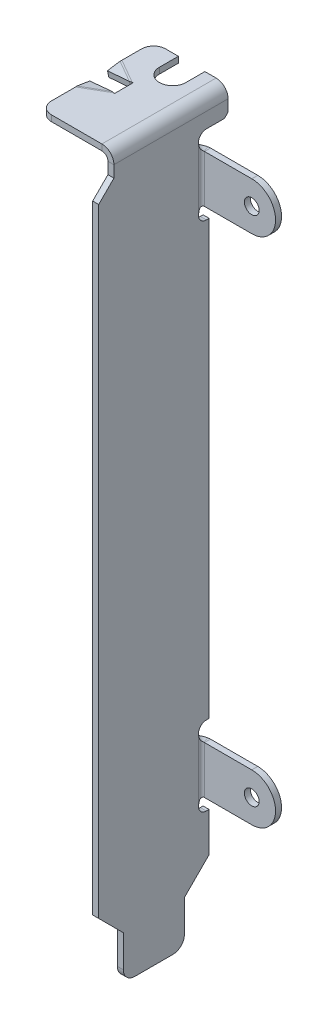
ISO-10303-21;
HEADER;
FILE_DESCRIPTION(('STEP AP214'),'2;1');
FILE_NAME('part.step','',(''),(''),'','','');
FILE_SCHEMA(('AUTOMOTIVE_DESIGN { 1 0 10303 214 1 1 1 1 }'));
ENDSEC;
DATA;
#1=APPLICATION_CONTEXT('core data for automotive mechanical design processes');
#2=APPLICATION_PROTOCOL_DEFINITION('international standard','automotive_design',2000,#1);
#3=PRODUCT_CONTEXT('',#1,'mechanical');
#4=PRODUCT('Part','Part','',(#3));
#5=PRODUCT_RELATED_PRODUCT_CATEGORY('part','',(#4));
#6=PRODUCT_DEFINITION_FORMATION('','',#4);
#7=PRODUCT_DEFINITION_CONTEXT('part definition',#1,'design');
#8=PRODUCT_DEFINITION('design','',#6,#7);
#9=PRODUCT_DEFINITION_SHAPE('','',#8);
#10=(LENGTH_UNIT() NAMED_UNIT(*) SI_UNIT(.MILLI.,.METRE.));
#11=(NAMED_UNIT(*) PLANE_ANGLE_UNIT() SI_UNIT($,.RADIAN.));
#12=(NAMED_UNIT(*) SI_UNIT($,.STERADIAN.) SOLID_ANGLE_UNIT());
#13=UNCERTAINTY_MEASURE_WITH_UNIT(LENGTH_MEASURE(1.E-05),#10,'distance_accuracy_value','');
#14=(GEOMETRIC_REPRESENTATION_CONTEXT(3) GLOBAL_UNCERTAINTY_ASSIGNED_CONTEXT((#13)) GLOBAL_UNIT_ASSIGNED_CONTEXT((#10,
#11,#12)) REPRESENTATION_CONTEXT('',''));
#15=CARTESIAN_POINT('',(0.,0.,0.));
#16=DIRECTION('',(0.,0.,1.));
#17=DIRECTION('',(1.,0.,0.));
#18=AXIS2_PLACEMENT_3D('',#15,#16,#17);
#19=CARTESIAN_POINT('',(-11.43,120.02,10.67));
#20=DIRECTION('',(0.,0.,-1.));
#21=DIRECTION('',(1.,0.,0.));
#22=AXIS2_PLACEMENT_3D('',#19,#20,#21);
#23=PLANE('',#22);
#24=DIRECTION('',(1.,0.,0.));
#25=VECTOR('',#24,1.);
#26=CARTESIAN_POINT('',(-11.43,120.02,10.67));
#27=LINE('',#26,#25);
#28=CARTESIAN_POINT('',(-7.37753400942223,120.019999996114,10.67));
#29=VERTEX_POINT('',#28);
#30=CARTESIAN_POINT('',(-7.24,120.02,10.67));
#31=VERTEX_POINT('',#30);
#32=EDGE_CURVE('E733',#29,#31,#27,.T.);
#33=ORIENTED_EDGE('',*,*,#32,.F.);
#34=CARTESIAN_POINT('',(-7.37753400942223,121.019999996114,10.67));
#35=CARTESIAN_POINT('',(-7.37753400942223,120.019999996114,10.67));
#36=B_SPLINE_CURVE_WITH_KNOTS('',1,(#34,#35),.UNSPECIFIED.,.F.,.F.,(2,2),(0.,1.),.UNSPECIFIED.);
#37=CARTESIAN_POINT('',(-7.37753400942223,121.02,10.67));
#38=VERTEX_POINT('',#37);
#39=EDGE_CURVE('E12',#29,#38,#36,.F.);
#40=ORIENTED_EDGE('',*,*,#39,.T.);
#41=DIRECTION('',(1.,0.,0.));
#42=VECTOR('',#41,1.);
#43=CARTESIAN_POINT('',(0.,121.02,10.67));
#44=LINE('',#43,#42);
#45=CARTESIAN_POINT('',(-7.24,121.02,10.67));
#46=VERTEX_POINT('',#45);
#47=EDGE_CURVE('E737',#38,#46,#44,.T.);
#48=ORIENTED_EDGE('',*,*,#47,.T.);
#49=DIRECTION('',(0.,-1.,0.));
#50=VECTOR('',#49,1.);
#51=CARTESIAN_POINT('',(-7.24,120.02,10.67));
#52=LINE('',#51,#50);
#53=EDGE_CURVE('E739',#31,#46,#52,.F.);
#54=ORIENTED_EDGE('',*,*,#53,.F.);
#55=EDGE_LOOP('',(#33,#40,#48,#54));
#56=FACE_BOUND('',#55,.T.);
#57=ADVANCED_FACE('F100',(#56),#23,.T.);
#58=CARTESIAN_POINT('',(-11.43,120.02,21.59));
#59=DIRECTION('',(-1.,0.,0.));
#60=DIRECTION('',(0.,0.,1.));
#61=AXIS2_PLACEMENT_3D('',#58,#59,#60);
#62=PLANE('',#61);
#63=DIRECTION('',(0.,0.,-1.));
#64=VECTOR('',#63,1.);
#65=CARTESIAN_POINT('',(-11.43,121.02,21.59));
#66=LINE('',#65,#64);
#67=CARTESIAN_POINT('',(-11.43,121.02,17.05));
#68=VERTEX_POINT('',#67);
#69=CARTESIAN_POINT('',(-11.43,121.019999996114,13.0096923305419));
#70=VERTEX_POINT('',#69);
#71=EDGE_CURVE('E1307',#68,#70,#66,.T.);
#72=ORIENTED_EDGE('',*,*,#71,.T.);
#73=CARTESIAN_POINT('',(-11.43,120.019999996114,13.0096923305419));
#74=CARTESIAN_POINT('',(-11.43,121.019999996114,13.0096923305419));
#75=B_SPLINE_CURVE_WITH_KNOTS('',1,(#73,#74),.UNSPECIFIED.,.F.,.F.,(2,2),(0.,1.),.UNSPECIFIED.);
#76=CARTESIAN_POINT('',(-11.43,120.019999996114,13.0096923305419));
#77=VERTEX_POINT('',#76);
#78=EDGE_CURVE('E595',#70,#77,#75,.F.);
#79=ORIENTED_EDGE('',*,*,#78,.T.);
#80=DIRECTION('',(0.,0.,-1.));
#81=VECTOR('',#80,1.);
#82=CARTESIAN_POINT('',(-11.43,120.02,21.59));
#83=LINE('',#82,#81);
#84=CARTESIAN_POINT('',(-11.43,120.02,17.05));
#85=VERTEX_POINT('',#84);
#86=EDGE_CURVE('E1282',#85,#77,#83,.T.);
#87=ORIENTED_EDGE('',*,*,#86,.F.);
#88=DIRECTION('',(0.,-1.,0.));
#89=VECTOR('',#88,1.);
#90=CARTESIAN_POINT('',(-11.43,120.02,17.05));
#91=LINE('',#90,#89);
#92=EDGE_CURVE('E750',#85,#68,#91,.F.);
#93=ORIENTED_EDGE('',*,*,#92,.T.);
#94=EDGE_LOOP('',(#72,#79,#87,#93));
#95=FACE_BOUND('',#94,.T.);
#96=ADVANCED_FACE('F1318',(#95),#62,.T.);
#97=CARTESIAN_POINT('',(0.,120.02,21.59));
#98=DIRECTION('',(0.,-1.,0.));
#99=DIRECTION('',(0.,0.,-1.));
#100=AXIS2_PLACEMENT_3D('',#97,#98,#99);
#101=PLANE('',#100);
#102=ORIENTED_EDGE('',*,*,#86,.T.);
#103=DIRECTION('',(0.866025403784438,0.,-0.5));
#104=VECTOR('',#103,1.);
#105=CARTESIAN_POINT('',(-6.5728822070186,120.02,10.2054340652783));
#106=LINE('',#105,#104);
#107=EDGE_CURVE('E1753',#77,#29,#106,.T.);
#108=ORIENTED_EDGE('',*,*,#107,.T.);
#109=ORIENTED_EDGE('',*,*,#32,.T.);
#110=DIRECTION('',(0.,0.,-1.));
#111=VECTOR('',#110,1.);
#112=CARTESIAN_POINT('',(-7.24,120.02,7.62));
#113=LINE('',#112,#111);
#114=CARTESIAN_POINT('',(-7.24,120.02,7.62));
#115=VERTEX_POINT('',#114);
#116=EDGE_CURVE('E725',#31,#115,#113,.T.);
#117=ORIENTED_EDGE('',*,*,#116,.T.);
#118=DIRECTION('',(-1.,0.,0.));
#119=VECTOR('',#118,1.);
#120=CARTESIAN_POINT('',(-11.43,120.02,7.62));
#121=LINE('',#120,#119);
#122=CARTESIAN_POINT('',(-7.37753400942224,120.02,7.62));
#123=VERTEX_POINT('',#122);
#124=EDGE_CURVE('E734',#115,#123,#121,.T.);
#125=ORIENTED_EDGE('',*,*,#124,.T.);
#126=DIRECTION('',(0.866025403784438,0.,0.500000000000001));
#127=VECTOR('',#126,1.);
#128=CARTESIAN_POINT('',(4.20480394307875,120.02,14.3070659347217));
#129=LINE('',#128,#127);
#130=CARTESIAN_POINT('',(-11.43,120.020000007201,5.28030766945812));
#131=VERTEX_POINT('',#130);
#132=EDGE_CURVE('E1284',#131,#123,#129,.T.);
#133=ORIENTED_EDGE('',*,*,#132,.F.);
#134=CARTESIAN_POINT('',(-11.43,120.02,2.));
#135=VERTEX_POINT('',#134);
#136=EDGE_CURVE('E1279',#131,#135,#83,.T.);
#137=ORIENTED_EDGE('',*,*,#136,.T.);
#138=CARTESIAN_POINT('',(-9.43,120.02,2.));
#139=DIRECTION('',(0.,-1.,0.));
#140=DIRECTION('',(0.,0.,-1.));
#141=AXIS2_PLACEMENT_3D('',#138,#139,#140);
#142=CIRCLE('',#141,2.);
#143=CARTESIAN_POINT('',(-9.43,120.02,0.));
#144=VERTEX_POINT('',#143);
#145=EDGE_CURVE('E753',#135,#144,#142,.T.);
#146=ORIENTED_EDGE('',*,*,#145,.T.);
#147=DIRECTION('',(-1.,0.,0.));
#148=VECTOR('',#147,1.);
#149=CARTESIAN_POINT('',(0.,120.02,0.));
#150=LINE('',#149,#148);
#151=CARTESIAN_POINT('',(-7.29,120.02,0.));
#152=VERTEX_POINT('',#151);
#153=EDGE_CURVE('E1570',#152,#144,#150,.T.);
#154=ORIENTED_EDGE('',*,*,#153,.F.);
#155=DIRECTION('',(0.,0.,1.));
#156=VECTOR('',#155,1.);
#157=CARTESIAN_POINT('',(-7.29,120.02,3.175));
#158=LINE('',#157,#156);
#159=CARTESIAN_POINT('',(-7.29,120.02,3.175));
#160=VERTEX_POINT('',#159);
#161=EDGE_CURVE('E772',#152,#160,#158,.T.);
#162=ORIENTED_EDGE('',*,*,#161,.T.);
#163=CARTESIAN_POINT('',(-5.08,120.02,3.175));
#164=DIRECTION('',(0.,-1.,0.));
#165=DIRECTION('',(0.,0.,-1.));
#166=AXIS2_PLACEMENT_3D('',#163,#164,#165);
#167=CIRCLE('',#166,2.21);
#168=CARTESIAN_POINT('',(-2.87,120.02,3.175));
#169=VERTEX_POINT('',#168);
#170=EDGE_CURVE('E769',#160,#169,#167,.F.);
#171=ORIENTED_EDGE('',*,*,#170,.T.);
#172=DIRECTION('',(0.,0.,-1.));
#173=VECTOR('',#172,1.);
#174=CARTESIAN_POINT('',(-2.87,120.02,0.));
#175=LINE('',#174,#173);
#176=CARTESIAN_POINT('',(-2.87,120.02,0.));
#177=VERTEX_POINT('',#176);
#178=EDGE_CURVE('E764',#169,#177,#175,.T.);
#179=ORIENTED_EDGE('',*,*,#178,.T.);
#180=CARTESIAN_POINT('',(-1.,120.02,0.));
#181=VERTEX_POINT('',#180);
#182=EDGE_CURVE('E1571',#181,#177,#150,.T.);
#183=ORIENTED_EDGE('',*,*,#182,.F.);
#184=DIRECTION('',(0.,0.,-1.));
#185=VECTOR('',#184,1.);
#186=CARTESIAN_POINT('',(-1.,120.02,21.59));
#187=LINE('',#186,#185);
#188=CARTESIAN_POINT('',(-1.,120.02,19.05));
#189=VERTEX_POINT('',#188);
#190=EDGE_CURVE('E1283',#189,#181,#187,.T.);
#191=ORIENTED_EDGE('',*,*,#190,.F.);
#192=DIRECTION('',(1.,0.,0.));
#193=VECTOR('',#192,1.);
#194=CARTESIAN_POINT('',(0.,120.02,19.05));
#195=LINE('',#194,#193);
#196=CARTESIAN_POINT('',(-9.43,120.02,19.05));
#197=VERTEX_POINT('',#196);
#198=EDGE_CURVE('E1516',#197,#189,#195,.T.);
#199=ORIENTED_EDGE('',*,*,#198,.F.);
#200=CARTESIAN_POINT('',(-9.43,120.02,17.05));
#201=DIRECTION('',(0.,-1.,0.));
#202=DIRECTION('',(0.,0.,-1.));
#203=AXIS2_PLACEMENT_3D('',#200,#201,#202);
#204=CIRCLE('',#203,2.);
#205=EDGE_CURVE('E745',#197,#85,#204,.T.);
#206=ORIENTED_EDGE('',*,*,#205,.T.);
#207=EDGE_LOOP('',(#102,#108,#109,#117,#125,#133,#137,#146,#154,#162,#171,#179,#183,#191,#199,#206));
#208=FACE_BOUND('',#207,.T.);
#209=ADVANCED_FACE('F1319',(#208),#101,.T.);
#210=CARTESIAN_POINT('',(0.,121.02,21.59));
#211=DIRECTION('',(0.,-1.,0.));
#212=DIRECTION('',(0.,0.,-1.));
#213=AXIS2_PLACEMENT_3D('',#210,#211,#212);
#214=PLANE('',#213);
#215=DIRECTION('',(0.866025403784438,0.,-0.5));
#216=VECTOR('',#215,1.);
#217=CARTESIAN_POINT('',(-6.5728822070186,121.02,10.2054340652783));
#218=LINE('',#217,#216);
#219=EDGE_CURVE('E111',#70,#38,#218,.T.);
#220=ORIENTED_EDGE('',*,*,#219,.F.);
#221=ORIENTED_EDGE('',*,*,#71,.F.);
#222=CARTESIAN_POINT('',(-9.43,121.02,17.05));
#223=DIRECTION('',(0.,-1.,0.));
#224=DIRECTION('',(0.,0.,-1.));
#225=AXIS2_PLACEMENT_3D('',#222,#223,#224);
#226=CIRCLE('',#225,2.);
#227=CARTESIAN_POINT('',(-9.43,121.02,19.05));
#228=VERTEX_POINT('',#227);
#229=EDGE_CURVE('E748',#228,#68,#226,.T.);
#230=ORIENTED_EDGE('',*,*,#229,.F.);
#231=DIRECTION('',(1.,0.,0.));
#232=VECTOR('',#231,1.);
#233=CARTESIAN_POINT('',(0.,121.02,19.05));
#234=LINE('',#233,#232);
#235=CARTESIAN_POINT('',(-1.,121.02,19.05));
#236=VERTEX_POINT('',#235);
#237=EDGE_CURVE('E1518',#228,#236,#234,.T.);
#238=ORIENTED_EDGE('',*,*,#237,.T.);
#239=DIRECTION('',(0.,0.,-1.));
#240=VECTOR('',#239,1.);
#241=CARTESIAN_POINT('',(-1.,121.02,21.59));
#242=LINE('',#241,#240);
#243=CARTESIAN_POINT('',(-1.,121.02,0.));
#244=VERTEX_POINT('',#243);
#245=EDGE_CURVE('E1590',#236,#244,#242,.T.);
#246=ORIENTED_EDGE('',*,*,#245,.T.);
#247=DIRECTION('',(1.,0.,0.));
#248=VECTOR('',#247,1.);
#249=CARTESIAN_POINT('',(0.,121.02,0.));
#250=LINE('',#249,#248);
#251=CARTESIAN_POINT('',(-2.87,121.02,0.));
#252=VERTEX_POINT('',#251);
#253=EDGE_CURVE('E1567',#244,#252,#250,.F.);
#254=ORIENTED_EDGE('',*,*,#253,.T.);
#255=DIRECTION('',(0.,0.,-1.));
#256=VECTOR('',#255,1.);
#257=CARTESIAN_POINT('',(-2.87,121.02,21.59));
#258=LINE('',#257,#256);
#259=CARTESIAN_POINT('',(-2.87,121.02,3.175));
#260=VERTEX_POINT('',#259);
#261=EDGE_CURVE('E775',#260,#252,#258,.T.);
#262=ORIENTED_EDGE('',*,*,#261,.F.);
#263=CARTESIAN_POINT('',(-5.08,121.02,3.175));
#264=DIRECTION('',(0.,-1.,0.));
#265=DIRECTION('',(0.,0.,-1.));
#266=AXIS2_PLACEMENT_3D('',#263,#264,#265);
#267=CIRCLE('',#266,2.21);
#268=CARTESIAN_POINT('',(-7.29,121.02,3.175));
#269=VERTEX_POINT('',#268);
#270=EDGE_CURVE('E779',#269,#260,#267,.F.);
#271=ORIENTED_EDGE('',*,*,#270,.F.);
#272=DIRECTION('',(0.,0.,-1.));
#273=VECTOR('',#272,1.);
#274=CARTESIAN_POINT('',(-7.29,121.02,21.59));
#275=LINE('',#274,#273);
#276=CARTESIAN_POINT('',(-7.29,121.02,0.));
#277=VERTEX_POINT('',#276);
#278=EDGE_CURVE('E776',#277,#269,#275,.F.);
#279=ORIENTED_EDGE('',*,*,#278,.F.);
#280=CARTESIAN_POINT('',(-9.43,121.02,0.));
#281=VERTEX_POINT('',#280);
#282=EDGE_CURVE('E1564',#277,#281,#250,.F.);
#283=ORIENTED_EDGE('',*,*,#282,.T.);
#284=CARTESIAN_POINT('',(-9.43,121.02,2.));
#285=DIRECTION('',(0.,-1.,0.));
#286=DIRECTION('',(0.,0.,-1.));
#287=AXIS2_PLACEMENT_3D('',#284,#285,#286);
#288=CIRCLE('',#287,2.);
#289=CARTESIAN_POINT('',(-11.43,121.02,2.));
#290=VERTEX_POINT('',#289);
#291=EDGE_CURVE('E758',#290,#281,#288,.T.);
#292=ORIENTED_EDGE('',*,*,#291,.F.);
#293=CARTESIAN_POINT('',(-11.43,121.02,5.28030766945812));
#294=VERTEX_POINT('',#293);
#295=EDGE_CURVE('E125',#294,#290,#66,.T.);
#296=ORIENTED_EDGE('',*,*,#295,.F.);
#297=DIRECTION('',(0.866025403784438,0.,0.500000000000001));
#298=VECTOR('',#297,1.);
#299=CARTESIAN_POINT('',(4.20480394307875,121.02,14.3070659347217));
#300=LINE('',#299,#298);
#301=CARTESIAN_POINT('',(-7.37753400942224,121.02,7.62));
#302=VERTEX_POINT('',#301);
#303=EDGE_CURVE('E1327',#294,#302,#300,.T.);
#304=ORIENTED_EDGE('',*,*,#303,.T.);
#305=DIRECTION('',(1.,0.,0.));
#306=VECTOR('',#305,1.);
#307=CARTESIAN_POINT('',(0.,121.02,7.62));
#308=LINE('',#307,#306);
#309=CARTESIAN_POINT('',(-7.24,121.02,7.62));
#310=VERTEX_POINT('',#309);
#311=EDGE_CURVE('E738',#310,#302,#308,.F.);
#312=ORIENTED_EDGE('',*,*,#311,.F.);
#313=DIRECTION('',(0.,0.,-1.));
#314=VECTOR('',#313,1.);
#315=CARTESIAN_POINT('',(-7.24,121.02,21.59));
#316=LINE('',#315,#314);
#317=EDGE_CURVE('E735',#46,#310,#316,.T.);
#318=ORIENTED_EDGE('',*,*,#317,.F.);
#319=ORIENTED_EDGE('',*,*,#47,.F.);
#320=EDGE_LOOP('',(#220,#221,#230,#238,#246,#254,#262,#271,#279,#283,#292,#296,#304,#312,#318,#319));
#321=FACE_BOUND('',#320,.T.);
#322=ADVANCED_FACE('F1316',(#321),#214,.F.);
#323=CARTESIAN_POINT('',(-11.43,121.020000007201,5.28030766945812));
#324=CARTESIAN_POINT('',(-11.43,120.020000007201,5.28030766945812));
#325=B_SPLINE_CURVE_WITH_KNOTS('',1,(#323,#324),.UNSPECIFIED.,.F.,.F.,(2,2),(0.,1.),.UNSPECIFIED.);
#326=EDGE_CURVE('E1334',#294,#131,#325,.T.);
#327=ORIENTED_EDGE('',*,*,#326,.F.);
#328=ORIENTED_EDGE('',*,*,#295,.T.);
#329=DIRECTION('',(0.,-1.,0.));
#330=VECTOR('',#329,1.);
#331=CARTESIAN_POINT('',(-11.43,120.02,2.));
#332=LINE('',#331,#330);
#333=EDGE_CURVE('E761',#135,#290,#332,.F.);
#334=ORIENTED_EDGE('',*,*,#333,.F.);
#335=ORIENTED_EDGE('',*,*,#136,.F.);
#336=EDGE_LOOP('',(#327,#328,#334,#335));
#337=FACE_BOUND('',#336,.T.);
#338=ADVANCED_FACE('F1230',(#337),#62,.T.);
#339=CARTESIAN_POINT('',(-1.,119.02,0.));
#340=DIRECTION('',(0.,0.,-1.));
#341=DIRECTION('',(-1.,0.,0.));
#342=AXIS2_PLACEMENT_3D('',#339,#340,#341);
#343=PLANE('',#342);
#344=DIRECTION('',(0.,-1.,0.));
#345=VECTOR('',#344,1.);
#346=CARTESIAN_POINT('',(-9.43,120.02,0.));
#347=LINE('',#346,#345);
#348=EDGE_CURVE('E760',#144,#281,#347,.F.);
#349=ORIENTED_EDGE('',*,*,#348,.T.);
#350=ORIENTED_EDGE('',*,*,#282,.F.);
#351=DIRECTION('',(0.,-1.,0.));
#352=VECTOR('',#351,1.);
#353=CARTESIAN_POINT('',(-7.29,120.02,0.));
#354=LINE('',#353,#352);
#355=EDGE_CURVE('E782',#152,#277,#354,.F.);
#356=ORIENTED_EDGE('',*,*,#355,.F.);
#357=ORIENTED_EDGE('',*,*,#153,.T.);
#358=EDGE_LOOP('',(#349,#350,#356,#357));
#359=FACE_BOUND('',#358,.T.);
#360=ADVANCED_FACE('F1226',(#359),#343,.T.);
#361=ORIENTED_EDGE('',*,*,#182,.T.);
#362=DIRECTION('',(0.,-1.,0.));
#363=VECTOR('',#362,1.);
#364=CARTESIAN_POINT('',(-2.87,120.02,0.));
#365=LINE('',#364,#363);
#366=EDGE_CURVE('E778',#177,#252,#365,.F.);
#367=ORIENTED_EDGE('',*,*,#366,.T.);
#368=ORIENTED_EDGE('',*,*,#253,.F.);
#369=DIRECTION('',(0.,-1.,0.));
#370=VECTOR('',#369,1.);
#371=CARTESIAN_POINT('',(-1.,121.02,0.));
#372=LINE('',#371,#370);
#373=EDGE_CURVE('E1605',#244,#181,#372,.T.);
#374=ORIENTED_EDGE('',*,*,#373,.T.);
#375=EDGE_LOOP('',(#361,#367,#368,#374));
#376=FACE_BOUND('',#375,.T.);
#377=ADVANCED_FACE('F1229',(#376),#343,.T.);
#378=CARTESIAN_POINT('',(0.,29.78,3.63999999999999));
#379=DIRECTION('',(-1.,0.,0.));
#380=DIRECTION('',(0.,0.,1.));
#381=AXIS2_PLACEMENT_3D('',#378,#379,#380);
#382=CYLINDRICAL_SURFACE('',#381,1.29999999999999);
#383=CARTESIAN_POINT('',(1.,29.78,3.63999999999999));
#384=DIRECTION('',(-1.,0.,0.));
#385=DIRECTION('',(0.,0.,1.));
#386=AXIS2_PLACEMENT_3D('',#383,#384,#385);
#387=CIRCLE('',#386,1.29999999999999);
#388=CARTESIAN_POINT('',(1.,29.78,4.93999999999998));
#389=VERTEX_POINT('',#388);
#390=CARTESIAN_POINT('',(1.,31.08,3.63999999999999));
#391=VERTEX_POINT('',#390);
#392=EDGE_CURVE('E1449',#389,#391,#387,.T.);
#393=ORIENTED_EDGE('',*,*,#392,.F.);
#394=CARTESIAN_POINT('',(3.45796568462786E-09,29.78,4.93999999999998));
#395=CARTESIAN_POINT('',(1.00000000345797,29.78,4.93999999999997));
#396=B_SPLINE_CURVE_WITH_KNOTS('',1,(#394,#395),.UNSPECIFIED.,.F.,.F.,(2,2),(0.,1.),.UNSPECIFIED.);
#397=CARTESIAN_POINT('',(0.,29.78,4.93999999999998));
#398=VERTEX_POINT('',#397);
#399=EDGE_CURVE('E988',#389,#398,#396,.F.);
#400=ORIENTED_EDGE('',*,*,#399,.T.);
#401=CARTESIAN_POINT('',(0.,29.78,3.63999999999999));
#402=DIRECTION('',(-1.,0.,0.));
#403=DIRECTION('',(0.,0.,-1.));
#404=AXIS2_PLACEMENT_3D('',#401,#402,#403);
#405=CIRCLE('',#404,1.29999999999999);
#406=CARTESIAN_POINT('',(0.,31.08,3.63999999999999));
#407=VERTEX_POINT('',#406);
#408=EDGE_CURVE('E1268',#398,#407,#405,.T.);
#409=ORIENTED_EDGE('',*,*,#408,.T.);
#410=DIRECTION('',(-1.,0.,0.));
#411=VECTOR('',#410,1.);
#412=CARTESIAN_POINT('',(0.,31.08,3.63999999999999));
#413=LINE('',#412,#411);
#414=EDGE_CURVE('E1465',#407,#391,#413,.F.);
#415=ORIENTED_EDGE('',*,*,#414,.T.);
#416=EDGE_LOOP('',(#393,#400,#409,#415));
#417=FACE_BOUND('',#416,.T.);
#418=ADVANCED_FACE('F1254',(#417),#382,.F.);
#419=CARTESIAN_POINT('',(0.,0.,21.59));
#420=DIRECTION('',(-1.,0.,0.));
#421=DIRECTION('',(0.,0.,1.));
#422=AXIS2_PLACEMENT_3D('',#419,#420,#421);
#423=PLANE('',#422);
#424=ORIENTED_EDGE('',*,*,#408,.F.);
#425=DIRECTION('',(0.,-1.,0.));
#426=VECTOR('',#425,1.);
#427=CARTESIAN_POINT('',(0.,0.,4.93999999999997));
#428=LINE('',#427,#426);
#429=CARTESIAN_POINT('',(3.45796568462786E-09,19.24,4.93999999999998));
#430=VERTEX_POINT('',#429);
#431=EDGE_CURVE('E1422',#398,#430,#428,.T.);
#432=ORIENTED_EDGE('',*,*,#431,.T.);
#433=CARTESIAN_POINT('',(0.,19.24,3.63999999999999));
#434=DIRECTION('',(-1.,0.,0.));
#435=DIRECTION('',(0.,0.,1.));
#436=AXIS2_PLACEMENT_3D('',#433,#434,#435);
#437=CIRCLE('',#436,1.29999999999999);
#438=CARTESIAN_POINT('',(0.,17.94,3.63999999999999));
#439=VERTEX_POINT('',#438);
#440=EDGE_CURVE('E1416',#439,#430,#437,.T.);
#441=ORIENTED_EDGE('',*,*,#440,.F.);
#442=DIRECTION('',(0.,0.,1.));
#443=VECTOR('',#442,1.);
#444=CARTESIAN_POINT('',(0.,17.94,21.59));
#445=LINE('',#444,#443);
#446=CARTESIAN_POINT('',(0.,17.94,3.17));
#447=VERTEX_POINT('',#446);
#448=EDGE_CURVE('E1418',#447,#439,#445,.T.);
#449=ORIENTED_EDGE('',*,*,#448,.F.);
#450=DIRECTION('',(0.,1.,0.));
#451=VECTOR('',#450,1.);
#452=CARTESIAN_POINT('',(0.,0.,3.17));
#453=LINE('',#452,#451);
#454=CARTESIAN_POINT('',(0.,11.39,3.17));
#455=VERTEX_POINT('',#454);
#456=EDGE_CURVE('E1475',#455,#447,#453,.T.);
#457=ORIENTED_EDGE('',*,*,#456,.F.);
#458=DIRECTION('',(0.,0.707106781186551,-0.707106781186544));
#459=VECTOR('',#458,1.);
#460=CARTESIAN_POINT('',(0.,-3.51500000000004,18.0749999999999));
#461=LINE('',#460,#459);
#462=CARTESIAN_POINT('',(0.,7.27,7.29));
#463=VERTEX_POINT('',#462);
#464=EDGE_CURVE('E1472',#463,#455,#461,.T.);
#465=ORIENTED_EDGE('',*,*,#464,.F.);
#466=DIRECTION('',(0.,1.,0.));
#467=VECTOR('',#466,1.);
#468=CARTESIAN_POINT('',(0.,0.,7.29));
#469=LINE('',#468,#467);
#470=CARTESIAN_POINT('',(0.,1.91,7.29));
#471=VERTEX_POINT('',#470);
#472=EDGE_CURVE('E1470',#471,#463,#469,.T.);
#473=ORIENTED_EDGE('',*,*,#472,.F.);
#474=CARTESIAN_POINT('',(0.,1.91,9.2));
#475=DIRECTION('',(-1.,0.,0.));
#476=DIRECTION('',(0.,0.,1.));
#477=AXIS2_PLACEMENT_3D('',#474,#475,#476);
#478=CIRCLE('',#477,1.91);
#479=CARTESIAN_POINT('',(0.,0.,9.2));
#480=VERTEX_POINT('',#479);
#481=EDGE_CURVE('E1468',#480,#471,#478,.F.);
#482=ORIENTED_EDGE('',*,*,#481,.F.);
#483=DIRECTION('',(0.,0.,-1.));
#484=VECTOR('',#483,1.);
#485=CARTESIAN_POINT('',(0.,0.,21.59));
#486=LINE('',#485,#484);
#487=CARTESIAN_POINT('',(0.,0.,15.56));
#488=VERTEX_POINT('',#487);
#489=EDGE_CURVE('E1598',#488,#480,#486,.T.);
#490=ORIENTED_EDGE('',*,*,#489,.F.);
#491=CARTESIAN_POINT('',(0.,1.91,15.56));
#492=DIRECTION('',(-1.,0.,0.));
#493=DIRECTION('',(0.,0.,1.));
#494=AXIS2_PLACEMENT_3D('',#491,#492,#493);
#495=CIRCLE('',#494,1.91);
#496=CARTESIAN_POINT('',(0.,1.91,17.47));
#497=VERTEX_POINT('',#496);
#498=EDGE_CURVE('E1542',#497,#488,#495,.F.);
#499=ORIENTED_EDGE('',*,*,#498,.F.);
#500=DIRECTION('',(0.,-1.,0.));
#501=VECTOR('',#500,1.);
#502=CARTESIAN_POINT('',(0.,0.,17.47));
#503=LINE('',#502,#501);
#504=CARTESIAN_POINT('',(0.,7.27,17.47));
#505=VERTEX_POINT('',#504);
#506=EDGE_CURVE('E1539',#505,#497,#503,.T.);
#507=ORIENTED_EDGE('',*,*,#506,.F.);
#508=DIRECTION('',(0.,-0.707106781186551,-0.707106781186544));
#509=VECTOR('',#508,1.);
#510=CARTESIAN_POINT('',(0.,5.69499999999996,15.895));
#511=LINE('',#510,#509);
#512=CARTESIAN_POINT('',(0.,11.39,21.59));
#513=VERTEX_POINT('',#512);
#514=EDGE_CURVE('E1544',#513,#505,#511,.T.);
#515=ORIENTED_EDGE('',*,*,#514,.F.);
#516=DIRECTION('',(0.,1.,0.));
#517=VECTOR('',#516,1.);
#518=CARTESIAN_POINT('',(0.,0.,21.59));
#519=LINE('',#518,#517);
#520=CARTESIAN_POINT('',(0.,114.54,21.59));
#521=VERTEX_POINT('',#520);
#522=EDGE_CURVE('E1584',#513,#521,#519,.T.);
#523=ORIENTED_EDGE('',*,*,#522,.T.);
#524=DIRECTION('',(0.,-0.707106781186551,0.707106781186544));
#525=VECTOR('',#524,1.);
#526=CARTESIAN_POINT('',(0.,57.2699999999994,78.86));
#527=LINE('',#526,#525);
#528=CARTESIAN_POINT('',(0.,117.08,19.05));
#529=VERTEX_POINT('',#528);
#530=EDGE_CURVE('E1525',#529,#521,#527,.T.);
#531=ORIENTED_EDGE('',*,*,#530,.F.);
#532=DIRECTION('',(0.,-1.,0.));
#533=VECTOR('',#532,1.);
#534=CARTESIAN_POINT('',(0.,0.,19.05));
#535=LINE('',#534,#533);
#536=CARTESIAN_POINT('',(0.,119.02,19.05));
#537=VERTEX_POINT('',#536);
#538=EDGE_CURVE('E1523',#537,#529,#535,.T.);
#539=ORIENTED_EDGE('',*,*,#538,.F.);
#540=DIRECTION('',(0.,0.,-1.));
#541=VECTOR('',#540,1.);
#542=CARTESIAN_POINT('',(0.,119.02,21.59));
#543=LINE('',#542,#541);
#544=CARTESIAN_POINT('',(0.,119.02,0.));
#545=VERTEX_POINT('',#544);
#546=EDGE_CURVE('E1601',#537,#545,#543,.T.);
#547=ORIENTED_EDGE('',*,*,#546,.T.);
#548=DIRECTION('',(0.,1.,0.));
#549=VECTOR('',#548,1.);
#550=CARTESIAN_POINT('',(0.,0.,0.));
#551=LINE('',#550,#549);
#552=CARTESIAN_POINT('',(0.,117.1,0.));
#553=VERTEX_POINT('',#552);
#554=EDGE_CURVE('E1577',#553,#545,#551,.T.);
#555=ORIENTED_EDGE('',*,*,#554,.F.);
#556=DIRECTION('',(0.,0.707106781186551,-0.707106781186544));
#557=VECTOR('',#556,1.);
#558=CARTESIAN_POINT('',(0.,47.7549999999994,69.3449999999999));
#559=LINE('',#558,#557);
#560=CARTESIAN_POINT('',(0.,116.48,0.620000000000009));
#561=VERTEX_POINT('',#560);
#562=EDGE_CURVE('E1478',#561,#553,#559,.T.);
#563=ORIENTED_EDGE('',*,*,#562,.F.);
#564=DIRECTION('',(0.,0.,-1.));
#565=VECTOR('',#564,1.);
#566=CARTESIAN_POINT('',(0.,116.48,-1.83));
#567=LINE('',#566,#565);
#568=CARTESIAN_POINT('',(0.,116.48,3.64));
#569=VERTEX_POINT('',#568);
#570=EDGE_CURVE('E1396',#569,#561,#567,.T.);
#571=ORIENTED_EDGE('',*,*,#570,.F.);
#572=CARTESIAN_POINT('',(0.,115.18,3.64));
#573=DIRECTION('',(-1.,0.,0.));
#574=DIRECTION('',(0.,0.,-1.));
#575=AXIS2_PLACEMENT_3D('',#572,#573,#574);
#576=CIRCLE('',#575,1.29999999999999);
#577=CARTESIAN_POINT('',(0.,115.18,4.93999999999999));
#578=VERTEX_POINT('',#577);
#579=EDGE_CURVE('E1406',#578,#569,#576,.T.);
#580=ORIENTED_EDGE('',*,*,#579,.F.);
#581=DIRECTION('',(0.,1.,0.));
#582=VECTOR('',#581,1.);
#583=CARTESIAN_POINT('',(0.,0.,4.93999999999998));
#584=LINE('',#583,#582);
#585=CARTESIAN_POINT('',(3.45796568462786E-09,104.64,4.93999999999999));
#586=VERTEX_POINT('',#585);
#587=EDGE_CURVE('E1611',#586,#578,#584,.T.);
#588=ORIENTED_EDGE('',*,*,#587,.F.);
#589=CARTESIAN_POINT('',(0.,104.64,3.64));
#590=DIRECTION('',(-1.,0.,0.));
#591=DIRECTION('',(0.,0.,1.));
#592=AXIS2_PLACEMENT_3D('',#589,#590,#591);
#593=CIRCLE('',#592,1.29999999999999);
#594=CARTESIAN_POINT('',(0.,103.34,3.64));
#595=VERTEX_POINT('',#594);
#596=EDGE_CURVE('E1612',#595,#586,#593,.T.);
#597=ORIENTED_EDGE('',*,*,#596,.F.);
#598=DIRECTION('',(0.,0.,1.));
#599=VECTOR('',#598,1.);
#600=CARTESIAN_POINT('',(0.,103.34,-1.83));
#601=LINE('',#600,#599);
#602=CARTESIAN_POINT('',(0.,103.34,3.17));
#603=VERTEX_POINT('',#602);
#604=EDGE_CURVE('E1147',#603,#595,#601,.T.);
#605=ORIENTED_EDGE('',*,*,#604,.F.);
#606=CARTESIAN_POINT('',(0.,31.08,3.17));
#607=VERTEX_POINT('',#606);
#608=EDGE_CURVE('E1474',#607,#603,#453,.T.);
#609=ORIENTED_EDGE('',*,*,#608,.F.);
#610=DIRECTION('',(0.,0.,-1.));
#611=VECTOR('',#610,1.);
#612=CARTESIAN_POINT('',(0.,31.08,-1.83000000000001));
#613=LINE('',#612,#611);
#614=EDGE_CURVE('E1275',#407,#607,#613,.T.);
#615=ORIENTED_EDGE('',*,*,#614,.F.);
#616=EDGE_LOOP('',(#424,#432,#441,#449,#457,#465,#473,#482,#490,#499,#507,#515,#523,#531,#539,
#547,#555,#563,#571,#580,#588,#597,#605,#609,#615));
#617=FACE_BOUND('',#616,.T.);
#618=ADVANCED_FACE('F1258',(#617),#423,.T.);
#619=CARTESIAN_POINT('',(0.,115.18,3.64));
#620=DIRECTION('',(-1.,0.,0.));
#621=DIRECTION('',(0.,0.,1.));
#622=AXIS2_PLACEMENT_3D('',#619,#620,#621);
#623=CYLINDRICAL_SURFACE('',#622,1.29999999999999);
#624=CARTESIAN_POINT('',(1.,115.18,3.64));
#625=DIRECTION('',(-1.,0.,0.));
#626=DIRECTION('',(0.,0.,1.));
#627=AXIS2_PLACEMENT_3D('',#624,#625,#626);
#628=CIRCLE('',#627,1.29999999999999);
#629=CARTESIAN_POINT('',(1.,115.18,4.93999999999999));
#630=VERTEX_POINT('',#629);
#631=CARTESIAN_POINT('',(1.,116.48,3.64));
#632=VERTEX_POINT('',#631);
#633=EDGE_CURVE('E1393',#630,#632,#628,.T.);
#634=ORIENTED_EDGE('',*,*,#633,.F.);
#635=CARTESIAN_POINT('',(3.45796568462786E-09,115.18,4.93999999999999));
#636=CARTESIAN_POINT('',(1.00000000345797,115.18,4.93999999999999));
#637=B_SPLINE_CURVE_WITH_KNOTS('',1,(#635,#636),.UNSPECIFIED.,.F.,.F.,(2,2),(0.,1.),.UNSPECIFIED.);
#638=EDGE_CURVE('E1384',#630,#578,#637,.F.);
#639=ORIENTED_EDGE('',*,*,#638,.T.);
#640=ORIENTED_EDGE('',*,*,#579,.T.);
#641=DIRECTION('',(-1.,0.,0.));
#642=VECTOR('',#641,1.);
#643=CARTESIAN_POINT('',(0.,116.48,3.64));
#644=LINE('',#643,#642);
#645=EDGE_CURVE('E1446',#569,#632,#644,.F.);
#646=ORIENTED_EDGE('',*,*,#645,.T.);
#647=EDGE_LOOP('',(#634,#639,#640,#646));
#648=FACE_BOUND('',#647,.T.);
#649=ADVANCED_FACE('F1359',(#648),#623,.F.);
#650=CARTESIAN_POINT('',(1.,0.,21.59));
#651=DIRECTION('',(-1.,0.,0.));
#652=DIRECTION('',(0.,0.,1.));
#653=AXIS2_PLACEMENT_3D('',#650,#651,#652);
#654=PLANE('',#653);
#655=DIRECTION('',(0.,-1.,0.));
#656=VECTOR('',#655,1.);
#657=CARTESIAN_POINT('',(1.,0.,4.93999999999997));
#658=LINE('',#657,#656);
#659=CARTESIAN_POINT('',(1.,19.24,4.93999999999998));
#660=VERTEX_POINT('',#659);
#661=EDGE_CURVE('E1435',#389,#660,#658,.T.);
#662=ORIENTED_EDGE('',*,*,#661,.F.);
#663=ORIENTED_EDGE('',*,*,#392,.T.);
#664=DIRECTION('',(0.,0.,1.));
#665=VECTOR('',#664,1.);
#666=CARTESIAN_POINT('',(1.,31.08,21.59));
#667=LINE('',#666,#665);
#668=CARTESIAN_POINT('',(1.,31.08,3.17));
#669=VERTEX_POINT('',#668);
#670=EDGE_CURVE('E1450',#391,#669,#667,.F.);
#671=ORIENTED_EDGE('',*,*,#670,.T.);
#672=DIRECTION('',(0.,1.,0.));
#673=VECTOR('',#672,1.);
#674=CARTESIAN_POINT('',(1.,0.,3.17));
#675=LINE('',#674,#673);
#676=CARTESIAN_POINT('',(1.,103.34,3.17));
#677=VERTEX_POINT('',#676);
#678=EDGE_CURVE('E1487',#669,#677,#675,.T.);
#679=ORIENTED_EDGE('',*,*,#678,.T.);
#680=DIRECTION('',(0.,0.,1.));
#681=VECTOR('',#680,1.);
#682=CARTESIAN_POINT('',(1.,103.34,21.59));
#683=LINE('',#682,#681);
#684=CARTESIAN_POINT('',(1.,103.34,3.64));
#685=VERTEX_POINT('',#684);
#686=EDGE_CURVE('E1390',#677,#685,#683,.T.);
#687=ORIENTED_EDGE('',*,*,#686,.T.);
#688=CARTESIAN_POINT('',(1.,104.64,3.64));
#689=DIRECTION('',(-1.,0.,0.));
#690=DIRECTION('',(0.,0.,1.));
#691=AXIS2_PLACEMENT_3D('',#688,#689,#690);
#692=CIRCLE('',#691,1.29999999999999);
#693=CARTESIAN_POINT('',(1.,104.64,4.93999999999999));
#694=VERTEX_POINT('',#693);
#695=EDGE_CURVE('E1387',#685,#694,#692,.T.);
#696=ORIENTED_EDGE('',*,*,#695,.T.);
#697=DIRECTION('',(0.,1.,0.));
#698=VECTOR('',#697,1.);
#699=CARTESIAN_POINT('',(1.,0.,4.93999999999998));
#700=LINE('',#699,#698);
#701=EDGE_CURVE('E1375',#694,#630,#700,.T.);
#702=ORIENTED_EDGE('',*,*,#701,.T.);
#703=ORIENTED_EDGE('',*,*,#633,.T.);
#704=DIRECTION('',(0.,0.,1.));
#705=VECTOR('',#704,1.);
#706=CARTESIAN_POINT('',(1.,116.48,21.59));
#707=LINE('',#706,#705);
#708=CARTESIAN_POINT('',(1.,116.48,0.620000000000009));
#709=VERTEX_POINT('',#708);
#710=EDGE_CURVE('E1395',#632,#709,#707,.F.);
#711=ORIENTED_EDGE('',*,*,#710,.T.);
#712=DIRECTION('',(0.,0.707106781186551,-0.707106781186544));
#713=VECTOR('',#712,1.);
#714=CARTESIAN_POINT('',(1.,47.7549999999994,69.3449999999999));
#715=LINE('',#714,#713);
#716=CARTESIAN_POINT('',(1.,117.1,0.));
#717=VERTEX_POINT('',#716);
#718=EDGE_CURVE('E1481',#709,#717,#715,.T.);
#719=ORIENTED_EDGE('',*,*,#718,.T.);
#720=DIRECTION('',(0.,1.,0.));
#721=VECTOR('',#720,1.);
#722=CARTESIAN_POINT('',(1.,0.,0.));
#723=LINE('',#722,#721);
#724=CARTESIAN_POINT('',(1.,119.02,0.));
#725=VERTEX_POINT('',#724);
#726=EDGE_CURVE('E1579',#717,#725,#723,.T.);
#727=ORIENTED_EDGE('',*,*,#726,.T.);
#728=DIRECTION('',(0.,0.,-1.));
#729=VECTOR('',#728,1.);
#730=CARTESIAN_POINT('',(1.,119.02,21.59));
#731=LINE('',#730,#729);
#732=CARTESIAN_POINT('',(1.,119.02,19.05));
#733=VERTEX_POINT('',#732);
#734=EDGE_CURVE('E1592',#733,#725,#731,.T.);
#735=ORIENTED_EDGE('',*,*,#734,.F.);
#736=DIRECTION('',(0.,1.,0.));
#737=VECTOR('',#736,1.);
#738=CARTESIAN_POINT('',(1.,0.,19.05));
#739=LINE('',#738,#737);
#740=CARTESIAN_POINT('',(1.,117.08,19.05));
#741=VERTEX_POINT('',#740);
#742=EDGE_CURVE('E1527',#733,#741,#739,.F.);
#743=ORIENTED_EDGE('',*,*,#742,.T.);
#744=DIRECTION('',(0.,-0.707106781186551,0.707106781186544));
#745=VECTOR('',#744,1.);
#746=CARTESIAN_POINT('',(1.,57.2699999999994,78.86));
#747=LINE('',#746,#745);
#748=CARTESIAN_POINT('',(1.,114.54,21.59));
#749=VERTEX_POINT('',#748);
#750=EDGE_CURVE('E1528',#741,#749,#747,.T.);
#751=ORIENTED_EDGE('',*,*,#750,.T.);
#752=DIRECTION('',(0.,1.,0.));
#753=VECTOR('',#752,1.);
#754=CARTESIAN_POINT('',(1.,0.,21.59));
#755=LINE('',#754,#753);
#756=CARTESIAN_POINT('',(1.,11.39,21.59));
#757=VERTEX_POINT('',#756);
#758=EDGE_CURVE('E1587',#757,#749,#755,.T.);
#759=ORIENTED_EDGE('',*,*,#758,.F.);
#760=DIRECTION('',(0.,-0.707106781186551,-0.707106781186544));
#761=VECTOR('',#760,1.);
#762=CARTESIAN_POINT('',(1.,5.69499999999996,15.895));
#763=LINE('',#762,#761);
#764=CARTESIAN_POINT('',(1.,7.27,17.47));
#765=VERTEX_POINT('',#764);
#766=EDGE_CURVE('E1550',#757,#765,#763,.T.);
#767=ORIENTED_EDGE('',*,*,#766,.T.);
#768=DIRECTION('',(0.,1.,0.));
#769=VECTOR('',#768,1.);
#770=CARTESIAN_POINT('',(1.,0.,17.47));
#771=LINE('',#770,#769);
#772=CARTESIAN_POINT('',(1.,1.91,17.47));
#773=VERTEX_POINT('',#772);
#774=EDGE_CURVE('E1546',#765,#773,#771,.F.);
#775=ORIENTED_EDGE('',*,*,#774,.T.);
#776=CARTESIAN_POINT('',(1.,1.91,15.56));
#777=DIRECTION('',(-1.,0.,0.));
#778=DIRECTION('',(0.,0.,1.));
#779=AXIS2_PLACEMENT_3D('',#776,#777,#778);
#780=CIRCLE('',#779,1.91);
#781=CARTESIAN_POINT('',(1.,0.,15.56));
#782=VERTEX_POINT('',#781);
#783=EDGE_CURVE('E1549',#773,#782,#780,.F.);
#784=ORIENTED_EDGE('',*,*,#783,.T.);
#785=DIRECTION('',(0.,0.,-1.));
#786=VECTOR('',#785,1.);
#787=CARTESIAN_POINT('',(1.,0.,21.59));
#788=LINE('',#787,#786);
#789=CARTESIAN_POINT('',(1.,0.,9.2));
#790=VERTEX_POINT('',#789);
#791=EDGE_CURVE('E1595',#782,#790,#788,.T.);
#792=ORIENTED_EDGE('',*,*,#791,.T.);
#793=CARTESIAN_POINT('',(1.,1.91,9.2));
#794=DIRECTION('',(-1.,0.,0.));
#795=DIRECTION('',(0.,0.,1.));
#796=AXIS2_PLACEMENT_3D('',#793,#794,#795);
#797=CIRCLE('',#796,1.91);
#798=CARTESIAN_POINT('',(1.,1.91,7.29));
#799=VERTEX_POINT('',#798);
#800=EDGE_CURVE('E1480',#790,#799,#797,.F.);
#801=ORIENTED_EDGE('',*,*,#800,.T.);
#802=DIRECTION('',(0.,1.,0.));
#803=VECTOR('',#802,1.);
#804=CARTESIAN_POINT('',(1.,0.,7.29));
#805=LINE('',#804,#803);
#806=CARTESIAN_POINT('',(1.,7.27,7.29));
#807=VERTEX_POINT('',#806);
#808=EDGE_CURVE('E1491',#799,#807,#805,.T.);
#809=ORIENTED_EDGE('',*,*,#808,.T.);
#810=DIRECTION('',(0.,0.707106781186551,-0.707106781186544));
#811=VECTOR('',#810,1.);
#812=CARTESIAN_POINT('',(1.,-3.51500000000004,18.0749999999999));
#813=LINE('',#812,#811);
#814=CARTESIAN_POINT('',(1.,11.39,3.17));
#815=VERTEX_POINT('',#814);
#816=EDGE_CURVE('E1488',#807,#815,#813,.T.);
#817=ORIENTED_EDGE('',*,*,#816,.T.);
#818=CARTESIAN_POINT('',(1.,17.94,3.17));
#819=VERTEX_POINT('',#818);
#820=EDGE_CURVE('E1484',#815,#819,#675,.T.);
#821=ORIENTED_EDGE('',*,*,#820,.T.);
#822=DIRECTION('',(0.,0.,1.));
#823=VECTOR('',#822,1.);
#824=CARTESIAN_POINT('',(1.,17.94,-1.83000000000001));
#825=LINE('',#824,#823);
#826=CARTESIAN_POINT('',(1.,17.94,3.63999999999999));
#827=VERTEX_POINT('',#826);
#828=EDGE_CURVE('E1419',#819,#827,#825,.T.);
#829=ORIENTED_EDGE('',*,*,#828,.T.);
#830=CARTESIAN_POINT('',(1.,19.24,3.63999999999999));
#831=DIRECTION('',(-1.,0.,0.));
#832=DIRECTION('',(0.,0.,1.));
#833=AXIS2_PLACEMENT_3D('',#830,#831,#832);
#834=CIRCLE('',#833,1.29999999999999);
#835=EDGE_CURVE('E1444',#827,#660,#834,.T.);
#836=ORIENTED_EDGE('',*,*,#835,.T.);
#837=EDGE_LOOP('',(#662,#663,#671,#679,#687,#696,#702,#703,#711,#719,#727,#735,#743,#751,#759,
#767,#775,#784,#792,#801,#809,#817,#821,#829,#836));
#838=FACE_BOUND('',#837,.T.);
#839=ADVANCED_FACE('F1356',(#838),#654,.F.);
#840=CARTESIAN_POINT('',(0.,0.,3.17));
#841=DIRECTION('',(0.,0.,1.));
#842=DIRECTION('',(0.,1.,0.));
#843=AXIS2_PLACEMENT_3D('',#840,#841,#842);
#844=PLANE('',#843);
#845=ORIENTED_EDGE('',*,*,#608,.T.);
#846=DIRECTION('',(-1.,0.,0.));
#847=VECTOR('',#846,1.);
#848=CARTESIAN_POINT('',(0.,103.34,3.17));
#849=LINE('',#848,#847);
#850=EDGE_CURVE('E1413',#603,#677,#849,.F.);
#851=ORIENTED_EDGE('',*,*,#850,.T.);
#852=ORIENTED_EDGE('',*,*,#678,.F.);
#853=DIRECTION('',(-1.,0.,0.));
#854=VECTOR('',#853,1.);
#855=CARTESIAN_POINT('',(0.,31.08,3.17));
#856=LINE('',#855,#854);
#857=EDGE_CURVE('E1455',#607,#669,#856,.F.);
#858=ORIENTED_EDGE('',*,*,#857,.F.);
#859=EDGE_LOOP('',(#845,#851,#852,#858));
#860=FACE_BOUND('',#859,.T.);
#861=ADVANCED_FACE('F1180',(#860),#844,.F.);
#862=CARTESIAN_POINT('',(0.,47.7549999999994,69.3449999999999));
#863=DIRECTION('',(0.,0.707106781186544,0.707106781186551));
#864=DIRECTION('',(0.,0.707106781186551,-0.707106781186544));
#865=AXIS2_PLACEMENT_3D('',#862,#863,#864);
#866=PLANE('',#865);
#867=ORIENTED_EDGE('',*,*,#718,.F.);
#868=DIRECTION('',(-1.,0.,0.));
#869=VECTOR('',#868,1.);
#870=CARTESIAN_POINT('',(0.,116.48,0.620000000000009));
#871=LINE('',#870,#869);
#872=EDGE_CURVE('E2720',#561,#709,#871,.F.);
#873=ORIENTED_EDGE('',*,*,#872,.F.);
#874=ORIENTED_EDGE('',*,*,#562,.T.);
#875=DIRECTION('',(-1.,0.,0.));
#876=VECTOR('',#875,1.);
#877=CARTESIAN_POINT('',(0.,117.1,0.));
#878=LINE('',#877,#876);
#879=EDGE_CURVE('E1496',#553,#717,#878,.F.);
#880=ORIENTED_EDGE('',*,*,#879,.T.);
#881=EDGE_LOOP('',(#867,#873,#874,#880));
#882=FACE_BOUND('',#881,.T.);
#883=ADVANCED_FACE('F1176',(#882),#866,.F.);
#884=ORIENTED_EDGE('',*,*,#456,.T.);
#885=DIRECTION('',(1.,0.,0.));
#886=VECTOR('',#885,1.);
#887=CARTESIAN_POINT('',(1.,17.94,3.17));
#888=LINE('',#887,#886);
#889=EDGE_CURVE('E2712',#819,#447,#888,.F.);
#890=ORIENTED_EDGE('',*,*,#889,.F.);
#891=ORIENTED_EDGE('',*,*,#820,.F.);
#892=DIRECTION('',(-1.,0.,0.));
#893=VECTOR('',#892,1.);
#894=CARTESIAN_POINT('',(0.,11.39,3.17));
#895=LINE('',#894,#893);
#896=EDGE_CURVE('E1499',#455,#815,#895,.F.);
#897=ORIENTED_EDGE('',*,*,#896,.F.);
#898=EDGE_LOOP('',(#884,#890,#891,#897));
#899=FACE_BOUND('',#898,.T.);
#900=ADVANCED_FACE('F1179',(#899),#844,.F.);
#901=CARTESIAN_POINT('',(-1.,121.02,0.));
#902=DIRECTION('',(0.,0.,-1.));
#903=DIRECTION('',(-1.,0.,0.));
#904=AXIS2_PLACEMENT_3D('',#901,#902,#903);
#905=PLANE('',#904);
#906=ORIENTED_EDGE('',*,*,#726,.F.);
#907=ORIENTED_EDGE('',*,*,#879,.F.);
#908=ORIENTED_EDGE('',*,*,#554,.T.);
#909=DIRECTION('',(1.,0.,0.));
#910=VECTOR('',#909,1.);
#911=CARTESIAN_POINT('',(0.,119.02,0.));
#912=LINE('',#911,#910);
#913=EDGE_CURVE('E1608',#545,#725,#912,.T.);
#914=ORIENTED_EDGE('',*,*,#913,.T.);
#915=EDGE_LOOP('',(#906,#907,#908,#914));
#916=FACE_BOUND('',#915,.T.);
#917=ADVANCED_FACE('F1184',(#916),#905,.T.);
#918=CARTESIAN_POINT('',(-1.,119.02,21.59));
#919=DIRECTION('',(0.,0.,-1.));
#920=DIRECTION('',(-1.,0.,0.));
#921=AXIS2_PLACEMENT_3D('',#918,#919,#920);
#922=PLANE('',#921);
#923=DIRECTION('',(-1.,0.,0.));
#924=VECTOR('',#923,1.);
#925=CARTESIAN_POINT('',(0.,114.54,21.59));
#926=LINE('',#925,#924);
#927=EDGE_CURVE('E1534',#521,#749,#926,.F.);
#928=ORIENTED_EDGE('',*,*,#927,.F.);
#929=ORIENTED_EDGE('',*,*,#522,.F.);
#930=DIRECTION('',(-1.,0.,0.));
#931=VECTOR('',#930,1.);
#932=CARTESIAN_POINT('',(0.,11.39,21.59));
#933=LINE('',#932,#931);
#934=EDGE_CURVE('E1559',#513,#757,#933,.F.);
#935=ORIENTED_EDGE('',*,*,#934,.T.);
#936=ORIENTED_EDGE('',*,*,#758,.T.);
#937=EDGE_LOOP('',(#928,#929,#935,#936));
#938=FACE_BOUND('',#937,.T.);
#939=ADVANCED_FACE('F1232',(#938),#922,.F.);
#940=CARTESIAN_POINT('',(-1.,119.02,21.59));
#941=DIRECTION('',(0.,0.,-1.));
#942=DIRECTION('',(-1.,0.,0.));
#943=AXIS2_PLACEMENT_3D('',#940,#941,#942);
#944=CYLINDRICAL_SURFACE('',#943,1.);
#945=ORIENTED_EDGE('',*,*,#546,.F.);
#946=CARTESIAN_POINT('',(-1.,119.02,19.05));
#947=DIRECTION('',(0.,0.,-1.));
#948=DIRECTION('',(-1.,0.,0.));
#949=AXIS2_PLACEMENT_3D('',#946,#947,#948);
#950=CIRCLE('',#949,1.);
#951=EDGE_CURVE('E1513',#189,#537,#950,.T.);
#952=ORIENTED_EDGE('',*,*,#951,.F.);
#953=ORIENTED_EDGE('',*,*,#190,.T.);
#954=CARTESIAN_POINT('',(-1.,119.02,0.));
#955=DIRECTION('',(0.,0.,-1.));
#956=DIRECTION('',(-1.,0.,0.));
#957=AXIS2_PLACEMENT_3D('',#954,#955,#956);
#958=CIRCLE('',#957,1.);
#959=EDGE_CURVE('E1574',#545,#181,#958,.F.);
#960=ORIENTED_EDGE('',*,*,#959,.F.);
#961=EDGE_LOOP('',(#945,#952,#953,#960));
#962=FACE_BOUND('',#961,.T.);
#963=ADVANCED_FACE('F1235',(#962),#944,.F.);
#964=CARTESIAN_POINT('',(-1.,119.02,21.59));
#965=DIRECTION('',(0.,0.,-1.));
#966=DIRECTION('',(-1.,0.,0.));
#967=AXIS2_PLACEMENT_3D('',#964,#965,#966);
#968=CYLINDRICAL_SURFACE('',#967,2.);
#969=CARTESIAN_POINT('',(-1.,119.02,19.05));
#970=DIRECTION('',(0.,0.,-1.));
#971=DIRECTION('',(-1.,0.,0.));
#972=AXIS2_PLACEMENT_3D('',#969,#970,#971);
#973=CIRCLE('',#972,2.);
#974=EDGE_CURVE('E1508',#236,#733,#973,.T.);
#975=ORIENTED_EDGE('',*,*,#974,.T.);
#976=ORIENTED_EDGE('',*,*,#734,.T.);
#977=CARTESIAN_POINT('',(-1.,119.02,0.));
#978=DIRECTION('',(0.,0.,1.));
#979=DIRECTION('',(1.,0.,0.));
#980=AXIS2_PLACEMENT_3D('',#977,#978,#979);
#981=CIRCLE('',#980,2.);
#982=EDGE_CURVE('E1581',#725,#244,#981,.T.);
#983=ORIENTED_EDGE('',*,*,#982,.T.);
#984=ORIENTED_EDGE('',*,*,#245,.F.);
#985=EDGE_LOOP('',(#975,#976,#983,#984));
#986=FACE_BOUND('',#985,.T.);
#987=ADVANCED_FACE('F1237',(#986),#968,.T.);
#988=CARTESIAN_POINT('',(1.,0.,21.59));
#989=DIRECTION('',(0.,-1.,0.));
#990=DIRECTION('',(0.,0.,-1.));
#991=AXIS2_PLACEMENT_3D('',#988,#989,#990);
#992=PLANE('',#991);
#993=DIRECTION('',(-1.,0.,0.));
#994=VECTOR('',#993,1.);
#995=CARTESIAN_POINT('',(0.,0.,9.2));
#996=LINE('',#995,#994);
#997=EDGE_CURVE('E1483',#480,#790,#996,.F.);
#998=ORIENTED_EDGE('',*,*,#997,.T.);
#999=ORIENTED_EDGE('',*,*,#791,.F.);
#1000=DIRECTION('',(-1.,0.,0.));
#1001=VECTOR('',#1000,1.);
#1002=CARTESIAN_POINT('',(0.,0.,15.56));
#1003=LINE('',#1002,#1001);
#1004=EDGE_CURVE('E1562',#488,#782,#1003,.F.);
#1005=ORIENTED_EDGE('',*,*,#1004,.F.);
#1006=ORIENTED_EDGE('',*,*,#489,.T.);
#1007=EDGE_LOOP('',(#998,#999,#1005,#1006));
#1008=FACE_BOUND('',#1007,.T.);
#1009=ADVANCED_FACE('F1240',(#1008),#992,.T.);
#1010=CARTESIAN_POINT('',(0.,119.02,0.));
#1011=DIRECTION('',(0.,0.,-1.));
#1012=DIRECTION('',(-1.,0.,0.));
#1013=AXIS2_PLACEMENT_3D('',#1010,#1011,#1012);
#1014=PLANE('',#1013);
#1015=ORIENTED_EDGE('',*,*,#913,.F.);
#1016=ORIENTED_EDGE('',*,*,#959,.T.);
#1017=ORIENTED_EDGE('',*,*,#373,.F.);
#1018=ORIENTED_EDGE('',*,*,#982,.F.);
#1019=EDGE_LOOP('',(#1015,#1016,#1017,#1018));
#1020=FACE_BOUND('',#1019,.T.);
#1021=ADVANCED_FACE('F1221',(#1020),#1014,.T.);
#1022=CARTESIAN_POINT('',(0.,5.69499999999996,15.895));
#1023=DIRECTION('',(0.,0.707106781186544,-0.707106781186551));
#1024=DIRECTION('',(0.,-0.707106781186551,-0.707106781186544));
#1025=AXIS2_PLACEMENT_3D('',#1022,#1023,#1024);
#1026=PLANE('',#1025);
#1027=ORIENTED_EDGE('',*,*,#934,.F.);
#1028=ORIENTED_EDGE('',*,*,#514,.T.);
#1029=DIRECTION('',(-1.,0.,0.));
#1030=VECTOR('',#1029,1.);
#1031=CARTESIAN_POINT('',(0.,7.27,17.47));
#1032=LINE('',#1031,#1030);
#1033=EDGE_CURVE('E1556',#505,#765,#1032,.F.);
#1034=ORIENTED_EDGE('',*,*,#1033,.T.);
#1035=ORIENTED_EDGE('',*,*,#766,.F.);
#1036=EDGE_LOOP('',(#1027,#1028,#1034,#1035));
#1037=FACE_BOUND('',#1036,.T.);
#1038=ADVANCED_FACE('F1217',(#1037),#1026,.F.);
#1039=CARTESIAN_POINT('',(0.,0.,17.47));
#1040=DIRECTION('',(0.,0.,-1.));
#1041=DIRECTION('',(0.,-1.,0.));
#1042=AXIS2_PLACEMENT_3D('',#1039,#1040,#1041);
#1043=PLANE('',#1042);
#1044=ORIENTED_EDGE('',*,*,#1033,.F.);
#1045=ORIENTED_EDGE('',*,*,#506,.T.);
#1046=DIRECTION('',(-1.,0.,0.));
#1047=VECTOR('',#1046,1.);
#1048=CARTESIAN_POINT('',(0.,1.91,17.47));
#1049=LINE('',#1048,#1047);
#1050=EDGE_CURVE('E1553',#497,#773,#1049,.F.);
#1051=ORIENTED_EDGE('',*,*,#1050,.T.);
#1052=ORIENTED_EDGE('',*,*,#774,.F.);
#1053=EDGE_LOOP('',(#1044,#1045,#1051,#1052));
#1054=FACE_BOUND('',#1053,.T.);
#1055=ADVANCED_FACE('F1214',(#1054),#1043,.F.);
#1056=CARTESIAN_POINT('',(0.,1.91,15.56));
#1057=DIRECTION('',(-1.,0.,0.));
#1058=DIRECTION('',(0.,0.,1.));
#1059=AXIS2_PLACEMENT_3D('',#1056,#1057,#1058);
#1060=CYLINDRICAL_SURFACE('',#1059,1.91);
#1061=ORIENTED_EDGE('',*,*,#498,.T.);
#1062=ORIENTED_EDGE('',*,*,#1004,.T.);
#1063=ORIENTED_EDGE('',*,*,#783,.F.);
#1064=ORIENTED_EDGE('',*,*,#1050,.F.);
#1065=EDGE_LOOP('',(#1061,#1062,#1063,#1064));
#1066=FACE_BOUND('',#1065,.T.);
#1067=ADVANCED_FACE('F1209',(#1066),#1060,.T.);
#1068=CARTESIAN_POINT('',(0.,57.2699999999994,78.86));
#1069=DIRECTION('',(0.,-0.707106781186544,-0.707106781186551));
#1070=DIRECTION('',(0.,-0.707106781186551,0.707106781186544));
#1071=AXIS2_PLACEMENT_3D('',#1068,#1069,#1070);
#1072=PLANE('',#1071);
#1073=DIRECTION('',(-1.,0.,0.));
#1074=VECTOR('',#1073,1.);
#1075=CARTESIAN_POINT('',(0.,117.08,19.05));
#1076=LINE('',#1075,#1074);
#1077=EDGE_CURVE('E1536',#529,#741,#1076,.F.);
#1078=ORIENTED_EDGE('',*,*,#1077,.F.);
#1079=ORIENTED_EDGE('',*,*,#530,.T.);
#1080=ORIENTED_EDGE('',*,*,#927,.T.);
#1081=ORIENTED_EDGE('',*,*,#750,.F.);
#1082=EDGE_LOOP('',(#1078,#1079,#1080,#1081));
#1083=FACE_BOUND('',#1082,.T.);
#1084=ADVANCED_FACE('F1206',(#1083),#1072,.F.);
#1085=CARTESIAN_POINT('',(0.,0.,19.05));
#1086=DIRECTION('',(0.,0.,-1.));
#1087=DIRECTION('',(0.,-1.,0.));
#1088=AXIS2_PLACEMENT_3D('',#1085,#1086,#1087);
#1089=PLANE('',#1088);
#1090=ORIENTED_EDGE('',*,*,#538,.T.);
#1091=ORIENTED_EDGE('',*,*,#1077,.T.);
#1092=ORIENTED_EDGE('',*,*,#742,.F.);
#1093=DIRECTION('',(-1.,0.,0.));
#1094=VECTOR('',#1093,1.);
#1095=CARTESIAN_POINT('',(0.,119.02,19.05));
#1096=LINE('',#1095,#1094);
#1097=EDGE_CURVE('E1531',#537,#733,#1096,.F.);
#1098=ORIENTED_EDGE('',*,*,#1097,.F.);
#1099=EDGE_LOOP('',(#1090,#1091,#1092,#1098));
#1100=FACE_BOUND('',#1099,.T.);
#1101=ADVANCED_FACE('F1204',(#1100),#1089,.F.);
#1102=CARTESIAN_POINT('',(0.,120.02,19.05));
#1103=DIRECTION('',(0.,0.,-1.));
#1104=DIRECTION('',(1.,0.,0.));
#1105=AXIS2_PLACEMENT_3D('',#1102,#1103,#1104);
#1106=PLANE('',#1105);
#1107=DIRECTION('',(0.,-1.,0.));
#1108=VECTOR('',#1107,1.);
#1109=CARTESIAN_POINT('',(-9.43,120.02,19.05));
#1110=LINE('',#1109,#1108);
#1111=EDGE_CURVE('E751',#197,#228,#1110,.F.);
#1112=ORIENTED_EDGE('',*,*,#1111,.F.);
#1113=ORIENTED_EDGE('',*,*,#198,.T.);
#1114=DIRECTION('',(0.,-1.,0.));
#1115=VECTOR('',#1114,1.);
#1116=CARTESIAN_POINT('',(-1.,120.02,19.05));
#1117=LINE('',#1116,#1115);
#1118=EDGE_CURVE('E1520',#189,#236,#1117,.F.);
#1119=ORIENTED_EDGE('',*,*,#1118,.T.);
#1120=ORIENTED_EDGE('',*,*,#237,.F.);
#1121=EDGE_LOOP('',(#1112,#1113,#1119,#1120));
#1122=FACE_BOUND('',#1121,.T.);
#1123=ADVANCED_FACE('F1200',(#1122),#1106,.F.);
#1124=CARTESIAN_POINT('',(-1.,119.02,19.05));
#1125=DIRECTION('',(0.,0.,1.));
#1126=DIRECTION('',(1.,0.,0.));
#1127=AXIS2_PLACEMENT_3D('',#1124,#1125,#1126);
#1128=PLANE('',#1127);
#1129=ORIENTED_EDGE('',*,*,#1097,.T.);
#1130=ORIENTED_EDGE('',*,*,#974,.F.);
#1131=ORIENTED_EDGE('',*,*,#1118,.F.);
#1132=ORIENTED_EDGE('',*,*,#951,.T.);
#1133=EDGE_LOOP('',(#1129,#1130,#1131,#1132));
#1134=FACE_BOUND('',#1133,.T.);
#1135=ADVANCED_FACE('F1193',(#1134),#1128,.T.);
#1136=CARTESIAN_POINT('',(0.,0.,7.29));
#1137=DIRECTION('',(0.,0.,1.));
#1138=DIRECTION('',(0.,1.,0.));
#1139=AXIS2_PLACEMENT_3D('',#1136,#1137,#1138);
#1140=PLANE('',#1139);
#1141=DIRECTION('',(-1.,0.,0.));
#1142=VECTOR('',#1141,1.);
#1143=CARTESIAN_POINT('',(0.,1.91,7.29));
#1144=LINE('',#1143,#1142);
#1145=EDGE_CURVE('E1505',#471,#799,#1144,.F.);
#1146=ORIENTED_EDGE('',*,*,#1145,.F.);
#1147=ORIENTED_EDGE('',*,*,#472,.T.);
#1148=DIRECTION('',(-1.,0.,0.));
#1149=VECTOR('',#1148,1.);
#1150=CARTESIAN_POINT('',(0.,7.27,7.29));
#1151=LINE('',#1150,#1149);
#1152=EDGE_CURVE('E1502',#463,#807,#1151,.F.);
#1153=ORIENTED_EDGE('',*,*,#1152,.T.);
#1154=ORIENTED_EDGE('',*,*,#808,.F.);
#1155=EDGE_LOOP('',(#1146,#1147,#1153,#1154));
#1156=FACE_BOUND('',#1155,.T.);
#1157=ADVANCED_FACE('F1189',(#1156),#1140,.F.);
#1158=CARTESIAN_POINT('',(0.,-3.51500000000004,18.0749999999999));
#1159=DIRECTION('',(0.,0.707106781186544,0.707106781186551));
#1160=DIRECTION('',(0.,0.707106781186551,-0.707106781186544));
#1161=AXIS2_PLACEMENT_3D('',#1158,#1159,#1160);
#1162=PLANE('',#1161);
#1163=ORIENTED_EDGE('',*,*,#1152,.F.);
#1164=ORIENTED_EDGE('',*,*,#464,.T.);
#1165=ORIENTED_EDGE('',*,*,#896,.T.);
#1166=ORIENTED_EDGE('',*,*,#816,.F.);
#1167=EDGE_LOOP('',(#1163,#1164,#1165,#1166));
#1168=FACE_BOUND('',#1167,.T.);
#1169=ADVANCED_FACE('F1186',(#1168),#1162,.F.);
#1170=CARTESIAN_POINT('',(0.,1.91,9.2));
#1171=DIRECTION('',(-1.,0.,0.));
#1172=DIRECTION('',(0.,0.,1.));
#1173=AXIS2_PLACEMENT_3D('',#1170,#1171,#1172);
#1174=CYLINDRICAL_SURFACE('',#1173,1.91);
#1175=ORIENTED_EDGE('',*,*,#481,.T.);
#1176=ORIENTED_EDGE('',*,*,#1145,.T.);
#1177=ORIENTED_EDGE('',*,*,#800,.F.);
#1178=ORIENTED_EDGE('',*,*,#997,.F.);
#1179=EDGE_LOOP('',(#1175,#1176,#1177,#1178));
#1180=FACE_BOUND('',#1179,.T.);
#1181=ADVANCED_FACE('F1174',(#1180),#1174,.T.);
#1182=CARTESIAN_POINT('',(0.,31.08,-1.83000000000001));
#1183=DIRECTION('',(0.,1.,0.));
#1184=DIRECTION('',(0.,0.,-1.));
#1185=AXIS2_PLACEMENT_3D('',#1182,#1183,#1184);
#1186=PLANE('',#1185);
#1187=ORIENTED_EDGE('',*,*,#414,.F.);
#1188=ORIENTED_EDGE('',*,*,#614,.T.);
#1189=ORIENTED_EDGE('',*,*,#857,.T.);
#1190=ORIENTED_EDGE('',*,*,#670,.F.);
#1191=EDGE_LOOP('',(#1187,#1188,#1189,#1190));
#1192=FACE_BOUND('',#1191,.T.);
#1193=ADVANCED_FACE('F1171',(#1192),#1186,.F.);
#1194=CARTESIAN_POINT('',(1.,19.24,3.63999999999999));
#1195=DIRECTION('',(-1.,0.,0.));
#1196=DIRECTION('',(0.,0.,1.));
#1197=AXIS2_PLACEMENT_3D('',#1194,#1195,#1196);
#1198=CYLINDRICAL_SURFACE('',#1197,1.29999999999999);
#1199=CARTESIAN_POINT('',(1.00000000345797,19.24,4.93999999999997));
#1200=CARTESIAN_POINT('',(3.45796568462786E-09,19.24,4.93999999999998));
#1201=B_SPLINE_CURVE_WITH_KNOTS('',1,(#1199,#1200),.UNSPECIFIED.,.F.,.F.,(2,2),(0.,1.),.UNSPECIFIED.);
#1202=EDGE_CURVE('E1431',#660,#430,#1201,.T.);
#1203=ORIENTED_EDGE('',*,*,#1202,.F.);
#1204=ORIENTED_EDGE('',*,*,#835,.F.);
#1205=DIRECTION('',(1.,0.,0.));
#1206=VECTOR('',#1205,1.);
#1207=CARTESIAN_POINT('',(1.,17.94,3.63999999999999));
#1208=LINE('',#1207,#1206);
#1209=EDGE_CURVE('E1276',#827,#439,#1208,.F.);
#1210=ORIENTED_EDGE('',*,*,#1209,.T.);
#1211=ORIENTED_EDGE('',*,*,#440,.T.);
#1212=EDGE_LOOP('',(#1203,#1204,#1210,#1211));
#1213=FACE_BOUND('',#1212,.T.);
#1214=ADVANCED_FACE('F1169',(#1213),#1198,.F.);
#1215=CARTESIAN_POINT('',(1.,17.94,-1.83000000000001));
#1216=DIRECTION('',(0.,-1.,0.));
#1217=DIRECTION('',(0.,0.,1.));
#1218=AXIS2_PLACEMENT_3D('',#1215,#1216,#1217);
#1219=PLANE('',#1218);
#1220=ORIENTED_EDGE('',*,*,#1209,.F.);
#1221=ORIENTED_EDGE('',*,*,#828,.F.);
#1222=ORIENTED_EDGE('',*,*,#889,.T.);
#1223=ORIENTED_EDGE('',*,*,#448,.T.);
#1224=EDGE_LOOP('',(#1220,#1221,#1222,#1223));
#1225=FACE_BOUND('',#1224,.T.);
#1226=ADVANCED_FACE('F1165',(#1225),#1219,.F.);
#1227=CARTESIAN_POINT('',(0.,116.48,-1.83));
#1228=DIRECTION('',(0.,1.,0.));
#1229=DIRECTION('',(0.,0.,-1.));
#1230=AXIS2_PLACEMENT_3D('',#1227,#1228,#1229);
#1231=PLANE('',#1230);
#1232=ORIENTED_EDGE('',*,*,#645,.F.);
#1233=ORIENTED_EDGE('',*,*,#570,.T.);
#1234=ORIENTED_EDGE('',*,*,#872,.T.);
#1235=ORIENTED_EDGE('',*,*,#710,.F.);
#1236=EDGE_LOOP('',(#1232,#1233,#1234,#1235));
#1237=FACE_BOUND('',#1236,.T.);
#1238=ADVANCED_FACE('F1161',(#1237),#1231,.F.);
#1239=CARTESIAN_POINT('',(0.,103.34,-1.83));
#1240=DIRECTION('',(0.,-1.,0.));
#1241=DIRECTION('',(0.,0.,1.));
#1242=AXIS2_PLACEMENT_3D('',#1239,#1240,#1241);
#1243=PLANE('',#1242);
#1244=ORIENTED_EDGE('',*,*,#850,.F.);
#1245=ORIENTED_EDGE('',*,*,#604,.T.);
#1246=DIRECTION('',(-1.,0.,0.));
#1247=VECTOR('',#1246,1.);
#1248=CARTESIAN_POINT('',(0.,103.34,3.64));
#1249=LINE('',#1248,#1247);
#1250=EDGE_CURVE('E1389',#595,#685,#1249,.F.);
#1251=ORIENTED_EDGE('',*,*,#1250,.T.);
#1252=ORIENTED_EDGE('',*,*,#686,.F.);
#1253=EDGE_LOOP('',(#1244,#1245,#1251,#1252));
#1254=FACE_BOUND('',#1253,.T.);
#1255=ADVANCED_FACE('F1157',(#1254),#1243,.F.);
#1256=CARTESIAN_POINT('',(0.,104.64,3.64));
#1257=DIRECTION('',(-1.,0.,0.));
#1258=DIRECTION('',(0.,0.,1.));
#1259=AXIS2_PLACEMENT_3D('',#1256,#1257,#1258);
#1260=CYLINDRICAL_SURFACE('',#1259,1.29999999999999);
#1261=CARTESIAN_POINT('',(1.00000000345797,104.64,4.93999999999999));
#1262=CARTESIAN_POINT('',(3.45796568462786E-09,104.64,4.93999999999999));
#1263=B_SPLINE_CURVE_WITH_KNOTS('',1,(#1261,#1262),.UNSPECIFIED.,.F.,.F.,(2,2),(0.,1.),.UNSPECIFIED.);
#1264=EDGE_CURVE('E1383',#694,#586,#1263,.T.);
#1265=ORIENTED_EDGE('',*,*,#1264,.F.);
#1266=ORIENTED_EDGE('',*,*,#695,.F.);
#1267=ORIENTED_EDGE('',*,*,#1250,.F.);
#1268=ORIENTED_EDGE('',*,*,#596,.T.);
#1269=EDGE_LOOP('',(#1265,#1266,#1267,#1268));
#1270=FACE_BOUND('',#1269,.T.);
#1271=ADVANCED_FACE('F1160',(#1270),#1260,.F.);
#1272=CARTESIAN_POINT('',(1.49999999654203,105.94,4.93999999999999));
#1273=DIRECTION('',(0.,-1.,0.));
#1274=DIRECTION('',(0.,0.,-1.));
#1275=AXIS2_PLACEMENT_3D('',#1272,#1273,#1274);
#1276=PLANE('',#1275);
#1277=DIRECTION('',(0.,0.,-1.));
#1278=VECTOR('',#1277,1.);
#1279=CARTESIAN_POINT('',(1.50000000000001,105.94,3.43999999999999));
#1280=LINE('',#1279,#1278);
#1281=CARTESIAN_POINT('',(1.5,105.94,4.43999999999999));
#1282=VERTEX_POINT('',#1281);
#1283=CARTESIAN_POINT('',(1.50000000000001,105.94,3.44000000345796));
#1284=VERTEX_POINT('',#1283);
#1285=EDGE_CURVE('E837',#1282,#1284,#1280,.T.);
#1286=ORIENTED_EDGE('',*,*,#1285,.F.);
#1287=CARTESIAN_POINT('',(1.5,105.94,4.93999999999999));
#1288=DIRECTION('',(0.,-1.,0.));
#1289=DIRECTION('',(0.,0.,-1.));
#1290=AXIS2_PLACEMENT_3D('',#1287,#1288,#1289);
#1291=CIRCLE('',#1290,0.499999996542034);
#1292=CARTESIAN_POINT('',(1.3662505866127,105.94,4.45822091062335));
#1293=VERTEX_POINT('',#1292);
#1294=EDGE_CURVE('E1054',#1282,#1293,#1291,.F.);
#1295=ORIENTED_EDGE('',*,*,#1294,.T.);
#1296=CARTESIAN_POINT('',(1.0987517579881,105.94,3.49466272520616));
#1297=CARTESIAN_POINT('',(1.3662505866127,105.94,4.45822091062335));
#1298=B_SPLINE_CURVE_WITH_KNOTS('',1,(#1296,#1297),.UNSPECIFIED.,.F.,.F.,(2,2),(0.,1.),.UNSPECIFIED.);
#1299=CARTESIAN_POINT('',(1.09875175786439,105.94,3.49466272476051));
#1300=VERTEX_POINT('',#1299);
#1301=EDGE_CURVE('E1110',#1293,#1300,#1298,.F.);
#1302=ORIENTED_EDGE('',*,*,#1301,.T.);
#1303=CARTESIAN_POINT('',(1.49999999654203,105.94,4.93999999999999));
#1304=DIRECTION('',(0.,1.,0.));
#1305=DIRECTION('',(0.,0.,-1.));
#1306=AXIS2_PLACEMENT_3D('',#1303,#1304,#1305);
#1307=CIRCLE('',#1306,1.49999999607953);
#1308=EDGE_CURVE('E1038',#1284,#1300,#1307,.T.);
#1309=ORIENTED_EDGE('',*,*,#1308,.F.);
#1310=EDGE_LOOP('',(#1286,#1295,#1302,#1309));
#1311=FACE_BOUND('',#1310,.T.);
#1312=ADVANCED_FACE('F1081',(#1311),#1276,.T.);
#1313=CARTESIAN_POINT('',(1.0987517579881,105.94,3.49466272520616));
#1314=CARTESIAN_POINT('',(0.829172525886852,105.915481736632,3.56950213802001));
#1315=CARTESIAN_POINT('',(0.621408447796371,105.879301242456,3.7067088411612));
#1316=CARTESIAN_POINT('',(0.395334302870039,105.806942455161,3.91997733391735));
#1317=CARTESIAN_POINT('',(0.333877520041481,105.779841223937,3.99262193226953));
#1318=CARTESIAN_POINT('',(0.258537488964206,105.734716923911,4.09702162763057));
#1319=CARTESIAN_POINT('',(0.236218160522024,105.718930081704,4.13108984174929));
#1320=CARTESIAN_POINT('',(0.206363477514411,105.694131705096,4.18047739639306));
#1321=CARTESIAN_POINT('',(0.197015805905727,105.685679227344,4.19665570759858));
#1322=CARTESIAN_POINT('',(0.183829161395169,105.672720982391,4.22043314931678));
#1323=CARTESIAN_POINT('',(0.179572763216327,105.668354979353,4.22827738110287));
#1324=CARTESIAN_POINT('',(0.1733881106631,105.661736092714,4.23991416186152));
#1325=CARTESIAN_POINT('',(0.171359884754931,105.659518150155,4.24377149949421));
#1326=CARTESIAN_POINT('',(0.167368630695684,105.655058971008,4.25144185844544));
#1327=CARTESIAN_POINT('',(0.165792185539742,105.653268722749,4.25449612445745));
#1328=CARTESIAN_POINT('',(0.0893069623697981,105.564040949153,4.40461541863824));
#1329=CARTESIAN_POINT('',(0.0492565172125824,105.43656526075,4.54097480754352));
#1330=CARTESIAN_POINT('',(0.00475144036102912,105.099710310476,4.77234111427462));
#1331=CARTESIAN_POINT('',(3.45796567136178E-09,104.890286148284,4.86778043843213));
#1332=CARTESIAN_POINT('',(3.45796568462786E-09,104.64,4.93999999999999));
#1333=CARTESIAN_POINT('',(1.3662505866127,105.94,4.45822091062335));
#1334=CARTESIAN_POINT('',(1.27641867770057,105.915489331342,4.48315965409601));
#1335=CARTESIAN_POINT('',(1.20713615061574,105.879301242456,4.52890294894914));
#1336=CARTESIAN_POINT('',(1.13177810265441,105.806942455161,4.59999244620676));
#1337=CARTESIAN_POINT('',(1.11129250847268,105.779841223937,4.62420731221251));
#1338=CARTESIAN_POINT('',(1.08617916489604,105.734716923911,4.65900721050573));
#1339=CARTESIAN_POINT('',(1.07873938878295,105.718930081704,4.67036328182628));
#1340=CARTESIAN_POINT('',(1.06878782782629,105.694131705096,4.68682579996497));
#1341=CARTESIAN_POINT('',(1.06567193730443,105.685679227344,4.69221857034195));
#1342=CARTESIAN_POINT('',(1.06127638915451,105.672720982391,4.70014438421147));
#1343=CARTESIAN_POINT('',(1.05985758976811,105.668354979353,4.70275912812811));
#1344=CARTESIAN_POINT('',(1.05779603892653,105.661736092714,4.70663805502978));
#1345=CARTESIAN_POINT('',(1.05711996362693,105.659518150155,4.70792383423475));
#1346=CARTESIAN_POINT('',(1.05578954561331,105.655058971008,4.71048062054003));
#1347=CARTESIAN_POINT('',(1.05526406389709,105.653268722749,4.71149870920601));
#1348=CARTESIAN_POINT('',(1.02976898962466,105.564040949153,4.76153847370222));
#1349=CARTESIAN_POINT('',(1.01641884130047,105.43656526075,4.80699160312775));
#1350=CARTESIAN_POINT('',(1.00158381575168,105.099710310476,4.88411370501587));
#1351=CARTESIAN_POINT('',(1.00000000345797,104.890325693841,4.91592300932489));
#1352=CARTESIAN_POINT('',(1.00000000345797,104.64,4.93999999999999));
#1353=B_SPLINE_SURFACE_WITH_KNOTS('',1,3,((#1313,#1314,#1315,#1316,#1317,#1318,#1319,#1320,
#1321,#1322,#1323,#1324,#1325,#1326,#1327,#1328,#1329,#1330,#1331,#1332),(#1333,#1334,#1335,
#1336,#1337,#1338,#1339,#1340,#1341,#1342,#1343,#1344,#1345,#1346,#1347,#1348,#1349,#1350,#1351,
#1352)),.UNSPECIFIED.,.F.,.F.,.F.,(2,2),(4,2,2,2,2,2,2,2,2,4),(0.,1.),(0.,0.25,0.375,0.4375,
0.46875,0.484375,0.4921875,0.5,0.75,1.),.UNSPECIFIED.);
#1354=CARTESIAN_POINT('',(1.3662505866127,105.94,4.45822091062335));
#1355=CARTESIAN_POINT('',(1.27641867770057,105.915489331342,4.48315965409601));
#1356=CARTESIAN_POINT('',(1.20713615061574,105.879301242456,4.52890294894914));
#1357=CARTESIAN_POINT('',(1.13177810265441,105.806942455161,4.59999244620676));
#1358=CARTESIAN_POINT('',(1.11129250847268,105.779841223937,4.62420731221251));
#1359=CARTESIAN_POINT('',(1.08617916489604,105.734716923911,4.65900721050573));
#1360=CARTESIAN_POINT('',(1.07873938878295,105.718930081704,4.67036328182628));
#1361=CARTESIAN_POINT('',(1.06878782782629,105.694131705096,4.68682579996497));
#1362=CARTESIAN_POINT('',(1.06567193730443,105.685679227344,4.69221857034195));
#1363=CARTESIAN_POINT('',(1.06127638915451,105.672720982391,4.70014438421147));
#1364=CARTESIAN_POINT('',(1.05985758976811,105.668354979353,4.70275912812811));
#1365=CARTESIAN_POINT('',(1.05779603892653,105.661736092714,4.70663805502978));
#1366=CARTESIAN_POINT('',(1.05711996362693,105.659518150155,4.70792383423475));
#1367=CARTESIAN_POINT('',(1.05578954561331,105.655058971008,4.71048062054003));
#1368=CARTESIAN_POINT('',(1.05526406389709,105.653268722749,4.71149870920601));
#1369=CARTESIAN_POINT('',(1.02976898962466,105.564040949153,4.76153847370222));
#1370=CARTESIAN_POINT('',(1.01641884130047,105.43656526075,4.80699160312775));
#1371=CARTESIAN_POINT('',(1.00158381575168,105.099710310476,4.88411370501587));
#1372=CARTESIAN_POINT('',(1.00000000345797,104.890325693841,4.91592300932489));
#1373=CARTESIAN_POINT('',(1.00000000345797,104.64,4.93999999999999));
#1374=B_SPLINE_CURVE_WITH_KNOTS('',3,(#1354,#1355,#1356,#1357,#1358,#1359,#1360,#1361,#1362,
#1363,#1364,#1365,#1366,#1367,#1368,#1369,#1370,#1371,#1372,#1373),.UNSPECIFIED.,.F.,.F.,(4,2,2,
2,2,2,2,2,2,4),(0.,0.25,0.375,0.4375,0.46875,0.484375,0.4921875,0.5,0.75,1.),.UNSPECIFIED.);
#1375=EDGE_CURVE('E1049',#1293,#694,#1374,.T.);
#1376=CARTESIAN_POINT('',(3.45796568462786E-09,104.64,4.93999999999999));
#1377=CARTESIAN_POINT('',(3.45796567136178E-09,104.890286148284,4.86778043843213));
#1378=CARTESIAN_POINT('',(0.00475144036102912,105.099710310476,4.77234111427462));
#1379=CARTESIAN_POINT('',(0.0492565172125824,105.43656526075,4.54097480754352));
#1380=CARTESIAN_POINT('',(0.0893069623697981,105.564040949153,4.40461541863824));
#1381=CARTESIAN_POINT('',(0.165792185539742,105.653268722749,4.25449612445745));
#1382=CARTESIAN_POINT('',(0.167368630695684,105.655058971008,4.25144185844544));
#1383=CARTESIAN_POINT('',(0.171359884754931,105.659518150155,4.24377149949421));
#1384=CARTESIAN_POINT('',(0.1733881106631,105.661736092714,4.23991416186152));
#1385=CARTESIAN_POINT('',(0.179572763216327,105.668354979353,4.22827738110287));
#1386=CARTESIAN_POINT('',(0.183829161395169,105.672720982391,4.22043314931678));
#1387=CARTESIAN_POINT('',(0.197015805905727,105.685679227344,4.19665570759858));
#1388=CARTESIAN_POINT('',(0.206363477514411,105.694131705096,4.18047739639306));
#1389=CARTESIAN_POINT('',(0.236218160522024,105.718930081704,4.13108984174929));
#1390=CARTESIAN_POINT('',(0.258537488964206,105.734716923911,4.09702162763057));
#1391=CARTESIAN_POINT('',(0.333877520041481,105.779841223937,3.99262193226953));
#1392=CARTESIAN_POINT('',(0.395334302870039,105.806942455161,3.91997733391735));
#1393=CARTESIAN_POINT('',(0.621408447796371,105.879301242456,3.7067088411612));
#1394=CARTESIAN_POINT('',(0.829172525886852,105.915481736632,3.56950213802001));
#1395=CARTESIAN_POINT('',(1.0987517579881,105.94,3.49466272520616));
#1396=B_SPLINE_CURVE_WITH_KNOTS('',3,(#1376,#1377,#1378,#1379,#1380,#1381,#1382,#1383,#1384,
#1385,#1386,#1387,#1388,#1389,#1390,#1391,#1392,#1393,#1394,#1395),.UNSPECIFIED.,.F.,.F.,(4,2,2,
2,2,2,2,2,2,4),(0.,0.25,0.5,0.5078125,0.515625,0.53125,0.5625,0.625,0.75,1.),.UNSPECIFIED.);
#1397=EDGE_CURVE('E1037',#1300,#586,#1396,.F.);
#1398=ORIENTED_EDGE('',*,*,#1301,.F.);
#1399=ORIENTED_EDGE('',*,*,#1375,.T.);
#1400=ORIENTED_EDGE('',*,*,#1264,.T.);
#1401=ORIENTED_EDGE('',*,*,#1397,.F.);
#1402=EDGE_LOOP('',(#1398,#1399,#1400,#1401));
#1403=FACE_BOUND('',#1402,.T.);
#1404=ADVANCED_FACE('F1070',(#1403),#1353,.T.);
#1405=CARTESIAN_POINT('',(3.45796568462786E-09,115.18,4.93999999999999));
#1406=CARTESIAN_POINT('',(3.45796572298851E-09,114.9417121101,4.88554814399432));
#1407=CARTESIAN_POINT('',(0.00201652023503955,114.738788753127,4.79907743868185));
#1408=CARTESIAN_POINT('',(0.0321892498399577,114.487646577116,4.62538116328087));
#1409=CARTESIAN_POINT('',(0.0469587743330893,114.412795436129,4.56022849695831));
#1410=CARTESIAN_POINT('',(0.0805627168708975,114.313813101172,4.45359832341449));
#1411=CARTESIAN_POINT('',(0.0936800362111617,114.28303471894,4.41658592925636));
#1412=CARTESIAN_POINT('',(0.116823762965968,114.240190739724,4.35926940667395));
#1413=CARTESIAN_POINT('',(0.125116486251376,114.226463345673,4.339865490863));
#1414=CARTESIAN_POINT('',(0.138497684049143,114.206703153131,4.31037474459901));
#1415=CARTESIAN_POINT('',(0.143115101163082,114.200254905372,4.30048043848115));
#1416=CARTESIAN_POINT('',(0.150286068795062,114.190790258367,4.28555155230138));
#1417=CARTESIAN_POINT('',(0.1527171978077,114.187669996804,4.28056069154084));
#1418=CARTESIAN_POINT('',(0.156426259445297,114.183041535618,4.27305368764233));
#1419=CARTESIAN_POINT('',(0.157673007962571,114.181507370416,4.27054790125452));
#1420=CARTESIAN_POINT('',(0.160187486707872,114.178456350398,4.26552961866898));
#1421=CARTESIAN_POINT('',(0.161811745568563,114.176518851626,4.26231546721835));
#1422=CARTESIAN_POINT('',(0.221727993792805,114.105827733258,4.14439913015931));
#1423=CARTESIAN_POINT('',(0.313437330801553,114.046406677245,3.99919601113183));
#1424=CARTESIAN_POINT('',(0.613347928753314,113.947929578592,3.71244502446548));
#1425=CARTESIAN_POINT('',(0.822816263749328,113.909042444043,3.5712667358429));
#1426=CARTESIAN_POINT('',(1.09875175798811,113.88,3.49466272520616));
#1427=CARTESIAN_POINT('',(1.00000000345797,115.18,4.93999999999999));
#1428=CARTESIAN_POINT('',(1.00000000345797,114.941673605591,4.9218464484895));
#1429=CARTESIAN_POINT('',(1.00067217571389,114.738788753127,4.89302581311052));
#1430=CARTESIAN_POINT('',(1.01072975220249,114.487646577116,4.83512705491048));
#1431=CARTESIAN_POINT('',(1.01565292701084,114.412795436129,4.81340949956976));
#1432=CARTESIAN_POINT('',(1.02685424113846,114.313813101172,4.77786610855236));
#1433=CARTESIAN_POINT('',(1.03122668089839,114.28303471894,4.76552864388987));
#1434=CARTESIAN_POINT('',(1.03894125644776,114.240190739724,4.74642313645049));
#1435=CARTESIAN_POINT('',(1.04170549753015,114.226463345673,4.73995516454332));
#1436=CARTESIAN_POINT('',(1.0461658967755,114.206703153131,4.73012491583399));
#1437=CARTESIAN_POINT('',(1.04770503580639,114.200254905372,4.72682681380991));
#1438=CARTESIAN_POINT('',(1.05009535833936,114.190790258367,4.72185051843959));
#1439=CARTESIAN_POINT('',(1.05090573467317,114.187669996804,4.72018689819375));
#1440=CARTESIAN_POINT('',(1.05214208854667,114.183041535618,4.71768456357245));
#1441=CARTESIAN_POINT('',(1.05255767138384,114.181507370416,4.71684930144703));
#1442=CARTESIAN_POINT('',(1.05339583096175,114.178456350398,4.7151765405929));
#1443=CARTESIAN_POINT('',(1.05393725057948,114.176518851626,4.71410515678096));
#1444=CARTESIAN_POINT('',(1.07390933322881,114.105827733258,4.67479971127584));
#1445=CARTESIAN_POINT('',(1.10447911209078,114.046406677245,4.62639867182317));
#1446=CARTESIAN_POINT('',(1.20444931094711,113.947929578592,4.53081501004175));
#1447=CARTESIAN_POINT('',(1.27431237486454,113.909029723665,4.48374439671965));
#1448=CARTESIAN_POINT('',(1.3662505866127,113.88,4.45822091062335));
#1449=B_SPLINE_SURFACE_WITH_KNOTS('',1,3,((#1405,#1406,#1407,#1408,#1409,#1410,#1411,#1412,
#1413,#1414,#1415,#1416,#1417,#1418,#1419,#1420,#1421,#1422,#1423,#1424,#1425,#1426),(#1427,
#1428,#1429,#1430,#1431,#1432,#1433,#1434,#1435,#1436,#1437,#1438,#1439,#1440,#1441,#1442,#1443,
#1444,#1445,#1446,#1447,#1448)),.UNSPECIFIED.,.F.,.F.,.F.,(2,2),(4,2,2,2,2,2,2,2,2,2,4),(0.,1.),
(0.,0.25,0.375,0.4375,0.46875,0.484375,0.4921875,0.49609375,0.5,0.75,1.),.UNSPECIFIED.);
#1450=CARTESIAN_POINT('',(1.00000000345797,115.18,4.93999999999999));
#1451=CARTESIAN_POINT('',(1.00000000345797,114.941673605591,4.9218464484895));
#1452=CARTESIAN_POINT('',(1.00067217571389,114.738788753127,4.89302581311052));
#1453=CARTESIAN_POINT('',(1.01072975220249,114.487646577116,4.83512705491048));
#1454=CARTESIAN_POINT('',(1.01565292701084,114.412795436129,4.81340949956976));
#1455=CARTESIAN_POINT('',(1.02685424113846,114.313813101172,4.77786610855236));
#1456=CARTESIAN_POINT('',(1.03122668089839,114.28303471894,4.76552864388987));
#1457=CARTESIAN_POINT('',(1.03894125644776,114.240190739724,4.74642313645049));
#1458=CARTESIAN_POINT('',(1.04170549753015,114.226463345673,4.73995516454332));
#1459=CARTESIAN_POINT('',(1.0461658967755,114.206703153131,4.73012491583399));
#1460=CARTESIAN_POINT('',(1.04770503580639,114.200254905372,4.72682681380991));
#1461=CARTESIAN_POINT('',(1.05009535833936,114.190790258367,4.72185051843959));
#1462=CARTESIAN_POINT('',(1.05090573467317,114.187669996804,4.72018689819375));
#1463=CARTESIAN_POINT('',(1.05214208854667,114.183041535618,4.71768456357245));
#1464=CARTESIAN_POINT('',(1.05255767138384,114.181507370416,4.71684930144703));
#1465=CARTESIAN_POINT('',(1.05339583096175,114.178456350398,4.7151765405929));
#1466=CARTESIAN_POINT('',(1.05393725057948,114.176518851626,4.71410515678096));
#1467=CARTESIAN_POINT('',(1.07390933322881,114.105827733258,4.67479971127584));
#1468=CARTESIAN_POINT('',(1.10447911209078,114.046406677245,4.62639867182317));
#1469=CARTESIAN_POINT('',(1.20444931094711,113.947929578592,4.53081501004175));
#1470=CARTESIAN_POINT('',(1.27431237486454,113.909029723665,4.48374439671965));
#1471=CARTESIAN_POINT('',(1.3662505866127,113.88,4.45822091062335));
#1472=B_SPLINE_CURVE_WITH_KNOTS('',3,(#1450,#1451,#1452,#1453,#1454,#1455,#1456,#1457,#1458,
#1459,#1460,#1461,#1462,#1463,#1464,#1465,#1466,#1467,#1468,#1469,#1470,#1471),.UNSPECIFIED.,
.F.,.F.,(4,2,2,2,2,2,2,2,2,2,4),(0.,0.25,0.375,0.4375,0.46875,0.484375,0.4921875,0.49609375,0.5,
0.75,1.),.UNSPECIFIED.);
#1473=CARTESIAN_POINT('',(1.3662505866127,113.88,4.45822091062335));
#1474=VERTEX_POINT('',#1473);
#1475=EDGE_CURVE('E1636',#630,#1474,#1472,.T.);
#1476=CARTESIAN_POINT('',(1.3662505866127,113.88,4.45822091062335));
#1477=CARTESIAN_POINT('',(1.09875175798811,113.88,3.49466272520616));
#1478=B_SPLINE_CURVE_WITH_KNOTS('',1,(#1476,#1477),.UNSPECIFIED.,.F.,.F.,(2,2),(0.,1.),.UNSPECIFIED.);
#1479=CARTESIAN_POINT('',(1.09875175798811,113.88,3.49466272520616));
#1480=VERTEX_POINT('',#1479);
#1481=EDGE_CURVE('E1131',#1474,#1480,#1478,.T.);
#1482=CARTESIAN_POINT('',(1.09875175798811,113.88,3.49466272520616));
#1483=CARTESIAN_POINT('',(0.822816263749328,113.909042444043,3.5712667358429));
#1484=CARTESIAN_POINT('',(0.613347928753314,113.947929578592,3.71244502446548));
#1485=CARTESIAN_POINT('',(0.313437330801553,114.046406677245,3.99919601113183));
#1486=CARTESIAN_POINT('',(0.221727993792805,114.105827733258,4.14439913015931));
#1487=CARTESIAN_POINT('',(0.161811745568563,114.176518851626,4.26231546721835));
#1488=CARTESIAN_POINT('',(0.160187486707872,114.178456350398,4.26552961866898));
#1489=CARTESIAN_POINT('',(0.157673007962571,114.181507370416,4.27054790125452));
#1490=CARTESIAN_POINT('',(0.156426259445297,114.183041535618,4.27305368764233));
#1491=CARTESIAN_POINT('',(0.1527171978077,114.187669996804,4.28056069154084));
#1492=CARTESIAN_POINT('',(0.150286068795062,114.190790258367,4.28555155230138));
#1493=CARTESIAN_POINT('',(0.143115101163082,114.200254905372,4.30048043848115));
#1494=CARTESIAN_POINT('',(0.138497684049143,114.206703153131,4.31037474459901));
#1495=CARTESIAN_POINT('',(0.125116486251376,114.226463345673,4.339865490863));
#1496=CARTESIAN_POINT('',(0.116823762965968,114.240190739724,4.35926940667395));
#1497=CARTESIAN_POINT('',(0.0936800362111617,114.28303471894,4.41658592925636));
#1498=CARTESIAN_POINT('',(0.0805627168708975,114.313813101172,4.45359832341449));
#1499=CARTESIAN_POINT('',(0.0469587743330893,114.412795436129,4.56022849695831));
#1500=CARTESIAN_POINT('',(0.0321892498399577,114.487646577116,4.62538116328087));
#1501=CARTESIAN_POINT('',(0.00201652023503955,114.738788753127,4.79907743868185));
#1502=CARTESIAN_POINT('',(3.45796572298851E-09,114.9417121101,4.88554814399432));
#1503=CARTESIAN_POINT('',(3.45796568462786E-09,115.18,4.93999999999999));
#1504=B_SPLINE_CURVE_WITH_KNOTS('',3,(#1482,#1483,#1484,#1485,#1486,#1487,#1488,#1489,#1490,
#1491,#1492,#1493,#1494,#1495,#1496,#1497,#1498,#1499,#1500,#1501,#1502,#1503),.UNSPECIFIED.,
.F.,.F.,(4,2,2,2,2,2,2,2,2,2,4),(0.,0.25,0.5,0.50390625,0.5078125,0.515625,0.53125,0.5625,0.625,
0.75,1.),.UNSPECIFIED.);
#1505=EDGE_CURVE('E1619',#578,#1480,#1504,.F.);
#1506=ORIENTED_EDGE('',*,*,#638,.F.);
#1507=ORIENTED_EDGE('',*,*,#1475,.T.);
#1508=ORIENTED_EDGE('',*,*,#1481,.T.);
#1509=ORIENTED_EDGE('',*,*,#1505,.F.);
#1510=EDGE_LOOP('',(#1506,#1507,#1508,#1509));
#1511=FACE_BOUND('',#1510,.T.);
#1512=ADVANCED_FACE('F1013',(#1511),#1449,.T.);
#1513=CARTESIAN_POINT('',(1.49999999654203,113.88,4.93999999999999));
#1514=DIRECTION('',(0.,1.,0.));
#1515=DIRECTION('',(0.,0.,1.));
#1516=AXIS2_PLACEMENT_3D('',#1513,#1514,#1515);
#1517=PLANE('',#1516);
#1518=CARTESIAN_POINT('',(1.5,113.88,4.93999999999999));
#1519=DIRECTION('',(0.,-1.,0.));
#1520=DIRECTION('',(0.,0.,-1.));
#1521=AXIS2_PLACEMENT_3D('',#1518,#1519,#1520);
#1522=CIRCLE('',#1521,0.499999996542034);
#1523=CARTESIAN_POINT('',(1.5,113.88,4.43999999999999));
#1524=VERTEX_POINT('',#1523);
#1525=EDGE_CURVE('E1040',#1474,#1524,#1522,.T.);
#1526=ORIENTED_EDGE('',*,*,#1525,.T.);
#1527=DIRECTION('',(0.,0.,1.));
#1528=VECTOR('',#1527,1.);
#1529=CARTESIAN_POINT('',(1.50000000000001,113.88,3.43999999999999));
#1530=LINE('',#1529,#1528);
#1531=CARTESIAN_POINT('',(1.50000000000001,113.88,3.43999999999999));
#1532=VERTEX_POINT('',#1531);
#1533=EDGE_CURVE('E846',#1532,#1524,#1530,.T.);
#1534=ORIENTED_EDGE('',*,*,#1533,.F.);
#1535=CARTESIAN_POINT('',(1.49999999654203,113.88,4.93999999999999));
#1536=DIRECTION('',(0.,-1.,0.));
#1537=DIRECTION('',(0.,0.,1.));
#1538=AXIS2_PLACEMENT_3D('',#1535,#1536,#1537);
#1539=CIRCLE('',#1538,1.49999999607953);
#1540=EDGE_CURVE('E1624',#1480,#1532,#1539,.T.);
#1541=ORIENTED_EDGE('',*,*,#1540,.F.);
#1542=ORIENTED_EDGE('',*,*,#1481,.F.);
#1543=EDGE_LOOP('',(#1526,#1534,#1541,#1542));
#1544=FACE_BOUND('',#1543,.T.);
#1545=ADVANCED_FACE('F1011',(#1544),#1517,.T.);
#1546=CARTESIAN_POINT('',(1.5,120.613223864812,4.93999999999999));
#1547=DIRECTION('',(0.,-1.,0.));
#1548=DIRECTION('',(0.,0.,-1.));
#1549=AXIS2_PLACEMENT_3D('',#1546,#1547,#1548);
#1550=CYLINDRICAL_SURFACE('',#1549,1.49999999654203);
#1551=ORIENTED_EDGE('',*,*,#1505,.T.);
#1552=ORIENTED_EDGE('',*,*,#1540,.T.);
#1553=DIRECTION('',(0.,1.,0.));
#1554=VECTOR('',#1553,1.);
#1555=CARTESIAN_POINT('',(1.50000000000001,0.,3.43999999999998));
#1556=LINE('',#1555,#1554);
#1557=EDGE_CURVE('E852',#1284,#1532,#1556,.T.);
#1558=ORIENTED_EDGE('',*,*,#1557,.F.);
#1559=ORIENTED_EDGE('',*,*,#1308,.T.);
#1560=ORIENTED_EDGE('',*,*,#1397,.T.);
#1561=ORIENTED_EDGE('',*,*,#587,.T.);
#1562=EDGE_LOOP('',(#1551,#1552,#1558,#1559,#1560,#1561));
#1563=FACE_BOUND('',#1562,.T.);
#1564=ADVANCED_FACE('F1002',(#1563),#1550,.T.);
#1565=CARTESIAN_POINT('',(1.5,120.613223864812,4.93999999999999));
#1566=DIRECTION('',(0.,-1.,0.));
#1567=DIRECTION('',(0.,0.,-1.));
#1568=AXIS2_PLACEMENT_3D('',#1565,#1566,#1567);
#1569=CYLINDRICAL_SURFACE('',#1568,0.499999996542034);
#1570=ORIENTED_EDGE('',*,*,#1475,.F.);
#1571=ORIENTED_EDGE('',*,*,#701,.F.);
#1572=ORIENTED_EDGE('',*,*,#1375,.F.);
#1573=ORIENTED_EDGE('',*,*,#1294,.F.);
#1574=DIRECTION('',(0.,1.,0.));
#1575=VECTOR('',#1574,1.);
#1576=CARTESIAN_POINT('',(1.5,0.,4.43999999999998));
#1577=LINE('',#1576,#1575);
#1578=EDGE_CURVE('E796',#1282,#1524,#1577,.T.);
#1579=ORIENTED_EDGE('',*,*,#1578,.T.);
#1580=ORIENTED_EDGE('',*,*,#1525,.F.);
#1581=EDGE_LOOP('',(#1570,#1571,#1572,#1573,#1579,#1580));
#1582=FACE_BOUND('',#1581,.T.);
#1583=ADVANCED_FACE('F948',(#1582),#1569,.F.);
#1584=CARTESIAN_POINT('',(1.49999999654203,28.48,4.93999999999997));
#1585=DIRECTION('',(0.,1.,0.));
#1586=DIRECTION('',(0.,0.,1.));
#1587=AXIS2_PLACEMENT_3D('',#1584,#1585,#1586);
#1588=PLANE('',#1587);
#1589=CARTESIAN_POINT('',(1.3662505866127,28.48,4.45822091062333));
#1590=CARTESIAN_POINT('',(1.09875175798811,28.48,3.49466272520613));
#1591=B_SPLINE_CURVE_WITH_KNOTS('',1,(#1589,#1590),.UNSPECIFIED.,.F.,.F.,(2,2),(0.,1.),.UNSPECIFIED.);
#1592=CARTESIAN_POINT('',(1.3662505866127,28.48,4.45822091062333));
#1593=VERTEX_POINT('',#1592);
#1594=CARTESIAN_POINT('',(1.09875175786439,28.48,3.49466272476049));
#1595=VERTEX_POINT('',#1594);
#1596=EDGE_CURVE('E978',#1593,#1595,#1591,.T.);
#1597=ORIENTED_EDGE('',*,*,#1596,.F.);
#1598=CARTESIAN_POINT('',(1.5,28.48,4.93999999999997));
#1599=DIRECTION('',(0.,-1.,0.));
#1600=DIRECTION('',(0.,0.,-1.));
#1601=AXIS2_PLACEMENT_3D('',#1598,#1599,#1600);
#1602=CIRCLE('',#1601,0.499999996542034);
#1603=CARTESIAN_POINT('',(1.50000000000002,28.48,4.43999999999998));
#1604=VERTEX_POINT('',#1603);
#1605=EDGE_CURVE('E834',#1593,#1604,#1602,.T.);
#1606=ORIENTED_EDGE('',*,*,#1605,.T.);
#1607=DIRECTION('',(0.,0.,-1.));
#1608=VECTOR('',#1607,1.);
#1609=CARTESIAN_POINT('',(1.50000000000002,28.48,3.43999999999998));
#1610=LINE('',#1609,#1608);
#1611=CARTESIAN_POINT('',(1.50000000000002,28.48,3.43999999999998));
#1612=VERTEX_POINT('',#1611);
#1613=EDGE_CURVE('E823',#1604,#1612,#1610,.T.);
#1614=ORIENTED_EDGE('',*,*,#1613,.T.);
#1615=CARTESIAN_POINT('',(1.49999999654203,28.48,4.93999999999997));
#1616=DIRECTION('',(0.,-1.,0.));
#1617=DIRECTION('',(0.,0.,1.));
#1618=AXIS2_PLACEMENT_3D('',#1615,#1616,#1617);
#1619=CIRCLE('',#1618,1.49999999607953);
#1620=EDGE_CURVE('E1673',#1595,#1612,#1619,.T.);
#1621=ORIENTED_EDGE('',*,*,#1620,.F.);
#1622=EDGE_LOOP('',(#1597,#1606,#1614,#1621));
#1623=FACE_BOUND('',#1622,.T.);
#1624=ADVANCED_FACE('F946',(#1623),#1588,.T.);
#1625=CARTESIAN_POINT('',(1.49999999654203,20.54,4.93999999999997));
#1626=DIRECTION('',(0.,-1.,0.));
#1627=DIRECTION('',(0.,0.,-1.));
#1628=AXIS2_PLACEMENT_3D('',#1625,#1626,#1627);
#1629=PLANE('',#1628);
#1630=DIRECTION('',(0.,0.,1.));
#1631=VECTOR('',#1630,1.);
#1632=CARTESIAN_POINT('',(1.50000000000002,20.54,3.43999999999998));
#1633=LINE('',#1632,#1631);
#1634=CARTESIAN_POINT('',(1.50000000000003,20.54,3.44000000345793));
#1635=VERTEX_POINT('',#1634);
#1636=CARTESIAN_POINT('',(1.50000000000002,20.54,4.43999999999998));
#1637=VERTEX_POINT('',#1636);
#1638=EDGE_CURVE('E826',#1635,#1637,#1633,.T.);
#1639=ORIENTED_EDGE('',*,*,#1638,.T.);
#1640=CARTESIAN_POINT('',(1.5,20.54,4.93999999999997));
#1641=DIRECTION('',(0.,-1.,0.));
#1642=DIRECTION('',(0.,0.,-1.));
#1643=AXIS2_PLACEMENT_3D('',#1640,#1641,#1642);
#1644=CIRCLE('',#1643,0.499999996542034);
#1645=CARTESIAN_POINT('',(1.3662505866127,20.54,4.45822091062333));
#1646=VERTEX_POINT('',#1645);
#1647=EDGE_CURVE('E1686',#1637,#1646,#1644,.F.);
#1648=ORIENTED_EDGE('',*,*,#1647,.T.);
#1649=CARTESIAN_POINT('',(1.0987517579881,20.54,3.49466272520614));
#1650=CARTESIAN_POINT('',(1.3662505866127,20.54,4.45822091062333));
#1651=B_SPLINE_CURVE_WITH_KNOTS('',1,(#1649,#1650),.UNSPECIFIED.,.F.,.F.,(2,2),(0.,1.),.UNSPECIFIED.);
#1652=CARTESIAN_POINT('',(1.09875175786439,20.54,3.49466272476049));
#1653=VERTEX_POINT('',#1652);
#1654=EDGE_CURVE('E1672',#1646,#1653,#1651,.F.);
#1655=ORIENTED_EDGE('',*,*,#1654,.T.);
#1656=CARTESIAN_POINT('',(1.49999999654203,20.54,4.93999999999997));
#1657=DIRECTION('',(0.,1.,0.));
#1658=DIRECTION('',(0.,0.,-1.));
#1659=AXIS2_PLACEMENT_3D('',#1656,#1657,#1658);
#1660=CIRCLE('',#1659,1.49999999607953);
#1661=EDGE_CURVE('E1665',#1635,#1653,#1660,.T.);
#1662=ORIENTED_EDGE('',*,*,#1661,.F.);
#1663=EDGE_LOOP('',(#1639,#1648,#1655,#1662));
#1664=FACE_BOUND('',#1663,.T.);
#1665=ADVANCED_FACE('F1720',(#1664),#1629,.T.);
#1666=CARTESIAN_POINT('',(1.0987517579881,20.54,3.49466272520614));
#1667=CARTESIAN_POINT('',(0.829172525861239,20.515481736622,3.5695021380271));
#1668=CARTESIAN_POINT('',(0.621408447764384,20.4793012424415,3.70670884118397));
#1669=CARTESIAN_POINT('',(0.395334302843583,20.4069424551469,3.91997733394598));
#1670=CARTESIAN_POINT('',(0.333877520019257,20.3798412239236,3.99262193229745));
#1671=CARTESIAN_POINT('',(0.258537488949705,20.334716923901,4.09702162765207));
#1672=CARTESIAN_POINT('',(0.236218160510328,20.3189300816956,4.13108984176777));
#1673=CARTESIAN_POINT('',(0.206363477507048,20.2941317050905,4.18047739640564));
#1674=CARTESIAN_POINT('',(0.197015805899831,20.2856792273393,4.19665570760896));
#1675=CARTESIAN_POINT('',(0.183829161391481,20.2727209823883,4.22043314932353));
#1676=CARTESIAN_POINT('',(0.179572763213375,20.2683549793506,4.22827738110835));
#1677=CARTESIAN_POINT('',(0.173388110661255,20.261736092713,4.239914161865));
#1678=CARTESIAN_POINT('',(0.171359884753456,20.2595181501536,4.24377149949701));
#1679=CARTESIAN_POINT('',(0.167368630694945,20.2550589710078,4.25144185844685));
#1680=CARTESIAN_POINT('',(0.165792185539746,20.2532687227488,4.25449612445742));
#1681=CARTESIAN_POINT('',(0.0893069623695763,20.1640409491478,4.40461541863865));
#1682=CARTESIAN_POINT('',(0.0492565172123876,20.0365652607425,4.54097480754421));
#1683=CARTESIAN_POINT('',(0.00475144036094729,19.6997103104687,4.77234111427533));
#1684=CARTESIAN_POINT('',(3.45796522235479E-09,19.4902861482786,4.86778043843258));
#1685=CARTESIAN_POINT('',(3.45796568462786E-09,19.24,4.93999999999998));
#1686=CARTESIAN_POINT('',(1.3662505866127,20.54,4.45822091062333));
#1687=CARTESIAN_POINT('',(1.27641867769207,20.5154893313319,4.48315965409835));
#1688=CARTESIAN_POINT('',(1.20713615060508,20.4793012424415,4.52890294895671));
#1689=CARTESIAN_POINT('',(1.13177810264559,20.4069424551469,4.59999244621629));
#1690=CARTESIAN_POINT('',(1.11129250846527,20.3798412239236,4.6242073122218));
#1691=CARTESIAN_POINT('',(1.08617916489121,20.334716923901,4.65900721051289));
#1692=CARTESIAN_POINT('',(1.07873938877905,20.3189300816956,4.67036328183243));
#1693=CARTESIAN_POINT('',(1.06878782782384,20.2941317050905,4.68682579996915));
#1694=CARTESIAN_POINT('',(1.06567193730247,20.2856792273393,4.69221857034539));
#1695=CARTESIAN_POINT('',(1.06127638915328,20.2727209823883,4.7001443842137));
#1696=CARTESIAN_POINT('',(1.05985758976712,20.2683549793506,4.70275912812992));
#1697=CARTESIAN_POINT('',(1.05779603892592,20.261736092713,4.70663805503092));
#1698=CARTESIAN_POINT('',(1.05711996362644,20.2595181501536,4.70792383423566));
#1699=CARTESIAN_POINT('',(1.05578954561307,20.2550589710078,4.71048062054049));
#1700=CARTESIAN_POINT('',(1.05526406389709,20.2532687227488,4.71149870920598));
#1701=CARTESIAN_POINT('',(1.02976898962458,20.1640409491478,4.76153847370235));
#1702=CARTESIAN_POINT('',(1.01641884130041,20.0365652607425,4.80699160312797));
#1703=CARTESIAN_POINT('',(1.00158381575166,19.6997103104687,4.88411370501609));
#1704=CARTESIAN_POINT('',(1.00000000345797,19.4903256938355,4.91592300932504));
#1705=CARTESIAN_POINT('',(1.00000000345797,19.24,4.93999999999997));
#1706=B_SPLINE_SURFACE_WITH_KNOTS('',1,3,((#1666,#1667,#1668,#1669,#1670,#1671,#1672,#1673,
#1674,#1675,#1676,#1677,#1678,#1679,#1680,#1681,#1682,#1683,#1684,#1685),(#1686,#1687,#1688,
#1689,#1690,#1691,#1692,#1693,#1694,#1695,#1696,#1697,#1698,#1699,#1700,#1701,#1702,#1703,#1704,
#1705)),.UNSPECIFIED.,.F.,.F.,.F.,(2,2),(4,2,2,2,2,2,2,2,2,4),(0.,1.),(0.,0.25,0.375,0.4375,
0.46875,0.484375,0.4921875,0.5,0.75,1.),.UNSPECIFIED.);
#1707=CARTESIAN_POINT('',(1.3662505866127,20.54,4.45822091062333));
#1708=CARTESIAN_POINT('',(1.27641867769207,20.5154893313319,4.48315965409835));
#1709=CARTESIAN_POINT('',(1.20713615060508,20.4793012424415,4.52890294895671));
#1710=CARTESIAN_POINT('',(1.13177810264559,20.4069424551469,4.59999244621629));
#1711=CARTESIAN_POINT('',(1.11129250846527,20.3798412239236,4.6242073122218));
#1712=CARTESIAN_POINT('',(1.08617916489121,20.334716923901,4.65900721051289));
#1713=CARTESIAN_POINT('',(1.07873938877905,20.3189300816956,4.67036328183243));
#1714=CARTESIAN_POINT('',(1.06878782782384,20.2941317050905,4.68682579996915));
#1715=CARTESIAN_POINT('',(1.06567193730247,20.2856792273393,4.69221857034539));
#1716=CARTESIAN_POINT('',(1.06127638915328,20.2727209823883,4.7001443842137));
#1717=CARTESIAN_POINT('',(1.05985758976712,20.2683549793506,4.70275912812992));
#1718=CARTESIAN_POINT('',(1.05779603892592,20.261736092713,4.70663805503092));
#1719=CARTESIAN_POINT('',(1.05711996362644,20.2595181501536,4.70792383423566));
#1720=CARTESIAN_POINT('',(1.05578954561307,20.2550589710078,4.71048062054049));
#1721=CARTESIAN_POINT('',(1.05526406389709,20.2532687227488,4.71149870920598));
#1722=CARTESIAN_POINT('',(1.02976898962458,20.1640409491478,4.76153847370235));
#1723=CARTESIAN_POINT('',(1.01641884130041,20.0365652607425,4.80699160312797));
#1724=CARTESIAN_POINT('',(1.00158381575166,19.6997103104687,4.88411370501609));
#1725=CARTESIAN_POINT('',(1.00000000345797,19.4903256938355,4.91592300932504));
#1726=CARTESIAN_POINT('',(1.00000000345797,19.24,4.93999999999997));
#1727=B_SPLINE_CURVE_WITH_KNOTS('',3,(#1707,#1708,#1709,#1710,#1711,#1712,#1713,#1714,#1715,
#1716,#1717,#1718,#1719,#1720,#1721,#1722,#1723,#1724,#1725,#1726),.UNSPECIFIED.,.F.,.F.,(4,2,2,
2,2,2,2,2,2,4),(0.,0.25,0.375,0.4375,0.46875,0.484375,0.4921875,0.5,0.75,1.),.UNSPECIFIED.);
#1728=EDGE_CURVE('E1681',#1646,#660,#1727,.T.);
#1729=CARTESIAN_POINT('',(3.45796568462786E-09,19.24,4.93999999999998));
#1730=CARTESIAN_POINT('',(3.45796522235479E-09,19.4902861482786,4.86778043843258));
#1731=CARTESIAN_POINT('',(0.00475144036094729,19.6997103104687,4.77234111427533));
#1732=CARTESIAN_POINT('',(0.0492565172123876,20.0365652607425,4.54097480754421));
#1733=CARTESIAN_POINT('',(0.0893069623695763,20.1640409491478,4.40461541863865));
#1734=CARTESIAN_POINT('',(0.165792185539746,20.2532687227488,4.25449612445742));
#1735=CARTESIAN_POINT('',(0.167368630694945,20.2550589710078,4.25144185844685));
#1736=CARTESIAN_POINT('',(0.171359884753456,20.2595181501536,4.24377149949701));
#1737=CARTESIAN_POINT('',(0.173388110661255,20.261736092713,4.239914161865));
#1738=CARTESIAN_POINT('',(0.179572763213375,20.2683549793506,4.22827738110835));
#1739=CARTESIAN_POINT('',(0.183829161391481,20.2727209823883,4.22043314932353));
#1740=CARTESIAN_POINT('',(0.197015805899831,20.2856792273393,4.19665570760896));
#1741=CARTESIAN_POINT('',(0.206363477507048,20.2941317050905,4.18047739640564));
#1742=CARTESIAN_POINT('',(0.236218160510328,20.3189300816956,4.13108984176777));
#1743=CARTESIAN_POINT('',(0.258537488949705,20.334716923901,4.09702162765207));
#1744=CARTESIAN_POINT('',(0.333877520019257,20.3798412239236,3.99262193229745));
#1745=CARTESIAN_POINT('',(0.395334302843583,20.4069424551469,3.91997733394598));
#1746=CARTESIAN_POINT('',(0.621408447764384,20.4793012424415,3.70670884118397));
#1747=CARTESIAN_POINT('',(0.829172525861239,20.515481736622,3.5695021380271));
#1748=CARTESIAN_POINT('',(1.0987517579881,20.54,3.49466272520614));
#1749=B_SPLINE_CURVE_WITH_KNOTS('',3,(#1729,#1730,#1731,#1732,#1733,#1734,#1735,#1736,#1737,
#1738,#1739,#1740,#1741,#1742,#1743,#1744,#1745,#1746,#1747,#1748),.UNSPECIFIED.,.F.,.F.,(4,2,2,
2,2,2,2,2,2,4),(0.,0.25,0.5,0.5078125,0.515625,0.53125,0.5625,0.625,0.75,1.),.UNSPECIFIED.);
#1750=EDGE_CURVE('E1663',#1653,#430,#1749,.F.);
#1751=ORIENTED_EDGE('',*,*,#1654,.F.);
#1752=ORIENTED_EDGE('',*,*,#1728,.T.);
#1753=ORIENTED_EDGE('',*,*,#1202,.T.);
#1754=ORIENTED_EDGE('',*,*,#1750,.F.);
#1755=EDGE_LOOP('',(#1751,#1752,#1753,#1754));
#1756=FACE_BOUND('',#1755,.T.);
#1757=ADVANCED_FACE('F886',(#1756),#1706,.T.);
#1758=CARTESIAN_POINT('',(3.45796568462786E-09,29.78,4.93999999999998));
#1759=CARTESIAN_POINT('',(3.4579653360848E-09,29.5417121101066,4.88554814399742));
#1760=CARTESIAN_POINT('',(0.00201652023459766,29.3387887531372,4.79907743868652));
#1761=CARTESIAN_POINT('',(0.0321892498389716,29.0876465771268,4.62538116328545));
#1762=CARTESIAN_POINT('',(0.0469587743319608,29.0127954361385,4.56022849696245));
#1763=CARTESIAN_POINT('',(0.0805627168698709,28.9138131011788,4.45359832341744));
#1764=CARTESIAN_POINT('',(0.093680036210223,28.8830347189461,4.41658592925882));
#1765=CARTESIAN_POINT('',(0.11682376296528,28.8401907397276,4.35926940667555));
#1766=CARTESIAN_POINT('',(0.125116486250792,28.8264633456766,4.3398654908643));
#1767=CARTESIAN_POINT('',(0.13849768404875,28.8067031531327,4.31037474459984));
#1768=CARTESIAN_POINT('',(0.143115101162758,28.8002549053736,4.30048043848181));
#1769=CARTESIAN_POINT('',(0.150286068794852,28.790790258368,4.28555155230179));
#1770=CARTESIAN_POINT('',(0.152717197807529,28.787669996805,4.28056069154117));
#1771=CARTESIAN_POINT('',(0.156426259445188,28.7830415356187,4.27305368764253));
#1772=CARTESIAN_POINT('',(0.157673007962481,28.7815073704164,4.27054790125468));
#1773=CARTESIAN_POINT('',(0.160187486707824,28.7784563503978,4.26552961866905));
#1774=CARTESIAN_POINT('',(0.161811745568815,28.7765188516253,4.26231546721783));
#1775=CARTESIAN_POINT('',(0.221727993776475,28.7058277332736,4.14439913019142));
#1776=CARTESIAN_POINT('',(0.313437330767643,28.646406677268,3.99919601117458));
#1777=CARTESIAN_POINT('',(0.613347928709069,28.5479295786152,3.71244502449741));
#1778=CARTESIAN_POINT('',(0.822816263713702,28.5090424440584,3.57126673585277));
#1779=CARTESIAN_POINT('',(1.09875175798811,28.48,3.49466272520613));
#1780=CARTESIAN_POINT('',(1.00000000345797,29.78,4.93999999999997));
#1781=CARTESIAN_POINT('',(1.00000000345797,29.5416736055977,4.92184644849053));
#1782=CARTESIAN_POINT('',(1.00067217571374,29.3387887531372,4.89302581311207));
#1783=CARTESIAN_POINT('',(1.01072975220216,29.0876465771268,4.83512705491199));
#1784=CARTESIAN_POINT('',(1.01565292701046,29.0127954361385,4.81340949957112));
#1785=CARTESIAN_POINT('',(1.02685424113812,28.9138131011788,4.77786610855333));
#1786=CARTESIAN_POINT('',(1.03122668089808,28.8830347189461,4.76552864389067));
#1787=CARTESIAN_POINT('',(1.03894125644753,28.8401907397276,4.74642313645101));
#1788=CARTESIAN_POINT('',(1.04170549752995,28.8264633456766,4.73995516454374));
#1789=CARTESIAN_POINT('',(1.04616589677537,28.8067031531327,4.73012491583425));
#1790=CARTESIAN_POINT('',(1.04770503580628,28.8002549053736,4.72682681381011));
#1791=CARTESIAN_POINT('',(1.05009535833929,28.790790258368,4.72185051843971));
#1792=CARTESIAN_POINT('',(1.05090573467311,28.787669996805,4.72018689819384));
#1793=CARTESIAN_POINT('',(1.05214208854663,28.7830415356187,4.7176845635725));
#1794=CARTESIAN_POINT('',(1.05255767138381,28.7815073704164,4.71684930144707));
#1795=CARTESIAN_POINT('',(1.05339583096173,28.7784563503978,4.71517654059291));
#1796=CARTESIAN_POINT('',(1.05393725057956,28.7765188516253,4.71410515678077));
#1797=CARTESIAN_POINT('',(1.07390933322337,28.7058277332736,4.67479971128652));
#1798=CARTESIAN_POINT('',(1.10447911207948,28.646406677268,4.6263986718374));
#1799=CARTESIAN_POINT('',(1.20444931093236,28.5479295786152,4.53081501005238));
#1800=CARTESIAN_POINT('',(1.27431237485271,28.5090297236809,4.48374439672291));
#1801=CARTESIAN_POINT('',(1.3662505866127,28.48,4.45822091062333));
#1802=B_SPLINE_SURFACE_WITH_KNOTS('',1,3,((#1758,#1759,#1760,#1761,#1762,#1763,#1764,#1765,
#1766,#1767,#1768,#1769,#1770,#1771,#1772,#1773,#1774,#1775,#1776,#1777,#1778,#1779),(#1780,
#1781,#1782,#1783,#1784,#1785,#1786,#1787,#1788,#1789,#1790,#1791,#1792,#1793,#1794,#1795,#1796,
#1797,#1798,#1799,#1800,#1801)),.UNSPECIFIED.,.F.,.F.,.F.,(2,2),(4,2,2,2,2,2,2,2,2,2,4),(0.,1.),
(0.,0.25,0.375,0.4375,0.46875,0.484375,0.4921875,0.49609375,0.5,0.75,1.),.UNSPECIFIED.);
#1803=CARTESIAN_POINT('',(1.00000000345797,29.78,4.93999999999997));
#1804=CARTESIAN_POINT('',(1.00000000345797,29.5416736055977,4.92184644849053));
#1805=CARTESIAN_POINT('',(1.00067217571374,29.3387887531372,4.89302581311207));
#1806=CARTESIAN_POINT('',(1.01072975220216,29.0876465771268,4.83512705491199));
#1807=CARTESIAN_POINT('',(1.01565292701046,29.0127954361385,4.81340949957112));
#1808=CARTESIAN_POINT('',(1.02685424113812,28.9138131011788,4.77786610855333));
#1809=CARTESIAN_POINT('',(1.03122668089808,28.8830347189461,4.76552864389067));
#1810=CARTESIAN_POINT('',(1.03894125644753,28.8401907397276,4.74642313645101));
#1811=CARTESIAN_POINT('',(1.04170549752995,28.8264633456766,4.73995516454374));
#1812=CARTESIAN_POINT('',(1.04616589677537,28.8067031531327,4.73012491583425));
#1813=CARTESIAN_POINT('',(1.04770503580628,28.8002549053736,4.72682681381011));
#1814=CARTESIAN_POINT('',(1.05009535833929,28.790790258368,4.72185051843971));
#1815=CARTESIAN_POINT('',(1.05090573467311,28.787669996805,4.72018689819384));
#1816=CARTESIAN_POINT('',(1.05214208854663,28.7830415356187,4.7176845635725));
#1817=CARTESIAN_POINT('',(1.05255767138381,28.7815073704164,4.71684930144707));
#1818=CARTESIAN_POINT('',(1.05339583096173,28.7784563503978,4.71517654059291));
#1819=CARTESIAN_POINT('',(1.05393725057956,28.7765188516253,4.71410515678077));
#1820=CARTESIAN_POINT('',(1.07390933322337,28.7058277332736,4.67479971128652));
#1821=CARTESIAN_POINT('',(1.10447911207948,28.646406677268,4.6263986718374));
#1822=CARTESIAN_POINT('',(1.20444931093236,28.5479295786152,4.53081501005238));
#1823=CARTESIAN_POINT('',(1.27431237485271,28.5090297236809,4.48374439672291));
#1824=CARTESIAN_POINT('',(1.3662505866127,28.48,4.45822091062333));
#1825=B_SPLINE_CURVE_WITH_KNOTS('',3,(#1803,#1804,#1805,#1806,#1807,#1808,#1809,#1810,#1811,
#1812,#1813,#1814,#1815,#1816,#1817,#1818,#1819,#1820,#1821,#1822,#1823,#1824),.UNSPECIFIED.,
.F.,.F.,(4,2,2,2,2,2,2,2,2,2,4),(0.,0.25,0.375,0.4375,0.46875,0.484375,0.4921875,0.49609375,0.5,
0.75,1.),.UNSPECIFIED.);
#1826=EDGE_CURVE('E918',#389,#1593,#1825,.T.);
#1827=CARTESIAN_POINT('',(1.09875175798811,28.48,3.49466272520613));
#1828=CARTESIAN_POINT('',(0.822816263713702,28.5090424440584,3.57126673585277));
#1829=CARTESIAN_POINT('',(0.613347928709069,28.5479295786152,3.71244502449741));
#1830=CARTESIAN_POINT('',(0.313437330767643,28.646406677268,3.99919601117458));
#1831=CARTESIAN_POINT('',(0.221727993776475,28.7058277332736,4.14439913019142));
#1832=CARTESIAN_POINT('',(0.161811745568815,28.7765188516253,4.26231546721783));
#1833=CARTESIAN_POINT('',(0.160187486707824,28.7784563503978,4.26552961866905));
#1834=CARTESIAN_POINT('',(0.157673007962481,28.7815073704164,4.27054790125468));
#1835=CARTESIAN_POINT('',(0.156426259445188,28.7830415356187,4.27305368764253));
#1836=CARTESIAN_POINT('',(0.152717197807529,28.787669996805,4.28056069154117));
#1837=CARTESIAN_POINT('',(0.150286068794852,28.790790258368,4.28555155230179));
#1838=CARTESIAN_POINT('',(0.143115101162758,28.8002549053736,4.30048043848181));
#1839=CARTESIAN_POINT('',(0.13849768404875,28.8067031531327,4.31037474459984));
#1840=CARTESIAN_POINT('',(0.125116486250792,28.8264633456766,4.3398654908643));
#1841=CARTESIAN_POINT('',(0.11682376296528,28.8401907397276,4.35926940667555));
#1842=CARTESIAN_POINT('',(0.093680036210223,28.8830347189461,4.41658592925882));
#1843=CARTESIAN_POINT('',(0.0805627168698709,28.9138131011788,4.45359832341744));
#1844=CARTESIAN_POINT('',(0.0469587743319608,29.0127954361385,4.56022849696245));
#1845=CARTESIAN_POINT('',(0.0321892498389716,29.0876465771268,4.62538116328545));
#1846=CARTESIAN_POINT('',(0.00201652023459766,29.3387887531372,4.79907743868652));
#1847=CARTESIAN_POINT('',(3.4579653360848E-09,29.5417121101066,4.88554814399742));
#1848=CARTESIAN_POINT('',(3.45796568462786E-09,29.78,4.93999999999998));
#1849=B_SPLINE_CURVE_WITH_KNOTS('',3,(#1827,#1828,#1829,#1830,#1831,#1832,#1833,#1834,#1835,
#1836,#1837,#1838,#1839,#1840,#1841,#1842,#1843,#1844,#1845,#1846,#1847,#1848),.UNSPECIFIED.,
.F.,.F.,(4,2,2,2,2,2,2,2,2,2,4),(0.,0.25,0.5,0.50390625,0.5078125,0.515625,0.53125,0.5625,0.625,
0.75,1.),.UNSPECIFIED.);
#1850=EDGE_CURVE('E911',#398,#1595,#1849,.F.);
#1851=ORIENTED_EDGE('',*,*,#1826,.T.);
#1852=ORIENTED_EDGE('',*,*,#1596,.T.);
#1853=ORIENTED_EDGE('',*,*,#1850,.F.);
#1854=ORIENTED_EDGE('',*,*,#399,.F.);
#1855=EDGE_LOOP('',(#1851,#1852,#1853,#1854));
#1856=FACE_BOUND('',#1855,.T.);
#1857=ADVANCED_FACE('F884',(#1856),#1802,.T.);
#1858=CARTESIAN_POINT('',(1.5,35.2132238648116,4.93999999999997));
#1859=DIRECTION('',(0.,-1.,0.));
#1860=DIRECTION('',(0.,0.,-1.));
#1861=AXIS2_PLACEMENT_3D('',#1858,#1859,#1860);
#1862=CYLINDRICAL_SURFACE('',#1861,1.49999999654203);
#1863=ORIENTED_EDGE('',*,*,#431,.F.);
#1864=ORIENTED_EDGE('',*,*,#1850,.T.);
#1865=ORIENTED_EDGE('',*,*,#1620,.T.);
#1866=DIRECTION('',(0.,-1.,0.));
#1867=VECTOR('',#1866,1.);
#1868=CARTESIAN_POINT('',(1.50000000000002,0.,3.43999999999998));
#1869=LINE('',#1868,#1867);
#1870=EDGE_CURVE('E790',#1612,#1635,#1869,.T.);
#1871=ORIENTED_EDGE('',*,*,#1870,.T.);
#1872=ORIENTED_EDGE('',*,*,#1661,.T.);
#1873=ORIENTED_EDGE('',*,*,#1750,.T.);
#1874=EDGE_LOOP('',(#1863,#1864,#1865,#1871,#1872,#1873));
#1875=FACE_BOUND('',#1874,.T.);
#1876=ADVANCED_FACE('F873',(#1875),#1862,.T.);
#1877=CARTESIAN_POINT('',(1.5,35.2132238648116,4.93999999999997));
#1878=DIRECTION('',(0.,-1.,0.));
#1879=DIRECTION('',(0.,0.,-1.));
#1880=AXIS2_PLACEMENT_3D('',#1877,#1878,#1879);
#1881=CYLINDRICAL_SURFACE('',#1880,0.499999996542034);
#1882=ORIENTED_EDGE('',*,*,#661,.T.);
#1883=ORIENTED_EDGE('',*,*,#1728,.F.);
#1884=ORIENTED_EDGE('',*,*,#1647,.F.);
#1885=DIRECTION('',(0.,-1.,0.));
#1886=VECTOR('',#1885,1.);
#1887=CARTESIAN_POINT('',(1.50000000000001,0.,4.43999999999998));
#1888=LINE('',#1887,#1886);
#1889=EDGE_CURVE('E804',#1604,#1637,#1888,.T.);
#1890=ORIENTED_EDGE('',*,*,#1889,.F.);
#1891=ORIENTED_EDGE('',*,*,#1605,.F.);
#1892=ORIENTED_EDGE('',*,*,#1826,.F.);
#1893=EDGE_LOOP('',(#1882,#1883,#1884,#1890,#1891,#1892));
#1894=FACE_BOUND('',#1893,.T.);
#1895=ADVANCED_FACE('F883',(#1894),#1881,.F.);
#1896=CARTESIAN_POINT('',(9.3892036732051,109.91,3.44000000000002));
#1897=DIRECTION('',(0.,0.,1.));
#1898=DIRECTION('',(1.,0.,0.));
#1899=AXIS2_PLACEMENT_3D('',#1896,#1897,#1898);
#1900=CYLINDRICAL_SURFACE('',#1899,3.97);
#1901=CARTESIAN_POINT('',(9.38920367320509,109.91,4.44000000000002));
#1902=DIRECTION('',(0.,0.,1.));
#1903=DIRECTION('',(1.,0.,0.));
#1904=AXIS2_PLACEMENT_3D('',#1901,#1902,#1903);
#1905=CIRCLE('',#1904,3.97);
#1906=CARTESIAN_POINT('',(9.38920367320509,105.94,4.44000000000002));
#1907=VERTEX_POINT('',#1906);
#1908=CARTESIAN_POINT('',(9.38920367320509,113.88,4.44000000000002));
#1909=VERTEX_POINT('',#1908);
#1910=EDGE_CURVE('E841',#1907,#1909,#1905,.T.);
#1911=ORIENTED_EDGE('',*,*,#1910,.F.);
#1912=DIRECTION('',(0.,0.,1.));
#1913=VECTOR('',#1912,1.);
#1914=CARTESIAN_POINT('',(9.3892036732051,105.94,3.44000000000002));
#1915=LINE('',#1914,#1913);
#1916=CARTESIAN_POINT('',(9.3892036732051,105.94,3.44000000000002));
#1917=VERTEX_POINT('',#1916);
#1918=EDGE_CURVE('E831',#1917,#1907,#1915,.T.);
#1919=ORIENTED_EDGE('',*,*,#1918,.F.);
#1920=CARTESIAN_POINT('',(9.3892036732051,109.91,3.44000000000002));
#1921=DIRECTION('',(0.,0.,1.));
#1922=DIRECTION('',(1.,0.,0.));
#1923=AXIS2_PLACEMENT_3D('',#1920,#1921,#1922);
#1924=CIRCLE('',#1923,3.97);
#1925=CARTESIAN_POINT('',(9.3892036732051,113.88,3.44000000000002));
#1926=VERTEX_POINT('',#1925);
#1927=EDGE_CURVE('E862',#1917,#1926,#1924,.T.);
#1928=ORIENTED_EDGE('',*,*,#1927,.T.);
#1929=DIRECTION('',(0.,0.,1.));
#1930=VECTOR('',#1929,1.);
#1931=CARTESIAN_POINT('',(9.3892036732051,113.88,3.44000000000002));
#1932=LINE('',#1931,#1930);
#1933=EDGE_CURVE('E860',#1926,#1909,#1932,.T.);
#1934=ORIENTED_EDGE('',*,*,#1933,.T.);
#1935=EDGE_LOOP('',(#1911,#1919,#1928,#1934));
#1936=FACE_BOUND('',#1935,.T.);
#1937=ADVANCED_FACE('F2014',(#1936),#1900,.T.);
#1938=CARTESIAN_POINT('',(9.3892036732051,109.91,3.44000000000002));
#1939=DIRECTION('',(0.,0.,1.));
#1940=DIRECTION('',(1.,0.,0.));
#1941=AXIS2_PLACEMENT_3D('',#1938,#1939,#1940);
#1942=CYLINDRICAL_SURFACE('',#1941,1.23);
#1943=CARTESIAN_POINT('',(9.3892036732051,109.91,3.44000000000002));
#1944=DIRECTION('',(0.,0.,1.));
#1945=DIRECTION('',(1.,0.,0.));
#1946=AXIS2_PLACEMENT_3D('',#1943,#1944,#1945);
#1947=CIRCLE('',#1946,1.23);
#1948=CARTESIAN_POINT('',(10.6192036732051,109.91,3.44000000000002));
#1949=VERTEX_POINT('',#1948);
#1950=EDGE_CURVE('E854',#1949,#1949,#1947,.T.);
#1951=ORIENTED_EDGE('',*,*,#1950,.F.);
#1952=EDGE_LOOP('',(#1951));
#1953=FACE_BOUND('',#1952,.T.);
#1954=CARTESIAN_POINT('',(9.38920367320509,109.91,4.44000000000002));
#1955=DIRECTION('',(0.,0.,1.));
#1956=DIRECTION('',(1.,0.,0.));
#1957=AXIS2_PLACEMENT_3D('',#1954,#1955,#1956);
#1958=CIRCLE('',#1957,1.23);
#1959=CARTESIAN_POINT('',(10.6192036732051,109.91,4.44000000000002));
#1960=VERTEX_POINT('',#1959);
#1961=EDGE_CURVE('E857',#1960,#1960,#1958,.T.);
#1962=ORIENTED_EDGE('',*,*,#1961,.T.);
#1963=EDGE_LOOP('',(#1962));
#1964=FACE_BOUND('',#1963,.T.);
#1965=ADVANCED_FACE('F2006',(#1953,#1964),#1942,.F.);
#1966=CARTESIAN_POINT('',(-16.7207963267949,0.,3.43999999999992));
#1967=DIRECTION('',(0.,0.,-1.));
#1968=DIRECTION('',(-1.,0.,0.));
#1969=AXIS2_PLACEMENT_3D('',#1966,#1967,#1968);
#1970=PLANE('',#1969);
#1971=ORIENTED_EDGE('',*,*,#1950,.T.);
#1972=EDGE_LOOP('',(#1971));
#1973=FACE_BOUND('',#1972,.T.);
#1974=DIRECTION('',(1.,0.,0.));
#1975=VECTOR('',#1974,1.);
#1976=CARTESIAN_POINT('',(1.69920367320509,105.94,3.43999999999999));
#1977=LINE('',#1976,#1975);
#1978=EDGE_CURVE('E835',#1284,#1917,#1977,.T.);
#1979=ORIENTED_EDGE('',*,*,#1978,.F.);
#1980=ORIENTED_EDGE('',*,*,#1557,.T.);
#1981=DIRECTION('',(-1.,0.,0.));
#1982=VECTOR('',#1981,1.);
#1983=CARTESIAN_POINT('',(1.69920367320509,113.88,3.43999999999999));
#1984=LINE('',#1983,#1982);
#1985=EDGE_CURVE('E849',#1926,#1532,#1984,.T.);
#1986=ORIENTED_EDGE('',*,*,#1985,.F.);
#1987=ORIENTED_EDGE('',*,*,#1927,.F.);
#1988=EDGE_LOOP('',(#1979,#1980,#1986,#1987));
#1989=FACE_BOUND('',#1988,.T.);
#1990=ADVANCED_FACE('F1998',(#1973,#1989),#1970,.T.);
#1991=CARTESIAN_POINT('',(1.69920367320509,113.88,3.43999999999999));
#1992=DIRECTION('',(0.,1.,0.));
#1993=DIRECTION('',(-1.,0.,0.));
#1994=AXIS2_PLACEMENT_3D('',#1991,#1992,#1993);
#1995=PLANE('',#1994);
#1996=ORIENTED_EDGE('',*,*,#1985,.T.);
#1997=ORIENTED_EDGE('',*,*,#1533,.T.);
#1998=DIRECTION('',(-1.,0.,0.));
#1999=VECTOR('',#1998,1.);
#2000=CARTESIAN_POINT('',(1.69920367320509,113.88,4.43999999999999));
#2001=LINE('',#2000,#1999);
#2002=EDGE_CURVE('E839',#1909,#1524,#2001,.T.);
#2003=ORIENTED_EDGE('',*,*,#2002,.F.);
#2004=ORIENTED_EDGE('',*,*,#1933,.F.);
#2005=EDGE_LOOP('',(#1996,#1997,#2003,#2004));
#2006=FACE_BOUND('',#2005,.T.);
#2007=ADVANCED_FACE('F1990',(#2006),#1995,.T.);
#2008=CARTESIAN_POINT('',(-16.7207963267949,0.,4.43999999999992));
#2009=DIRECTION('',(0.,0.,-1.));
#2010=DIRECTION('',(-1.,0.,0.));
#2011=AXIS2_PLACEMENT_3D('',#2008,#2009,#2010);
#2012=PLANE('',#2011);
#2013=ORIENTED_EDGE('',*,*,#1578,.F.);
#2014=DIRECTION('',(1.,0.,0.));
#2015=VECTOR('',#2014,1.);
#2016=CARTESIAN_POINT('',(1.69920367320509,105.94,4.43999999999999));
#2017=LINE('',#2016,#2015);
#2018=EDGE_CURVE('E844',#1282,#1907,#2017,.T.);
#2019=ORIENTED_EDGE('',*,*,#2018,.T.);
#2020=ORIENTED_EDGE('',*,*,#1910,.T.);
#2021=ORIENTED_EDGE('',*,*,#2002,.T.);
#2022=EDGE_LOOP('',(#2013,#2019,#2020,#2021));
#2023=FACE_BOUND('',#2022,.T.);
#2024=ORIENTED_EDGE('',*,*,#1961,.F.);
#2025=EDGE_LOOP('',(#2024));
#2026=FACE_BOUND('',#2025,.T.);
#2027=ADVANCED_FACE('F1983',(#2023,#2026),#2012,.F.);
#2028=CARTESIAN_POINT('',(1.69920367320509,105.94,3.43999999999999));
#2029=DIRECTION('',(0.,-1.,0.));
#2030=DIRECTION('',(1.,0.,0.));
#2031=AXIS2_PLACEMENT_3D('',#2028,#2029,#2030);
#2032=PLANE('',#2031);
#2033=ORIENTED_EDGE('',*,*,#2018,.F.);
#2034=ORIENTED_EDGE('',*,*,#1285,.T.);
#2035=ORIENTED_EDGE('',*,*,#1978,.T.);
#2036=ORIENTED_EDGE('',*,*,#1918,.T.);
#2037=EDGE_LOOP('',(#2033,#2034,#2035,#2036));
#2038=FACE_BOUND('',#2037,.T.);
#2039=ADVANCED_FACE('F1975',(#2038),#2032,.T.);
#2040=CARTESIAN_POINT('',(9.3892036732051,24.51,3.44000000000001));
#2041=DIRECTION('',(0.,0.,1.));
#2042=DIRECTION('',(1.,0.,0.));
#2043=AXIS2_PLACEMENT_3D('',#2040,#2041,#2042);
#2044=CYLINDRICAL_SURFACE('',#2043,1.23);
#2045=CARTESIAN_POINT('',(9.3892036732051,24.51,3.44000000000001));
#2046=DIRECTION('',(0.,0.,1.));
#2047=DIRECTION('',(1.,0.,0.));
#2048=AXIS2_PLACEMENT_3D('',#2045,#2046,#2047);
#2049=CIRCLE('',#2048,1.23);
#2050=CARTESIAN_POINT('',(10.6192036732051,24.51,3.44000000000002));
#2051=VERTEX_POINT('',#2050);
#2052=EDGE_CURVE('E812',#2051,#2051,#2049,.T.);
#2053=ORIENTED_EDGE('',*,*,#2052,.F.);
#2054=EDGE_LOOP('',(#2053));
#2055=FACE_BOUND('',#2054,.T.);
#2056=CARTESIAN_POINT('',(9.3892036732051,24.51,4.44000000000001));
#2057=DIRECTION('',(0.,0.,1.));
#2058=DIRECTION('',(1.,0.,0.));
#2059=AXIS2_PLACEMENT_3D('',#2056,#2057,#2058);
#2060=CIRCLE('',#2059,1.23);
#2061=CARTESIAN_POINT('',(10.6192036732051,24.51,4.44000000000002));
#2062=VERTEX_POINT('',#2061);
#2063=EDGE_CURVE('E820',#2062,#2062,#2060,.T.);
#2064=ORIENTED_EDGE('',*,*,#2063,.T.);
#2065=EDGE_LOOP('',(#2064));
#2066=FACE_BOUND('',#2065,.T.);
#2067=ADVANCED_FACE('F1967',(#2055,#2066),#2044,.F.);
#2068=CARTESIAN_POINT('',(9.3892036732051,24.51,3.44000000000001));
#2069=DIRECTION('',(0.,0.,1.));
#2070=DIRECTION('',(1.,0.,0.));
#2071=AXIS2_PLACEMENT_3D('',#2068,#2069,#2070);
#2072=CYLINDRICAL_SURFACE('',#2071,3.97);
#2073=CARTESIAN_POINT('',(9.3892036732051,24.51,4.44000000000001));
#2074=DIRECTION('',(0.,0.,1.));
#2075=DIRECTION('',(1.,0.,0.));
#2076=AXIS2_PLACEMENT_3D('',#2073,#2074,#2075);
#2077=CIRCLE('',#2076,3.97);
#2078=CARTESIAN_POINT('',(9.3892036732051,20.54,4.44000000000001));
#2079=VERTEX_POINT('',#2078);
#2080=CARTESIAN_POINT('',(9.3892036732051,28.48,4.44000000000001));
#2081=VERTEX_POINT('',#2080);
#2082=EDGE_CURVE('E799',#2079,#2081,#2077,.T.);
#2083=ORIENTED_EDGE('',*,*,#2082,.F.);
#2084=DIRECTION('',(0.,0.,1.));
#2085=VECTOR('',#2084,1.);
#2086=CARTESIAN_POINT('',(9.3892036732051,20.54,3.44000000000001));
#2087=LINE('',#2086,#2085);
#2088=CARTESIAN_POINT('',(9.3892036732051,20.54,3.44000000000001));
#2089=VERTEX_POINT('',#2088);
#2090=EDGE_CURVE('E793',#2089,#2079,#2087,.T.);
#2091=ORIENTED_EDGE('',*,*,#2090,.F.);
#2092=CARTESIAN_POINT('',(9.3892036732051,24.51,3.44000000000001));
#2093=DIRECTION('',(0.,0.,1.));
#2094=DIRECTION('',(1.,0.,0.));
#2095=AXIS2_PLACEMENT_3D('',#2092,#2093,#2094);
#2096=CIRCLE('',#2095,3.97);
#2097=CARTESIAN_POINT('',(9.3892036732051,28.48,3.44000000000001));
#2098=VERTEX_POINT('',#2097);
#2099=EDGE_CURVE('E817',#2089,#2098,#2096,.T.);
#2100=ORIENTED_EDGE('',*,*,#2099,.T.);
#2101=DIRECTION('',(0.,0.,1.));
#2102=VECTOR('',#2101,1.);
#2103=CARTESIAN_POINT('',(9.3892036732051,28.48,3.44000000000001));
#2104=LINE('',#2103,#2102);
#2105=EDGE_CURVE('E815',#2098,#2081,#2104,.T.);
#2106=ORIENTED_EDGE('',*,*,#2105,.T.);
#2107=EDGE_LOOP('',(#2083,#2091,#2100,#2106));
#2108=FACE_BOUND('',#2107,.T.);
#2109=ADVANCED_FACE('F1960',(#2108),#2072,.T.);
#2110=CARTESIAN_POINT('',(-16.7207963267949,0.,3.43999999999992));
#2111=DIRECTION('',(0.,0.,-1.));
#2112=DIRECTION('',(-1.,0.,0.));
#2113=AXIS2_PLACEMENT_3D('',#2110,#2111,#2112);
#2114=PLANE('',#2113);
#2115=ORIENTED_EDGE('',*,*,#1870,.F.);
#2116=DIRECTION('',(-1.,0.,0.));
#2117=VECTOR('',#2116,1.);
#2118=CARTESIAN_POINT('',(1.6992036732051,28.48,3.43999999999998));
#2119=LINE('',#2118,#2117);
#2120=EDGE_CURVE('E809',#2098,#1612,#2119,.T.);
#2121=ORIENTED_EDGE('',*,*,#2120,.F.);
#2122=ORIENTED_EDGE('',*,*,#2099,.F.);
#2123=DIRECTION('',(1.,0.,0.));
#2124=VECTOR('',#2123,1.);
#2125=CARTESIAN_POINT('',(1.6992036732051,20.54,3.43999999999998));
#2126=LINE('',#2125,#2124);
#2127=EDGE_CURVE('E797',#1635,#2089,#2126,.T.);
#2128=ORIENTED_EDGE('',*,*,#2127,.F.);
#2129=EDGE_LOOP('',(#2115,#2121,#2122,#2128));
#2130=FACE_BOUND('',#2129,.T.);
#2131=ORIENTED_EDGE('',*,*,#2052,.T.);
#2132=EDGE_LOOP('',(#2131));
#2133=FACE_BOUND('',#2132,.T.);
#2134=ADVANCED_FACE('F1952',(#2130,#2133),#2114,.T.);
#2135=CARTESIAN_POINT('',(1.6992036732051,28.48,3.43999999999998));
#2136=DIRECTION('',(0.,1.,0.));
#2137=DIRECTION('',(-1.,0.,0.));
#2138=AXIS2_PLACEMENT_3D('',#2135,#2136,#2137);
#2139=PLANE('',#2138);
#2140=ORIENTED_EDGE('',*,*,#1613,.F.);
#2141=DIRECTION('',(-1.,0.,0.));
#2142=VECTOR('',#2141,1.);
#2143=CARTESIAN_POINT('',(1.69920367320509,28.48,4.43999999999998));
#2144=LINE('',#2143,#2142);
#2145=EDGE_CURVE('E807',#2081,#1604,#2144,.T.);
#2146=ORIENTED_EDGE('',*,*,#2145,.F.);
#2147=ORIENTED_EDGE('',*,*,#2105,.F.);
#2148=ORIENTED_EDGE('',*,*,#2120,.T.);
#2149=EDGE_LOOP('',(#2140,#2146,#2147,#2148));
#2150=FACE_BOUND('',#2149,.T.);
#2151=ADVANCED_FACE('F1944',(#2150),#2139,.T.);
#2152=CARTESIAN_POINT('',(-16.7207963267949,0.,4.43999999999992));
#2153=DIRECTION('',(0.,0.,-1.));
#2154=DIRECTION('',(-1.,0.,0.));
#2155=AXIS2_PLACEMENT_3D('',#2152,#2153,#2154);
#2156=PLANE('',#2155);
#2157=ORIENTED_EDGE('',*,*,#2063,.F.);
#2158=EDGE_LOOP('',(#2157));
#2159=FACE_BOUND('',#2158,.T.);
#2160=ORIENTED_EDGE('',*,*,#2145,.T.);
#2161=ORIENTED_EDGE('',*,*,#1889,.T.);
#2162=DIRECTION('',(1.,0.,0.));
#2163=VECTOR('',#2162,1.);
#2164=CARTESIAN_POINT('',(1.69920367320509,20.54,4.43999999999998));
#2165=LINE('',#2164,#2163);
#2166=EDGE_CURVE('E802',#1637,#2079,#2165,.T.);
#2167=ORIENTED_EDGE('',*,*,#2166,.T.);
#2168=ORIENTED_EDGE('',*,*,#2082,.T.);
#2169=EDGE_LOOP('',(#2160,#2161,#2167,#2168));
#2170=FACE_BOUND('',#2169,.T.);
#2171=ADVANCED_FACE('F1935',(#2159,#2170),#2156,.F.);
#2172=CARTESIAN_POINT('',(1.6992036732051,20.54,3.43999999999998));
#2173=DIRECTION('',(0.,-1.,0.));
#2174=DIRECTION('',(1.,0.,0.));
#2175=AXIS2_PLACEMENT_3D('',#2172,#2173,#2174);
#2176=PLANE('',#2175);
#2177=ORIENTED_EDGE('',*,*,#1638,.F.);
#2178=ORIENTED_EDGE('',*,*,#2127,.T.);
#2179=ORIENTED_EDGE('',*,*,#2090,.T.);
#2180=ORIENTED_EDGE('',*,*,#2166,.F.);
#2181=EDGE_LOOP('',(#2177,#2178,#2179,#2180));
#2182=FACE_BOUND('',#2181,.T.);
#2183=ADVANCED_FACE('F1926',(#2182),#2176,.T.);
#2184=CARTESIAN_POINT('',(-5.08,120.02,3.175));
#2185=DIRECTION('',(0.,-1.,0.));
#2186=DIRECTION('',(0.,0.,-1.));
#2187=AXIS2_PLACEMENT_3D('',#2184,#2185,#2186);
#2188=CYLINDRICAL_SURFACE('',#2187,2.21);
#2189=DIRECTION('',(0.,-1.,0.));
#2190=VECTOR('',#2189,1.);
#2191=CARTESIAN_POINT('',(-2.87,120.02,3.175));
#2192=LINE('',#2191,#2190);
#2193=EDGE_CURVE('E787',#169,#260,#2192,.F.);
#2194=ORIENTED_EDGE('',*,*,#2193,.F.);
#2195=ORIENTED_EDGE('',*,*,#170,.F.);
#2196=DIRECTION('',(0.,-1.,0.));
#2197=VECTOR('',#2196,1.);
#2198=CARTESIAN_POINT('',(-7.29,120.02,3.175));
#2199=LINE('',#2198,#2197);
#2200=EDGE_CURVE('E784',#160,#269,#2199,.F.);
#2201=ORIENTED_EDGE('',*,*,#2200,.T.);
#2202=ORIENTED_EDGE('',*,*,#270,.T.);
#2203=EDGE_LOOP('',(#2194,#2195,#2201,#2202));
#2204=FACE_BOUND('',#2203,.T.);
#2205=ADVANCED_FACE('F1918',(#2204),#2188,.F.);
#2206=CARTESIAN_POINT('',(-7.29,120.02,3.175));
#2207=DIRECTION('',(1.,0.,0.));
#2208=DIRECTION('',(0.,0.,1.));
#2209=AXIS2_PLACEMENT_3D('',#2206,#2207,#2208);
#2210=PLANE('',#2209);
#2211=ORIENTED_EDGE('',*,*,#2200,.F.);
#2212=ORIENTED_EDGE('',*,*,#161,.F.);
#2213=ORIENTED_EDGE('',*,*,#355,.T.);
#2214=ORIENTED_EDGE('',*,*,#278,.T.);
#2215=EDGE_LOOP('',(#2211,#2212,#2213,#2214));
#2216=FACE_BOUND('',#2215,.T.);
#2217=ADVANCED_FACE('F1910',(#2216),#2210,.T.);
#2218=CARTESIAN_POINT('',(-2.87,120.02,0.));
#2219=DIRECTION('',(-1.,0.,0.));
#2220=DIRECTION('',(0.,0.,-1.));
#2221=AXIS2_PLACEMENT_3D('',#2218,#2219,#2220);
#2222=PLANE('',#2221);
#2223=ORIENTED_EDGE('',*,*,#178,.F.);
#2224=ORIENTED_EDGE('',*,*,#2193,.T.);
#2225=ORIENTED_EDGE('',*,*,#261,.T.);
#2226=ORIENTED_EDGE('',*,*,#366,.F.);
#2227=EDGE_LOOP('',(#2223,#2224,#2225,#2226));
#2228=FACE_BOUND('',#2227,.T.);
#2229=ADVANCED_FACE('F1902',(#2228),#2222,.T.);
#2230=CARTESIAN_POINT('',(-9.43,120.02,2.));
#2231=DIRECTION('',(0.,-1.,0.));
#2232=DIRECTION('',(0.,0.,-1.));
#2233=AXIS2_PLACEMENT_3D('',#2230,#2231,#2232);
#2234=CYLINDRICAL_SURFACE('',#2233,2.);
#2235=ORIENTED_EDGE('',*,*,#145,.F.);
#2236=ORIENTED_EDGE('',*,*,#333,.T.);
#2237=ORIENTED_EDGE('',*,*,#291,.T.);
#2238=ORIENTED_EDGE('',*,*,#348,.F.);
#2239=EDGE_LOOP('',(#2235,#2236,#2237,#2238));
#2240=FACE_BOUND('',#2239,.T.);
#2241=ADVANCED_FACE('F1895',(#2240),#2234,.T.);
#2242=CARTESIAN_POINT('',(-9.43,120.02,17.05));
#2243=DIRECTION('',(0.,-1.,0.));
#2244=DIRECTION('',(0.,0.,-1.));
#2245=AXIS2_PLACEMENT_3D('',#2242,#2243,#2244);
#2246=CYLINDRICAL_SURFACE('',#2245,2.);
#2247=ORIENTED_EDGE('',*,*,#205,.F.);
#2248=ORIENTED_EDGE('',*,*,#1111,.T.);
#2249=ORIENTED_EDGE('',*,*,#229,.T.);
#2250=ORIENTED_EDGE('',*,*,#92,.F.);
#2251=EDGE_LOOP('',(#2247,#2248,#2249,#2250));
#2252=FACE_BOUND('',#2251,.T.);
#2253=ADVANCED_FACE('F1889',(#2252),#2246,.T.);
#2254=CARTESIAN_POINT('',(-7.24,120.02,7.62));
#2255=DIRECTION('',(-1.,0.,0.));
#2256=DIRECTION('',(0.,0.,-1.));
#2257=AXIS2_PLACEMENT_3D('',#2254,#2255,#2256);
#2258=PLANE('',#2257);
#2259=DIRECTION('',(0.,-1.,0.));
#2260=VECTOR('',#2259,1.);
#2261=CARTESIAN_POINT('',(-7.24,120.02,7.62));
#2262=LINE('',#2261,#2260);
#2263=EDGE_CURVE('E742',#115,#310,#2262,.F.);
#2264=ORIENTED_EDGE('',*,*,#2263,.F.);
#2265=ORIENTED_EDGE('',*,*,#116,.F.);
#2266=ORIENTED_EDGE('',*,*,#53,.T.);
#2267=ORIENTED_EDGE('',*,*,#317,.T.);
#2268=EDGE_LOOP('',(#2264,#2265,#2266,#2267));
#2269=FACE_BOUND('',#2268,.T.);
#2270=ADVANCED_FACE('F695',(#2269),#2258,.T.);
#2271=CARTESIAN_POINT('',(-11.43,120.02,7.62));
#2272=DIRECTION('',(0.,0.,1.));
#2273=DIRECTION('',(-1.,0.,0.));
#2274=AXIS2_PLACEMENT_3D('',#2271,#2272,#2273);
#2275=PLANE('',#2274);
#2276=CARTESIAN_POINT('',(-7.37753400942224,120.020000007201,7.62));
#2277=CARTESIAN_POINT('',(-7.37753400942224,121.020000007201,7.62));
#2278=B_SPLINE_CURVE_WITH_KNOTS('',1,(#2276,#2277),.UNSPECIFIED.,.F.,.F.,(2,2),(0.,1.),.UNSPECIFIED.);
#2279=EDGE_CURVE('E721',#123,#302,#2278,.T.);
#2280=ORIENTED_EDGE('',*,*,#2279,.F.);
#2281=ORIENTED_EDGE('',*,*,#124,.F.);
#2282=ORIENTED_EDGE('',*,*,#2263,.T.);
#2283=ORIENTED_EDGE('',*,*,#311,.T.);
#2284=EDGE_LOOP('',(#2280,#2281,#2282,#2283));
#2285=FACE_BOUND('',#2284,.T.);
#2286=ADVANCED_FACE('F1347',(#2285),#2275,.T.);
#2287=CARTESIAN_POINT('',(-11.4729696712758,120.99721163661,5.55626658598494));
#2288=CARTESIAN_POINT('',(-11.4590878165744,121.012365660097,5.46504315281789));
#2289=CARTESIAN_POINT('',(-11.4445447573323,121.020000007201,5.37267928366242));
#2290=CARTESIAN_POINT('',(-11.43,121.020000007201,5.28030766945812));
#2291=CARTESIAN_POINT('',(-11.3861455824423,120.012403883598,5.40588285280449));
#2292=CARTESIAN_POINT('',(-11.4009111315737,120.017455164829,5.36427897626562));
#2293=CARTESIAN_POINT('',(-11.4154554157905,120.020000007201,5.32229426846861));
#2294=CARTESIAN_POINT('',(-11.43,120.020000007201,5.28030766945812));
#2295=B_SPLINE_SURFACE_WITH_KNOTS('',1,3,((#2287,#2288,#2289,#2290),(#2291,#2292,#2293,#2294)),
.UNSPECIFIED.,.F.,.F.,.F.,(2,2),(4,4),(0.,1.),(0.,1.),.UNSPECIFIED.);
#2296=CARTESIAN_POINT('',(-11.3861455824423,120.012403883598,5.40588285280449));
#2297=CARTESIAN_POINT('',(-11.4729696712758,120.99721163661,5.55626658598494));
#2298=B_SPLINE_CURVE_WITH_KNOTS('',1,(#2296,#2297),.UNSPECIFIED.,.F.,.F.,(2,2),(0.,1.),.UNSPECIFIED.);
#2299=CARTESIAN_POINT('',(-11.4729696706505,120.997211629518,5.55626658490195));
#2300=VERTEX_POINT('',#2299);
#2301=CARTESIAN_POINT('',(-11.3861455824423,120.012403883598,5.40588285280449));
#2302=VERTEX_POINT('',#2301);
#2303=EDGE_CURVE('E615',#2300,#2302,#2298,.F.);
#2304=CARTESIAN_POINT('',(-11.4729696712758,120.99721163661,5.55626658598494));
#2305=CARTESIAN_POINT('',(-11.4590878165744,121.012365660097,5.46504315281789));
#2306=CARTESIAN_POINT('',(-11.4445447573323,121.020000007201,5.37267928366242));
#2307=CARTESIAN_POINT('',(-11.43,121.020000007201,5.28030766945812));
#2308=B_SPLINE_CURVE_WITH_KNOTS('',3,(#2304,#2305,#2306,#2307),.UNSPECIFIED.,.F.,.F.,(4,4),(0.,
1.),.UNSPECIFIED.);
#2309=EDGE_CURVE('E614',#2300,#294,#2308,.T.);
#2310=CARTESIAN_POINT('',(-11.43,120.020000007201,5.28030766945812));
#2311=CARTESIAN_POINT('',(-11.4154554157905,120.020000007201,5.32229426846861));
#2312=CARTESIAN_POINT('',(-11.4009111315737,120.017455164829,5.36427897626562));
#2313=CARTESIAN_POINT('',(-11.3861455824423,120.012403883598,5.40588285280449));
#2314=B_SPLINE_CURVE_WITH_KNOTS('',3,(#2310,#2311,#2312,#2313),.UNSPECIFIED.,.F.,.F.,(4,4),(0.,
1.),.UNSPECIFIED.);
#2315=EDGE_CURVE('E1773',#2302,#131,#2314,.F.);
#2316=ORIENTED_EDGE('',*,*,#2303,.F.);
#2317=ORIENTED_EDGE('',*,*,#2309,.T.);
#2318=ORIENTED_EDGE('',*,*,#326,.T.);
#2319=ORIENTED_EDGE('',*,*,#2315,.F.);
#2320=EDGE_LOOP('',(#2316,#2317,#2318,#2319));
#2321=FACE_BOUND('',#2320,.T.);
#2322=ADVANCED_FACE('F635',(#2321),#2295,.F.);
#2323=CARTESIAN_POINT('',(-7.37753400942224,121.020000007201,7.62));
#2324=CARTESIAN_POINT('',(-7.50843526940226,121.020000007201,7.64519195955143));
#2325=CARTESIAN_POINT('',(-7.63933116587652,121.012365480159,7.6703818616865));
#2326=CARTESIAN_POINT('',(-7.76956953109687,120.99721163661,7.69442565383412));
#2327=CARTESIAN_POINT('',(-7.37753400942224,120.020000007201,7.62));
#2328=CARTESIAN_POINT('',(-7.47934510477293,120.020000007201,7.59480828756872));
#2329=CARTESIAN_POINT('',(-7.58115530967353,120.017455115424,7.56961635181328));
#2330=CARTESIAN_POINT('',(-7.6827454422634,120.012403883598,7.54404192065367));
#2331=B_SPLINE_SURFACE_WITH_KNOTS('',1,3,((#2323,#2324,#2325,#2326),(#2327,#2328,#2329,#2330)),
.UNSPECIFIED.,.F.,.F.,.F.,(2,2),(4,4),(0.,1.),(0.,1.),.UNSPECIFIED.);
#2332=CARTESIAN_POINT('',(-7.37753400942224,121.020000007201,7.62));
#2333=CARTESIAN_POINT('',(-7.50843526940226,121.020000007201,7.64519195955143));
#2334=CARTESIAN_POINT('',(-7.63933116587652,121.012365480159,7.6703818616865));
#2335=CARTESIAN_POINT('',(-7.76956953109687,120.99721163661,7.69442565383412));
#2336=B_SPLINE_CURVE_WITH_KNOTS('',3,(#2332,#2333,#2334,#2335),.UNSPECIFIED.,.F.,.F.,(4,4),(0.,
1.),.UNSPECIFIED.);
#2337=CARTESIAN_POINT('',(-7.76956953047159,120.997211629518,7.69442565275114));
#2338=VERTEX_POINT('',#2337);
#2339=EDGE_CURVE('E668',#302,#2338,#2336,.T.);
#2340=CARTESIAN_POINT('',(-7.76956953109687,120.99721163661,7.69442565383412));
#2341=CARTESIAN_POINT('',(-7.6827454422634,120.012403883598,7.54404192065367));
#2342=B_SPLINE_CURVE_WITH_KNOTS('',1,(#2340,#2341),.UNSPECIFIED.,.F.,.F.,(2,2),(0.,1.),.UNSPECIFIED.);
#2343=CARTESIAN_POINT('',(-7.68274544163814,120.012403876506,7.5440419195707));
#2344=VERTEX_POINT('',#2343);
#2345=EDGE_CURVE('E1819',#2344,#2338,#2342,.F.);
#2346=CARTESIAN_POINT('',(-7.6827454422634,120.012403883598,7.54404192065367));
#2347=CARTESIAN_POINT('',(-7.58115530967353,120.017455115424,7.56961635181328));
#2348=CARTESIAN_POINT('',(-7.47934510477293,120.020000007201,7.59480828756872));
#2349=CARTESIAN_POINT('',(-7.37753400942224,120.020000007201,7.62));
#2350=B_SPLINE_CURVE_WITH_KNOTS('',3,(#2346,#2347,#2348,#2349),.UNSPECIFIED.,.F.,.F.,(4,4),(0.,
1.),.UNSPECIFIED.);
#2351=EDGE_CURVE('E661',#123,#2344,#2350,.F.);
#2352=ORIENTED_EDGE('',*,*,#2339,.T.);
#2353=ORIENTED_EDGE('',*,*,#2345,.F.);
#2354=ORIENTED_EDGE('',*,*,#2351,.F.);
#2355=ORIENTED_EDGE('',*,*,#2279,.T.);
#2356=EDGE_LOOP('',(#2352,#2353,#2354,#2355));
#2357=FACE_BOUND('',#2356,.T.);
#2358=ADVANCED_FACE('F633',(#2357),#2331,.F.);
#2359=CARTESIAN_POINT('',(-5.25979781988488,119.52,8.84267555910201));
#2360=DIRECTION('',(-0.866025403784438,0.,-0.500000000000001));
#2361=DIRECTION('',(-0.500000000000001,0.,0.866025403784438));
#2362=AXIS2_PLACEMENT_3D('',#2359,#2360,#2361);
#2363=CYLINDRICAL_SURFACE('',#2362,0.500000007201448);
#2364=ORIENTED_EDGE('',*,*,#132,.T.);
#2365=ORIENTED_EDGE('',*,*,#2351,.T.);
#2366=DIRECTION('',(0.866025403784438,0.,0.500000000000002));
#2367=VECTOR('',#2366,1.);
#2368=CARTESIAN_POINT('',(4.16139189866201,120.012403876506,14.3822578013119));
#2369=LINE('',#2368,#2367);
#2370=EDGE_CURVE('E1806',#2302,#2344,#2369,.T.);
#2371=ORIENTED_EDGE('',*,*,#2370,.F.);
#2372=ORIENTED_EDGE('',*,*,#2315,.T.);
#2373=EDGE_LOOP('',(#2364,#2365,#2371,#2372));
#2374=FACE_BOUND('',#2373,.T.);
#2375=ADVANCED_FACE('F622',(#2374),#2363,.F.);
#2376=CARTESIAN_POINT('',(-5.25979781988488,119.52,8.84267555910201));
#2377=DIRECTION('',(-0.866025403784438,0.,-0.500000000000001));
#2378=DIRECTION('',(-0.500000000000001,0.,0.866025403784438));
#2379=AXIS2_PLACEMENT_3D('',#2376,#2377,#2378);
#2380=CYLINDRICAL_SURFACE('',#2379,1.50000000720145);
#2381=ORIENTED_EDGE('',*,*,#303,.F.);
#2382=ORIENTED_EDGE('',*,*,#2309,.F.);
#2383=DIRECTION('',(0.866025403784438,0.,0.500000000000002));
#2384=VECTOR('',#2383,1.);
#2385=CARTESIAN_POINT('',(4.07456780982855,120.997211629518,14.5326415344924));
#2386=LINE('',#2385,#2384);
#2387=EDGE_CURVE('E532',#2300,#2338,#2386,.T.);
#2388=ORIENTED_EDGE('',*,*,#2387,.T.);
#2389=ORIENTED_EDGE('',*,*,#2339,.F.);
#2390=EDGE_LOOP('',(#2381,#2382,#2388,#2389));
#2391=FACE_BOUND('',#2390,.T.);
#2392=ADVANCED_FACE('F632',(#2391),#2380,.T.);
#2393=CARTESIAN_POINT('',(0.106409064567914,118.582398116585,21.4056940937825));
#2394=DIRECTION('',(0.0868240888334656,-0.984807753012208,-0.150383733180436));
#2395=DIRECTION('',(-0.00657843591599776,0.150383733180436,-0.988605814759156));
#2396=AXIS2_PLACEMENT_3D('',#2393,#2394,#2395);
#2397=PLANE('',#2396);
#2398=DIRECTION('',(-0.00657843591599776,0.150383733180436,-0.988605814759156));
#2399=VECTOR('',#2398,1.);
#2400=CARTESIAN_POINT('',(-11.2801790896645,117.589998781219,21.3305025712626));
#2401=LINE('',#2400,#2399);
#2402=CARTESIAN_POINT('',(-11.372079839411,119.690859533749,7.51967933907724));
#2403=VERTEX_POINT('',#2402);
#2404=EDGE_CURVE('E1803',#2403,#2302,#2401,.T.);
#2405=ORIENTED_EDGE('',*,*,#2404,.T.);
#2406=ORIENTED_EDGE('',*,*,#2370,.T.);
#2407=DIRECTION('',(-0.996201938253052,-0.0868240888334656,-0.00657843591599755));
#2408=VECTOR('',#2407,1.);
#2409=CARTESIAN_POINT('',(-11.372079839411,119.690859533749,7.51967933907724));
#2410=LINE('',#2409,#2408);
#2411=EDGE_CURVE('E1851',#2344,#2403,#2410,.T.);
#2412=ORIENTED_EDGE('',*,*,#2411,.T.);
#2413=EDGE_LOOP('',(#2405,#2406,#2412));
#2414=FACE_BOUND('',#2413,.T.);
#2415=ADVANCED_FACE('F1843',(#2414),#2397,.T.);
#2416=CARTESIAN_POINT('',(-11.372079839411,119.690859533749,7.51967933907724));
#2417=DIRECTION('',(0.00657843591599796,-0.150383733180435,0.988605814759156));
#2418=DIRECTION('',(-0.996201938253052,-0.0868240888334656,-0.00657843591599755));
#2419=AXIS2_PLACEMENT_3D('',#2416,#2417,#2418);
#2420=PLANE('',#2419);
#2421=ORIENTED_EDGE('',*,*,#2411,.F.);
#2422=ORIENTED_EDGE('',*,*,#2345,.T.);
#2423=DIRECTION('',(0.996201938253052,0.0868240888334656,0.00657843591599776));
#2424=VECTOR('',#2423,1.);
#2425=CARTESIAN_POINT('',(-0.0723157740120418,121.668066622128,7.74525459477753));
#2426=LINE('',#2425,#2424);
#2427=CARTESIAN_POINT('',(-11.4589039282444,120.675667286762,7.67006307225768));
#2428=VERTEX_POINT('',#2427);
#2429=EDGE_CURVE('E1816',#2338,#2428,#2426,.F.);
#2430=ORIENTED_EDGE('',*,*,#2429,.T.);
#2431=DIRECTION('',(0.0868240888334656,-0.984807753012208,-0.150383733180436));
#2432=VECTOR('',#2431,1.);
#2433=CARTESIAN_POINT('',(-11.372079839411,119.690859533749,7.51967933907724));
#2434=LINE('',#2433,#2432);
#2435=EDGE_CURVE('E606',#2403,#2428,#2434,.F.);
#2436=ORIENTED_EDGE('',*,*,#2435,.F.);
#2437=EDGE_LOOP('',(#2421,#2422,#2430,#2436));
#2438=FACE_BOUND('',#2437,.T.);
#2439=ADVANCED_FACE('F1840',(#2438),#2420,.T.);
#2440=CARTESIAN_POINT('',(0.0195849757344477,119.567205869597,21.5560778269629));
#2441=DIRECTION('',(0.0868240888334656,-0.984807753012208,-0.150383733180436));
#2442=DIRECTION('',(-0.00657843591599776,0.150383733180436,-0.988605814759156));
#2443=AXIS2_PLACEMENT_3D('',#2440,#2441,#2442);
#2444=PLANE('',#2443);
#2445=ORIENTED_EDGE('',*,*,#2387,.F.);
#2446=DIRECTION('',(-0.00657843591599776,0.150383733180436,-0.988605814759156));
#2447=VECTOR('',#2446,1.);
#2448=CARTESIAN_POINT('',(-11.3670031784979,118.574806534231,21.4808863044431));
#2449=LINE('',#2448,#2447);
#2450=EDGE_CURVE('E1818',#2428,#2300,#2449,.T.);
#2451=ORIENTED_EDGE('',*,*,#2450,.F.);
#2452=ORIENTED_EDGE('',*,*,#2429,.F.);
#2453=EDGE_LOOP('',(#2445,#2451,#2452));
#2454=FACE_BOUND('',#2453,.T.);
#2455=ADVANCED_FACE('F1838',(#2454),#2444,.F.);
#2456=CARTESIAN_POINT('',(-11.2801790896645,117.589998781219,21.3305025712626));
#2457=DIRECTION('',(-0.996201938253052,-0.0868240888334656,-0.00657843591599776));
#2458=DIRECTION('',(0.00657843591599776,-0.150383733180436,0.988605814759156));
#2459=AXIS2_PLACEMENT_3D('',#2456,#2457,#2458);
#2460=PLANE('',#2459);
#2461=ORIENTED_EDGE('',*,*,#2450,.T.);
#2462=ORIENTED_EDGE('',*,*,#2303,.T.);
#2463=ORIENTED_EDGE('',*,*,#2404,.F.);
#2464=ORIENTED_EDGE('',*,*,#2435,.T.);
#2465=EDGE_LOOP('',(#2461,#2462,#2463,#2464));
#2466=FACE_BOUND('',#2465,.T.);
#2467=ADVANCED_FACE('F1829',(#2466),#2460,.T.);
#2468=CARTESIAN_POINT('',(-11.43,121.019999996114,13.0096923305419));
#2469=CARTESIAN_POINT('',(-11.4445447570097,121.019999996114,12.9173207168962));
#2470=CARTESIAN_POINT('',(-11.4590878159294,121.012365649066,12.8249568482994));
#2471=CARTESIAN_POINT('',(-11.4729696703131,120.997211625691,12.7337334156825));
#2472=CARTESIAN_POINT('',(-11.43,120.019999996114,13.0096923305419));
#2473=CARTESIAN_POINT('',(-11.415455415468,120.019999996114,12.9677057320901));
#2474=CARTESIAN_POINT('',(-11.4009111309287,120.017455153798,12.9257210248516));
#2475=CARTESIAN_POINT('',(-11.3861455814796,120.012403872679,12.8841171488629));
#2476=B_SPLINE_SURFACE_WITH_KNOTS('',1,3,((#2468,#2469,#2470,#2471),(#2472,#2473,#2474,#2475)),
.UNSPECIFIED.,.F.,.F.,.F.,(2,2),(4,4),(0.,1.),(0.,1.),.UNSPECIFIED.);
#2477=CARTESIAN_POINT('',(-11.43,121.019999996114,13.0096923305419));
#2478=CARTESIAN_POINT('',(-11.4445447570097,121.019999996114,12.9173207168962));
#2479=CARTESIAN_POINT('',(-11.4590878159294,121.012365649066,12.8249568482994));
#2480=CARTESIAN_POINT('',(-11.4729696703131,120.997211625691,12.7337334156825));
#2481=B_SPLINE_CURVE_WITH_KNOTS('',3,(#2477,#2478,#2479,#2480),.UNSPECIFIED.,.F.,.F.,(4,4),(0.,
1.),.UNSPECIFIED.);
#2482=CARTESIAN_POINT('',(-11.4729696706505,120.997211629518,12.7337334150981));
#2483=VERTEX_POINT('',#2482);
#2484=EDGE_CURVE('E499',#70,#2483,#2481,.T.);
#2485=CARTESIAN_POINT('',(-11.4729696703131,120.997211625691,12.7337334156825));
#2486=CARTESIAN_POINT('',(-11.3861455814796,120.012403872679,12.8841171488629));
#2487=B_SPLINE_CURVE_WITH_KNOTS('',1,(#2485,#2486),.UNSPECIFIED.,.F.,.F.,(2,2),(0.,1.),.UNSPECIFIED.);
#2488=CARTESIAN_POINT('',(-11.386145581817,120.012403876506,12.8841171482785));
#2489=VERTEX_POINT('',#2488);
#2490=EDGE_CURVE('E482',#2483,#2489,#2487,.T.);
#2491=CARTESIAN_POINT('',(-11.3861455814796,120.012403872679,12.8841171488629));
#2492=CARTESIAN_POINT('',(-11.4009111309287,120.017455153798,12.9257210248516));
#2493=CARTESIAN_POINT('',(-11.415455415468,120.019999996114,12.9677057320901));
#2494=CARTESIAN_POINT('',(-11.43,120.019999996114,13.0096923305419));
#2495=B_SPLINE_CURVE_WITH_KNOTS('',3,(#2491,#2492,#2493,#2494),.UNSPECIFIED.,.F.,.F.,(4,4),(0.,
1.),.UNSPECIFIED.);
#2496=EDGE_CURVE('E525',#77,#2489,#2495,.F.);
#2497=ORIENTED_EDGE('',*,*,#78,.F.);
#2498=ORIENTED_EDGE('',*,*,#2484,.T.);
#2499=ORIENTED_EDGE('',*,*,#2490,.T.);
#2500=ORIENTED_EDGE('',*,*,#2496,.F.);
#2501=EDGE_LOOP('',(#2497,#2498,#2499,#2500));
#2502=FACE_BOUND('',#2501,.T.);
#2503=ADVANCED_FACE('F555',(#2502),#2476,.F.);
#2504=CARTESIAN_POINT('',(-7.76956953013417,120.997211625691,10.5955743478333));
#2505=CARTESIAN_POINT('',(-7.63933116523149,121.012365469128,10.6196181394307));
#2506=CARTESIAN_POINT('',(-7.50843526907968,121.019999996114,10.6448080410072));
#2507=CARTESIAN_POINT('',(-7.37753400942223,121.019999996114,10.67));
#2508=CARTESIAN_POINT('',(-7.6827454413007,120.012403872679,10.7459580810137));
#2509=CARTESIAN_POINT('',(-7.58115530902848,120.017455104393,10.720383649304));
#2510=CARTESIAN_POINT('',(-7.47934510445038,120.019999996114,10.6951917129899));
#2511=CARTESIAN_POINT('',(-7.37753400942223,120.019999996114,10.67));
#2512=B_SPLINE_SURFACE_WITH_KNOTS('',1,3,((#2504,#2505,#2506,#2507),(#2508,#2509,#2510,#2511)),
.UNSPECIFIED.,.F.,.F.,.F.,(2,2),(4,4),(0.,1.),(0.,1.),.UNSPECIFIED.);
#2513=CARTESIAN_POINT('',(-7.6827454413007,120.012403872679,10.7459580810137));
#2514=CARTESIAN_POINT('',(-7.76956953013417,120.997211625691,10.5955743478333));
#2515=B_SPLINE_CURVE_WITH_KNOTS('',1,(#2513,#2514),.UNSPECIFIED.,.F.,.F.,(2,2),(0.,1.),.UNSPECIFIED.);
#2516=CARTESIAN_POINT('',(-7.6827454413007,120.012403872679,10.7459580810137));
#2517=VERTEX_POINT('',#2516);
#2518=CARTESIAN_POINT('',(-7.76956953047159,120.997211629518,10.5955743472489));
#2519=VERTEX_POINT('',#2518);
#2520=EDGE_CURVE('E507',#2517,#2519,#2515,.T.);
#2521=CARTESIAN_POINT('',(-7.76956953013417,120.997211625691,10.5955743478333));
#2522=CARTESIAN_POINT('',(-7.63933116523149,121.012365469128,10.6196181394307));
#2523=CARTESIAN_POINT('',(-7.50843526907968,121.019999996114,10.6448080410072));
#2524=CARTESIAN_POINT('',(-7.37753400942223,121.019999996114,10.67));
#2525=B_SPLINE_CURVE_WITH_KNOTS('',3,(#2521,#2522,#2523,#2524),.UNSPECIFIED.,.F.,.F.,(4,4),(0.,
1.),.UNSPECIFIED.);
#2526=EDGE_CURVE('E502',#2519,#38,#2525,.T.);
#2527=CARTESIAN_POINT('',(-7.37753400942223,120.019999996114,10.67));
#2528=CARTESIAN_POINT('',(-7.47934510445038,120.019999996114,10.6951917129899));
#2529=CARTESIAN_POINT('',(-7.58115530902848,120.017455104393,10.720383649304));
#2530=CARTESIAN_POINT('',(-7.6827454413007,120.012403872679,10.7459580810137));
#2531=B_SPLINE_CURVE_WITH_KNOTS('',3,(#2527,#2528,#2529,#2530),.UNSPECIFIED.,.F.,.F.,(4,4),(0.,
1.),.UNSPECIFIED.);
#2532=EDGE_CURVE('E522',#2517,#29,#2531,.F.);
#2533=ORIENTED_EDGE('',*,*,#2520,.T.);
#2534=ORIENTED_EDGE('',*,*,#2526,.T.);
#2535=ORIENTED_EDGE('',*,*,#39,.F.);
#2536=ORIENTED_EDGE('',*,*,#2532,.F.);
#2537=EDGE_LOOP('',(#2533,#2534,#2535,#2536));
#2538=FACE_BOUND('',#2537,.T.);
#2539=ADVANCED_FACE('F529',(#2538),#2512,.F.);
#2540=CARTESIAN_POINT('',(-13.5477361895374,119.52,14.2323678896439));
#2541=DIRECTION('',(0.866025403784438,0.,-0.5));
#2542=DIRECTION('',(-0.500000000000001,0.,-0.866025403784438));
#2543=AXIS2_PLACEMENT_3D('',#2540,#2541,#2542);
#2544=CYLINDRICAL_SURFACE('',#2543,0.499999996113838);
#2545=ORIENTED_EDGE('',*,*,#2532,.T.);
#2546=ORIENTED_EDGE('',*,*,#107,.F.);
#2547=ORIENTED_EDGE('',*,*,#2496,.T.);
#2548=DIRECTION('',(0.866025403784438,0.,-0.500000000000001));
#2549=VECTOR('',#2548,1.);
#2550=CARTESIAN_POINT('',(-6.61629425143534,120.012403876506,10.1302421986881));
#2551=LINE('',#2550,#2549);
#2552=EDGE_CURVE('E511',#2489,#2517,#2551,.T.);
#2553=ORIENTED_EDGE('',*,*,#2552,.T.);
#2554=EDGE_LOOP('',(#2545,#2546,#2547,#2553));
#2555=FACE_BOUND('',#2554,.T.);
#2556=ADVANCED_FACE('F520',(#2555),#2544,.F.);
#2557=CARTESIAN_POINT('',(-13.5477361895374,119.52,14.2323678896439));
#2558=DIRECTION('',(0.866025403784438,0.,-0.5));
#2559=DIRECTION('',(-0.500000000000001,0.,-0.866025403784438));
#2560=AXIS2_PLACEMENT_3D('',#2557,#2558,#2559);
#2561=CYLINDRICAL_SURFACE('',#2560,1.49999999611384);
#2562=ORIENTED_EDGE('',*,*,#2526,.F.);
#2563=DIRECTION('',(0.866025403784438,0.,-0.500000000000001));
#2564=VECTOR('',#2563,1.);
#2565=CARTESIAN_POINT('',(-6.7031183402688,120.997211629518,9.97985846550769));
#2566=LINE('',#2565,#2564);
#2567=EDGE_CURVE('E488',#2483,#2519,#2566,.T.);
#2568=ORIENTED_EDGE('',*,*,#2567,.F.);
#2569=ORIENTED_EDGE('',*,*,#2484,.F.);
#2570=ORIENTED_EDGE('',*,*,#219,.T.);
#2571=EDGE_LOOP('',(#2562,#2568,#2569,#2570));
#2572=FACE_BOUND('',#2571,.T.);
#2573=ADVANCED_FACE('F2421',(#2572),#2561,.T.);
#2574=CARTESIAN_POINT('',(-0.0573282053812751,122.325449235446,21.4907046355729));
#2575=DIRECTION('',(0.0868240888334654,-0.984807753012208,0.150383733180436));
#2576=DIRECTION('',(0.00657843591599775,-0.150383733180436,-0.988605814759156));
#2577=AXIS2_PLACEMENT_3D('',#2574,#2575,#2576);
#2578=PLANE('',#2577);
#2579=ORIENTED_EDGE('',*,*,#2552,.F.);
#2580=DIRECTION('',(0.00657843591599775,-0.150383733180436,-0.988605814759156));
#2581=VECTOR('',#2580,1.);
#2582=CARTESIAN_POINT('',(-11.4439163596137,121.33304990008,21.5658961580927));
#2583=LINE('',#2582,#2581);
#2584=CARTESIAN_POINT('',(-11.372079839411,119.690859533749,10.7703206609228));
#2585=VERTEX_POINT('',#2584);
#2586=EDGE_CURVE('E515',#2489,#2585,#2583,.T.);
#2587=ORIENTED_EDGE('',*,*,#2586,.T.);
#2588=DIRECTION('',(0.996201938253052,0.0868240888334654,-0.00657843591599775));
#2589=VECTOR('',#2588,1.);
#2590=CARTESIAN_POINT('',(-11.372079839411,119.690859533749,10.7703206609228));
#2591=LINE('',#2590,#2589);
#2592=EDGE_CURVE('E489',#2585,#2517,#2591,.T.);
#2593=ORIENTED_EDGE('',*,*,#2592,.T.);
#2594=EDGE_LOOP('',(#2579,#2587,#2593));
#2595=FACE_BOUND('',#2594,.T.);
#2596=ADVANCED_FACE('F514',(#2595),#2578,.T.);
#2597=CARTESIAN_POINT('',(-11.4439163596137,121.33304990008,21.5658961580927));
#2598=DIRECTION('',(-0.996201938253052,-0.0868240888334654,0.00657843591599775));
#2599=DIRECTION('',(-0.00657843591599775,0.150383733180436,0.988605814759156));
#2600=AXIS2_PLACEMENT_3D('',#2597,#2598,#2599);
#2601=PLANE('',#2600);
#2602=ORIENTED_EDGE('',*,*,#2490,.F.);
#2603=DIRECTION('',(0.00657843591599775,-0.150383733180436,-0.988605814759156));
#2604=VECTOR('',#2603,1.);
#2605=CARTESIAN_POINT('',(-11.5307404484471,122.317857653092,21.4155124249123));
#2606=LINE('',#2605,#2604);
#2607=CARTESIAN_POINT('',(-11.4589039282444,120.675667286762,10.6199369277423));
#2608=VERTEX_POINT('',#2607);
#2609=EDGE_CURVE('E476',#2483,#2608,#2606,.T.);
#2610=ORIENTED_EDGE('',*,*,#2609,.T.);
#2611=DIRECTION('',(0.0868240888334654,-0.984807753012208,0.150383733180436));
#2612=VECTOR('',#2611,1.);
#2613=CARTESIAN_POINT('',(-11.372079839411,119.690859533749,10.7703206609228));
#2614=LINE('',#2613,#2612);
#2615=EDGE_CURVE('E480',#2585,#2608,#2614,.F.);
#2616=ORIENTED_EDGE('',*,*,#2615,.F.);
#2617=ORIENTED_EDGE('',*,*,#2586,.F.);
#2618=EDGE_LOOP('',(#2602,#2610,#2616,#2617));
#2619=FACE_BOUND('',#2618,.T.);
#2620=ADVANCED_FACE('F478',(#2619),#2601,.T.);
#2621=CARTESIAN_POINT('',(-0.144152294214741,123.310256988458,21.3403209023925));
#2622=DIRECTION('',(0.0868240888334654,-0.984807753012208,0.150383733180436));
#2623=DIRECTION('',(0.00657843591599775,-0.150383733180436,-0.988605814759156));
#2624=AXIS2_PLACEMENT_3D('',#2621,#2622,#2623);
#2625=PLANE('',#2624);
#2626=ORIENTED_EDGE('',*,*,#2609,.F.);
#2627=ORIENTED_EDGE('',*,*,#2567,.T.);
#2628=DIRECTION('',(0.996201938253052,0.0868240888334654,-0.00657843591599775));
#2629=VECTOR('',#2628,1.);
#2630=CARTESIAN_POINT('',(-0.0723157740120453,121.668066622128,10.5447454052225));
#2631=LINE('',#2630,#2629);
#2632=EDGE_CURVE('E494',#2608,#2519,#2631,.T.);
#2633=ORIENTED_EDGE('',*,*,#2632,.F.);
#2634=EDGE_LOOP('',(#2626,#2627,#2633));
#2635=FACE_BOUND('',#2634,.T.);
#2636=ADVANCED_FACE('F497',(#2635),#2625,.F.);
#2637=CARTESIAN_POINT('',(-11.372079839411,119.690859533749,10.7703206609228));
#2638=DIRECTION('',(0.00657843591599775,-0.150383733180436,-0.988605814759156));
#2639=DIRECTION('',(0.996201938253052,0.0868240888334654,-0.00657843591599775));
#2640=AXIS2_PLACEMENT_3D('',#2637,#2638,#2639);
#2641=PLANE('',#2640);
#2642=ORIENTED_EDGE('',*,*,#2520,.F.);
#2643=ORIENTED_EDGE('',*,*,#2592,.F.);
#2644=ORIENTED_EDGE('',*,*,#2615,.T.);
#2645=ORIENTED_EDGE('',*,*,#2632,.T.);
#2646=EDGE_LOOP('',(#2642,#2643,#2644,#2645));
#2647=FACE_BOUND('',#2646,.T.);
#2648=ADVANCED_FACE('F493',(#2647),#2641,.T.);
#2649=CLOSED_SHELL('',(#57,#96,#209,#322,#338,#360,#377,#418,#618,#649,#839,#861,#883,#900,#917,
#939,#963,#987,#1009,#1021,#1038,#1055,#1067,#1084,#1101,#1123,#1135,#1157,#1169,#1181,#1193,
#1214,#1226,#1238,#1255,#1271,#1312,#1404,#1512,#1545,#1564,#1583,#1624,#1665,#1757,#1857,#1876,
#1895,#1937,#1965,#1990,#2007,#2027,#2039,#2067,#2109,#2134,#2151,#2171,#2183,#2205,#2217,#2229,
#2241,#2253,#2270,#2286,#2322,#2358,#2375,#2392,#2415,#2439,#2455,#2467,#2503,#2539,#2556,#2573,
#2596,#2620,#2636,#2648));
#2650=MANIFOLD_SOLID_BREP('B2',#2649);
#2651=ADVANCED_BREP_SHAPE_REPRESENTATION('',(#18,#2650),#14);
#2652=SHAPE_DEFINITION_REPRESENTATION(#9,#2651);
ENDSEC;
END-ISO-10303-21;
